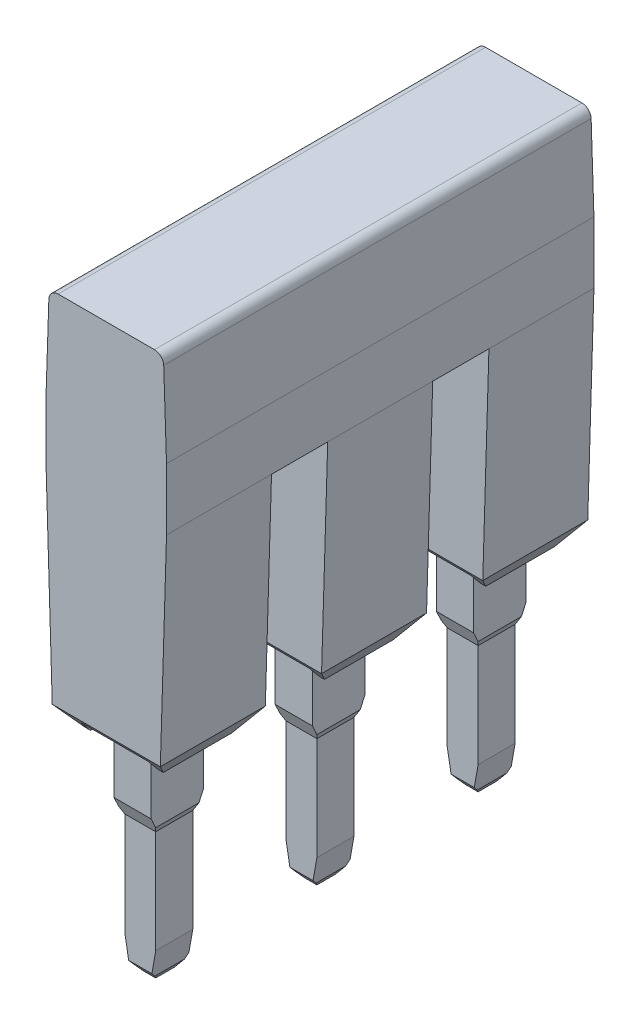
ISO-10303-21;
HEADER;
FILE_DESCRIPTION(('STEP AP214'),'2;1');
FILE_NAME('part.step','',(''),(''),'','','');
FILE_SCHEMA(('AUTOMOTIVE_DESIGN { 1 0 10303 214 1 1 1 1 }'));
ENDSEC;
DATA;
#1=APPLICATION_CONTEXT('core data for automotive mechanical design processes');
#2=APPLICATION_PROTOCOL_DEFINITION('international standard','automotive_design',2000,#1);
#3=PRODUCT_CONTEXT('',#1,'mechanical');
#4=PRODUCT('Part','Part','',(#3));
#5=PRODUCT_RELATED_PRODUCT_CATEGORY('part','',(#4));
#6=PRODUCT_DEFINITION_FORMATION('','',#4);
#7=PRODUCT_DEFINITION_CONTEXT('part definition',#1,'design');
#8=PRODUCT_DEFINITION('design','',#6,#7);
#9=PRODUCT_DEFINITION_SHAPE('','',#8);
#10=(LENGTH_UNIT() NAMED_UNIT(*) SI_UNIT(.MILLI.,.METRE.));
#11=(NAMED_UNIT(*) PLANE_ANGLE_UNIT() SI_UNIT($,.RADIAN.));
#12=(NAMED_UNIT(*) SI_UNIT($,.STERADIAN.) SOLID_ANGLE_UNIT());
#13=UNCERTAINTY_MEASURE_WITH_UNIT(LENGTH_MEASURE(1.E-05),#10,'distance_accuracy_value','');
#14=(GEOMETRIC_REPRESENTATION_CONTEXT(3) GLOBAL_UNCERTAINTY_ASSIGNED_CONTEXT((#13)) GLOBAL_UNIT_ASSIGNED_CONTEXT((#10,
#11,#12)) REPRESENTATION_CONTEXT('',''));
#15=CARTESIAN_POINT('',(0.,0.,0.));
#16=DIRECTION('',(0.,0.,1.));
#17=DIRECTION('',(1.,0.,0.));
#18=AXIS2_PLACEMENT_3D('',#15,#16,#17);
#19=CARTESIAN_POINT('',(0.6,0.,0.));
#20=DIRECTION('',(1.,0.,0.));
#21=DIRECTION('',(0.,0.,-1.));
#22=AXIS2_PLACEMENT_3D('',#19,#20,#21);
#23=PLANE('',#22);
#24=DIRECTION('',(0.,1.,0.));
#25=VECTOR('',#24,1.);
#26=CARTESIAN_POINT('',(0.6,4.9361267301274,0.85));
#27=LINE('',#26,#25);
#28=CARTESIAN_POINT('',(0.6,4.9361267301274,0.85));
#29=VERTEX_POINT('',#28);
#30=CARTESIAN_POINT('',(0.6,7.1,0.85));
#31=VERTEX_POINT('',#30);
#32=EDGE_CURVE('E9',#29,#31,#27,.T.);
#33=ORIENTED_EDGE('',*,*,#32,.T.);
#34=DIRECTION('',(0.,0.,-1.));
#35=VECTOR('',#34,1.);
#36=CARTESIAN_POINT('',(0.6,7.1,3.4));
#37=LINE('',#36,#35);
#38=CARTESIAN_POINT('',(0.6,7.1,2.55));
#39=VERTEX_POINT('',#38);
#40=EDGE_CURVE('E23',#39,#31,#37,.T.);
#41=ORIENTED_EDGE('',*,*,#40,.F.);
#42=DIRECTION('',(0.,-1.,0.));
#43=VECTOR('',#42,1.);
#44=CARTESIAN_POINT('',(0.6,10.,2.55));
#45=LINE('',#44,#43);
#46=CARTESIAN_POINT('',(0.6,4.9361267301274,2.55));
#47=VERTEX_POINT('',#46);
#48=EDGE_CURVE('E1784',#39,#47,#45,.T.);
#49=ORIENTED_EDGE('',*,*,#48,.T.);
#50=DIRECTION('',(0.,-0.906307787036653,-0.422618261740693));
#51=VECTOR('',#50,1.);
#52=CARTESIAN_POINT('',(0.6,4.9361267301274,2.55));
#53=LINE('',#52,#51);
#54=CARTESIAN_POINT('',(0.6,4.614450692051,2.4));
#55=VERTEX_POINT('',#54);
#56=EDGE_CURVE('E1780',#47,#55,#53,.T.);
#57=ORIENTED_EDGE('',*,*,#56,.T.);
#58=DIRECTION('',(0.,0.,-1.));
#59=VECTOR('',#58,1.);
#60=CARTESIAN_POINT('',(0.6,4.614450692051,13.84));
#61=LINE('',#60,#59);
#62=CARTESIAN_POINT('',(0.6,4.614450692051,0.999999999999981));
#63=VERTEX_POINT('',#62);
#64=EDGE_CURVE('E1776',#55,#63,#61,.T.);
#65=ORIENTED_EDGE('',*,*,#64,.T.);
#66=DIRECTION('',(0.,0.906307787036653,-0.422618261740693));
#67=VECTOR('',#66,1.);
#68=CARTESIAN_POINT('',(0.6,4.4,1.1));
#69=LINE('',#68,#67);
#70=EDGE_CURVE('E1772',#63,#29,#69,.T.);
#71=ORIENTED_EDGE('',*,*,#70,.T.);
#72=EDGE_LOOP('',(#33,#41,#49,#57,#65,#71));
#73=FACE_BOUND('',#72,.T.);
#74=ADVANCED_FACE('F15',(#73),#23,.T.);
#75=CARTESIAN_POINT('',(0.6,4.4,1.1));
#76=DIRECTION('',(0.,0.422618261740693,0.906307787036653));
#77=DIRECTION('',(0.,-0.906307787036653,0.422618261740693));
#78=AXIS2_PLACEMENT_3D('',#75,#76,#77);
#79=PLANE('',#78);
#80=DIRECTION('',(0.389281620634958,0.834817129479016,-0.389281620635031));
#81=VECTOR('',#80,1.);
#82=CARTESIAN_POINT('',(0.515154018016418,4.43249789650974,1.08484598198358));
#83=LINE('',#82,#81);
#84=CARTESIAN_POINT('',(0.5,4.4,1.1));
#85=VERTEX_POINT('',#84);
#86=EDGE_CURVE('E1767',#85,#63,#83,.T.);
#87=ORIENTED_EDGE('',*,*,#86,.F.);
#88=DIRECTION('',(-1.,0.,0.));
#89=VECTOR('',#88,1.);
#90=CARTESIAN_POINT('',(0.6,4.4,1.1));
#91=LINE('',#90,#89);
#92=CARTESIAN_POINT('',(-0.5,4.4,1.1));
#93=VERTEX_POINT('',#92);
#94=EDGE_CURVE('E1763',#85,#93,#91,.T.);
#95=ORIENTED_EDGE('',*,*,#94,.T.);
#96=DIRECTION('',(0.389281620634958,-0.834817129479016,0.389281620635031));
#97=VECTOR('',#96,1.);
#98=CARTESIAN_POINT('',(-0.333305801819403,4.04252313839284,1.26669419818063));
#99=LINE('',#98,#97);
#100=CARTESIAN_POINT('',(-0.6,4.614450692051,0.999999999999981));
#101=VERTEX_POINT('',#100);
#102=EDGE_CURVE('E1758',#101,#93,#99,.T.);
#103=ORIENTED_EDGE('',*,*,#102,.F.);
#104=DIRECTION('',(0.,0.906307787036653,-0.422618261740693));
#105=VECTOR('',#104,1.);
#106=CARTESIAN_POINT('',(-0.6,4.4,1.1));
#107=LINE('',#106,#105);
#108=CARTESIAN_POINT('',(-0.6,4.9361267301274,0.85));
#109=VERTEX_POINT('',#108);
#110=EDGE_CURVE('E1754',#101,#109,#107,.T.);
#111=ORIENTED_EDGE('',*,*,#110,.T.);
#112=DIRECTION('',(-1.,0.,0.));
#113=VECTOR('',#112,1.);
#114=CARTESIAN_POINT('',(0.6,4.9361267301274,0.85));
#115=LINE('',#114,#113);
#116=EDGE_CURVE('E1749',#29,#109,#115,.T.);
#117=ORIENTED_EDGE('',*,*,#116,.F.);
#118=ORIENTED_EDGE('',*,*,#70,.F.);
#119=EDGE_LOOP('',(#87,#95,#103,#111,#117,#118));
#120=FACE_BOUND('',#119,.T.);
#121=ADVANCED_FACE('F1813',(#120),#79,.F.);
#122=CARTESIAN_POINT('',(0.6,4.9361267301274,0.85));
#123=DIRECTION('',(0.,0.,1.));
#124=DIRECTION('',(1.,0.,0.));
#125=AXIS2_PLACEMENT_3D('',#122,#123,#124);
#126=PLANE('',#125);
#127=DIRECTION('',(0.,1.,0.));
#128=VECTOR('',#127,1.);
#129=CARTESIAN_POINT('',(-0.6,4.9361267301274,0.85));
#130=LINE('',#129,#128);
#131=CARTESIAN_POINT('',(-0.6,7.1,0.85));
#132=VERTEX_POINT('',#131);
#133=EDGE_CURVE('E1745',#109,#132,#130,.T.);
#134=ORIENTED_EDGE('',*,*,#133,.T.);
#135=DIRECTION('',(1.,0.,0.));
#136=VECTOR('',#135,1.);
#137=CARTESIAN_POINT('',(-1.1,7.1,0.85));
#138=LINE('',#137,#136);
#139=EDGE_CURVE('E1741',#132,#31,#138,.T.);
#140=ORIENTED_EDGE('',*,*,#139,.T.);
#141=ORIENTED_EDGE('',*,*,#32,.F.);
#142=ORIENTED_EDGE('',*,*,#116,.T.);
#143=EDGE_LOOP('',(#134,#140,#141,#142));
#144=FACE_BOUND('',#143,.T.);
#145=ADVANCED_FACE('F1817',(#144),#126,.F.);
#146=CARTESIAN_POINT('',(-1.1,7.1,3.4));
#147=DIRECTION('',(0.,1.,0.));
#148=DIRECTION('',(0.,0.,1.));
#149=AXIS2_PLACEMENT_3D('',#146,#147,#148);
#150=PLANE('',#149);
#151=DIRECTION('',(-1.,0.,0.));
#152=VECTOR('',#151,1.);
#153=CARTESIAN_POINT('',(-1.1,7.1,2.55));
#154=LINE('',#153,#152);
#155=CARTESIAN_POINT('',(-0.6,7.1,2.55));
#156=VERTEX_POINT('',#155);
#157=EDGE_CURVE('E1736',#39,#156,#154,.T.);
#158=ORIENTED_EDGE('',*,*,#157,.F.);
#159=ORIENTED_EDGE('',*,*,#40,.T.);
#160=ORIENTED_EDGE('',*,*,#139,.F.);
#161=DIRECTION('',(0.,0.,-1.));
#162=VECTOR('',#161,1.);
#163=CARTESIAN_POINT('',(-0.6,7.1,3.4));
#164=LINE('',#163,#162);
#165=EDGE_CURVE('E1731',#156,#132,#164,.T.);
#166=ORIENTED_EDGE('',*,*,#165,.F.);
#167=EDGE_LOOP('',(#158,#159,#160,#166));
#168=FACE_BOUND('',#167,.T.);
#169=DIRECTION('',(-1.,0.,0.));
#170=VECTOR('',#169,1.);
#171=CARTESIAN_POINT('',(-1.1,7.1,0.251729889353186));
#172=LINE('',#171,#170);
#173=CARTESIAN_POINT('',(1.1,7.1,0.251729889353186));
#174=VERTEX_POINT('',#173);
#175=CARTESIAN_POINT('',(-1.1,7.1,0.251729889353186));
#176=VERTEX_POINT('',#175);
#177=EDGE_CURVE('E1726',#174,#176,#172,.T.);
#178=ORIENTED_EDGE('',*,*,#177,.F.);
#179=DIRECTION('',(0.,0.,-1.));
#180=VECTOR('',#179,1.);
#181=CARTESIAN_POINT('',(1.1,7.1,3.4));
#182=LINE('',#181,#180);
#183=CARTESIAN_POINT('',(1.1,7.1,3.14827011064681));
#184=VERTEX_POINT('',#183);
#185=EDGE_CURVE('E1721',#184,#174,#182,.T.);
#186=ORIENTED_EDGE('',*,*,#185,.F.);
#187=DIRECTION('',(1.,0.,0.));
#188=VECTOR('',#187,1.);
#189=CARTESIAN_POINT('',(-1.1,7.1,3.14827011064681));
#190=LINE('',#189,#188);
#191=CARTESIAN_POINT('',(-1.1,7.1,3.14827011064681));
#192=VERTEX_POINT('',#191);
#193=EDGE_CURVE('E1716',#192,#184,#190,.T.);
#194=ORIENTED_EDGE('',*,*,#193,.F.);
#195=DIRECTION('',(0.,0.,-1.));
#196=VECTOR('',#195,1.);
#197=CARTESIAN_POINT('',(-1.1,7.1,3.4));
#198=LINE('',#197,#196);
#199=EDGE_CURVE('E1712',#192,#176,#198,.T.);
#200=ORIENTED_EDGE('',*,*,#199,.T.);
#201=EDGE_LOOP('',(#178,#186,#194,#200));
#202=FACE_BOUND('',#201,.T.);
#203=ADVANCED_FACE('F1794',(#168,#202),#150,.F.);
#204=CARTESIAN_POINT('',(-1.1,6.7,3.4));
#205=DIRECTION('',(-1.,0.,0.));
#206=DIRECTION('',(0.,0.,1.));
#207=AXIS2_PLACEMENT_3D('',#204,#205,#206);
#208=PLANE('',#207);
#209=DIRECTION('',(0.,-0.766044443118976,0.642787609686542));
#210=VECTOR('',#209,1.);
#211=CARTESIAN_POINT('',(-1.1,5.31504995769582,1.7494808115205));
#212=LINE('',#211,#210);
#213=CARTESIAN_POINT('',(-1.1,6.7,0.5873697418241));
#214=VERTEX_POINT('',#213);
#215=EDGE_CURVE('E1707',#176,#214,#212,.T.);
#216=ORIENTED_EDGE('',*,*,#215,.F.);
#217=ORIENTED_EDGE('',*,*,#199,.F.);
#218=DIRECTION('',(0.,0.766044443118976,0.642787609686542));
#219=VECTOR('',#218,1.);
#220=CARTESIAN_POINT('',(-1.1,6.98922313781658,3.05531728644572));
#221=LINE('',#220,#219);
#222=CARTESIAN_POINT('',(-1.1,6.7,2.8126302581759));
#223=VERTEX_POINT('',#222);
#224=EDGE_CURVE('E1702',#223,#192,#221,.T.);
#225=ORIENTED_EDGE('',*,*,#224,.F.);
#226=DIRECTION('',(0.,0.,-1.));
#227=VECTOR('',#226,1.);
#228=CARTESIAN_POINT('',(-1.1,6.7,3.4));
#229=LINE('',#228,#227);
#230=EDGE_CURVE('E1698',#223,#214,#229,.T.);
#231=ORIENTED_EDGE('',*,*,#230,.T.);
#232=EDGE_LOOP('',(#216,#217,#225,#231));
#233=FACE_BOUND('',#232,.T.);
#234=ADVANCED_FACE('F1870',(#233),#208,.F.);
#235=CARTESIAN_POINT('',(-1.2598547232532,6.7,3.4));
#236=DIRECTION('',(0.,1.,0.));
#237=DIRECTION('',(0.,0.,1.));
#238=AXIS2_PLACEMENT_3D('',#235,#236,#237);
#239=PLANE('',#238);
#240=DIRECTION('',(-1.,0.,0.));
#241=VECTOR('',#240,1.);
#242=CARTESIAN_POINT('',(2.,6.7,0.5873697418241));
#243=LINE('',#242,#241);
#244=CARTESIAN_POINT('',(-1.2598547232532,6.7,0.5873697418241));
#245=VERTEX_POINT('',#244);
#246=EDGE_CURVE('E1693',#214,#245,#243,.T.);
#247=ORIENTED_EDGE('',*,*,#246,.F.);
#248=ORIENTED_EDGE('',*,*,#230,.F.);
#249=DIRECTION('',(-1.,0.,0.));
#250=VECTOR('',#249,1.);
#251=CARTESIAN_POINT('',(2.,6.7,2.8126302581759));
#252=LINE('',#251,#250);
#253=CARTESIAN_POINT('',(-1.2598547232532,6.7,2.8126302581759));
#254=VERTEX_POINT('',#253);
#255=EDGE_CURVE('E1689',#223,#254,#252,.T.);
#256=ORIENTED_EDGE('',*,*,#255,.T.);
#257=DIRECTION('',(0.,0.,-1.));
#258=VECTOR('',#257,1.);
#259=CARTESIAN_POINT('',(-1.2598547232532,6.7,3.4));
#260=LINE('',#259,#258);
#261=EDGE_CURVE('E1685',#254,#245,#260,.T.);
#262=ORIENTED_EDGE('',*,*,#261,.T.);
#263=EDGE_LOOP('',(#247,#248,#256,#262));
#264=FACE_BOUND('',#263,.T.);
#265=ADVANCED_FACE('F1873',(#264),#239,.F.);
#266=CARTESIAN_POINT('',(-1.75,7.4,3.4));
#267=DIRECTION('',(0.81915204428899,0.573576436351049,0.));
#268=DIRECTION('',(-0.573576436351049,0.81915204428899,0.));
#269=AXIS2_PLACEMENT_3D('',#266,#267,#268);
#270=PLANE('',#269);
#271=DIRECTION('',(-0.472684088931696,0.67506283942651,-0.566444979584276));
#272=VECTOR('',#271,1.);
#273=CARTESIAN_POINT('',(-0.83965160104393,6.09988774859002,1.09092371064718));
#274=LINE('',#273,#272);
#275=CARTESIAN_POINT('',(-1.75,7.4,0.));
#276=VERTEX_POINT('',#275);
#277=EDGE_CURVE('E1680',#245,#276,#274,.T.);
#278=ORIENTED_EDGE('',*,*,#277,.F.);
#279=ORIENTED_EDGE('',*,*,#261,.F.);
#280=DIRECTION('',(0.472684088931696,-0.67506283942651,-0.566444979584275));
#281=VECTOR('',#280,1.);
#282=CARTESIAN_POINT('',(-1.75,7.4,3.4));
#283=LINE('',#282,#281);
#284=CARTESIAN_POINT('',(-1.75,7.4,3.4));
#285=VERTEX_POINT('',#284);
#286=EDGE_CURVE('E1675',#285,#254,#283,.T.);
#287=ORIENTED_EDGE('',*,*,#286,.F.);
#288=DIRECTION('',(0.,0.,-1.));
#289=VECTOR('',#288,1.);
#290=CARTESIAN_POINT('',(-1.75,7.4,3.4));
#291=LINE('',#290,#289);
#292=EDGE_CURVE('E1671',#285,#276,#291,.T.);
#293=ORIENTED_EDGE('',*,*,#292,.T.);
#294=EDGE_LOOP('',(#278,#279,#287,#293));
#295=FACE_BOUND('',#294,.T.);
#296=ADVANCED_FACE('F1877',(#295),#270,.F.);
#297=CARTESIAN_POINT('',(-1.95,14.,3.4));
#298=DIRECTION('',(0.999541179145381,0.0302891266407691,0.));
#299=DIRECTION('',(-0.0302891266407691,0.999541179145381,0.));
#300=AXIS2_PLACEMENT_3D('',#297,#298,#299);
#301=PLANE('',#300);
#302=DIRECTION('',(0.0302891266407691,-0.999541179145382,0.));
#303=VECTOR('',#302,1.);
#304=CARTESIAN_POINT('',(-1.95,14.,0.));
#305=LINE('',#304,#303);
#306=CARTESIAN_POINT('',(-1.95,14.,0.));
#307=VERTEX_POINT('',#306);
#308=EDGE_CURVE('E1666',#307,#276,#305,.T.);
#309=ORIENTED_EDGE('',*,*,#308,.T.);
#310=ORIENTED_EDGE('',*,*,#292,.F.);
#311=DIRECTION('',(0.0302891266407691,-0.999541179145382,0.));
#312=VECTOR('',#311,1.);
#313=CARTESIAN_POINT('',(-1.95,14.,3.4));
#314=LINE('',#313,#312);
#315=CARTESIAN_POINT('',(-1.95,14.,3.4));
#316=VERTEX_POINT('',#315);
#317=EDGE_CURVE('E1661',#316,#285,#314,.T.);
#318=ORIENTED_EDGE('',*,*,#317,.F.);
#319=DIRECTION('',(0.,0.,-1.));
#320=VECTOR('',#319,1.);
#321=CARTESIAN_POINT('',(-1.95,14.,3.4));
#322=LINE('',#321,#320);
#323=EDGE_CURVE('E1657',#316,#307,#322,.T.);
#324=ORIENTED_EDGE('',*,*,#323,.T.);
#325=EDGE_LOOP('',(#309,#310,#318,#324));
#326=FACE_BOUND('',#325,.T.);
#327=ADVANCED_FACE('F1881',(#326),#301,.F.);
#328=CARTESIAN_POINT('',(-1.95,16.,13.84));
#329=DIRECTION('',(1.,0.,0.));
#330=DIRECTION('',(0.,0.,-1.));
#331=AXIS2_PLACEMENT_3D('',#328,#329,#330);
#332=PLANE('',#331);
#333=DIRECTION('',(0.,-1.,0.));
#334=VECTOR('',#333,1.);
#335=CARTESIAN_POINT('',(-1.95,16.,0.));
#336=LINE('',#335,#334);
#337=CARTESIAN_POINT('',(-1.95,16.,0.));
#338=VERTEX_POINT('',#337);
#339=EDGE_CURVE('E1652',#338,#307,#336,.T.);
#340=ORIENTED_EDGE('',*,*,#339,.T.);
#341=ORIENTED_EDGE('',*,*,#323,.F.);
#342=DIRECTION('',(0.,0.,-1.));
#343=VECTOR('',#342,1.);
#344=CARTESIAN_POINT('',(-1.95,14.,13.84));
#345=LINE('',#344,#343);
#346=CARTESIAN_POINT('',(-1.95,14.,5.22));
#347=VERTEX_POINT('',#346);
#348=EDGE_CURVE('E1647',#347,#316,#345,.T.);
#349=ORIENTED_EDGE('',*,*,#348,.F.);
#350=DIRECTION('',(0.,0.,-1.));
#351=VECTOR('',#350,1.);
#352=CARTESIAN_POINT('',(-1.95,14.,8.62));
#353=LINE('',#352,#351);
#354=CARTESIAN_POINT('',(-1.95,14.,8.62));
#355=VERTEX_POINT('',#354);
#356=EDGE_CURVE('E1642',#355,#347,#353,.T.);
#357=ORIENTED_EDGE('',*,*,#356,.F.);
#358=DIRECTION('',(0.,0.,-1.));
#359=VECTOR('',#358,1.);
#360=CARTESIAN_POINT('',(-1.95,14.,13.84));
#361=LINE('',#360,#359);
#362=CARTESIAN_POINT('',(-1.95,14.,10.44));
#363=VERTEX_POINT('',#362);
#364=EDGE_CURVE('E1637',#363,#355,#361,.T.);
#365=ORIENTED_EDGE('',*,*,#364,.F.);
#366=DIRECTION('',(0.,0.,-1.));
#367=VECTOR('',#366,1.);
#368=CARTESIAN_POINT('',(-1.95,14.,13.84));
#369=LINE('',#368,#367);
#370=CARTESIAN_POINT('',(-1.95,14.,13.84));
#371=VERTEX_POINT('',#370);
#372=EDGE_CURVE('E1632',#371,#363,#369,.T.);
#373=ORIENTED_EDGE('',*,*,#372,.F.);
#374=DIRECTION('',(0.,-1.,0.));
#375=VECTOR('',#374,1.);
#376=CARTESIAN_POINT('',(-1.95,16.,13.84));
#377=LINE('',#376,#375);
#378=CARTESIAN_POINT('',(-1.95,16.,13.84));
#379=VERTEX_POINT('',#378);
#380=EDGE_CURVE('E1627',#379,#371,#377,.T.);
#381=ORIENTED_EDGE('',*,*,#380,.F.);
#382=DIRECTION('',(0.,0.,-1.));
#383=VECTOR('',#382,1.);
#384=CARTESIAN_POINT('',(-1.95,16.,13.84));
#385=LINE('',#384,#383);
#386=EDGE_CURVE('E1623',#379,#338,#385,.T.);
#387=ORIENTED_EDGE('',*,*,#386,.T.);
#388=EDGE_LOOP('',(#340,#341,#349,#357,#365,#373,#381,#387));
#389=FACE_BOUND('',#388,.T.);
#390=ADVANCED_FACE('F1885',(#389),#332,.F.);
#391=CARTESIAN_POINT('',(-1.8596668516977,18.70999444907,13.84));
#392=DIRECTION('',(0.999444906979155,-0.0333148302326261,0.));
#393=DIRECTION('',(0.0333148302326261,0.999444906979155,0.));
#394=AXIS2_PLACEMENT_3D('',#391,#392,#393);
#395=PLANE('',#394);
#396=DIRECTION('',(-0.0333148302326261,-0.999444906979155,0.));
#397=VECTOR('',#396,1.);
#398=CARTESIAN_POINT('',(-1.8596668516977,18.70999444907,0.));
#399=LINE('',#398,#397);
#400=CARTESIAN_POINT('',(-1.8596668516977,18.70999444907,0.));
#401=VERTEX_POINT('',#400);
#402=EDGE_CURVE('E1618',#401,#338,#399,.T.);
#403=ORIENTED_EDGE('',*,*,#402,.T.);
#404=ORIENTED_EDGE('',*,*,#386,.F.);
#405=DIRECTION('',(-0.0333148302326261,-0.999444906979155,0.));
#406=VECTOR('',#405,1.);
#407=CARTESIAN_POINT('',(-1.8596668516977,18.70999444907,13.84));
#408=LINE('',#407,#406);
#409=CARTESIAN_POINT('',(-1.8596668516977,18.70999444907,13.84));
#410=VERTEX_POINT('',#409);
#411=EDGE_CURVE('E1613',#410,#379,#408,.T.);
#412=ORIENTED_EDGE('',*,*,#411,.F.);
#413=DIRECTION('',(0.,0.,-1.));
#414=VECTOR('',#413,1.);
#415=CARTESIAN_POINT('',(-1.8596668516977,18.70999444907,13.84));
#416=LINE('',#415,#414);
#417=EDGE_CURVE('E1609',#410,#401,#416,.T.);
#418=ORIENTED_EDGE('',*,*,#417,.T.);
#419=EDGE_LOOP('',(#403,#404,#412,#418));
#420=FACE_BOUND('',#419,.T.);
#421=ADVANCED_FACE('F1889',(#420),#395,.F.);
#422=CARTESIAN_POINT('',(-1.55983337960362,18.6999999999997,13.84));
#423=DIRECTION('',(0.,0.,-1.));
#424=DIRECTION('',(0.695228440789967,-0.718788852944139,0.));
#425=AXIS2_PLACEMENT_3D('',#422,#423,#424);
#426=CYLINDRICAL_SURFACE('',#425,0.300000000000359);
#427=CARTESIAN_POINT('',(-1.55983337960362,18.6999999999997,0.));
#428=DIRECTION('',(0.,0.,1.));
#429=DIRECTION('',(1.,0.,0.));
#430=AXIS2_PLACEMENT_3D('',#427,#428,#429);
#431=CIRCLE('',#430,0.300000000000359);
#432=CARTESIAN_POINT('',(-1.5598333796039,19.,0.));
#433=VERTEX_POINT('',#432);
#434=EDGE_CURVE('E1604',#433,#401,#431,.T.);
#435=ORIENTED_EDGE('',*,*,#434,.T.);
#436=ORIENTED_EDGE('',*,*,#417,.F.);
#437=CARTESIAN_POINT('',(-1.55983337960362,18.6999999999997,13.84));
#438=DIRECTION('',(0.,0.,1.));
#439=DIRECTION('',(1.,0.,0.));
#440=AXIS2_PLACEMENT_3D('',#437,#438,#439);
#441=CIRCLE('',#440,0.300000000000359);
#442=CARTESIAN_POINT('',(-1.5598333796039,19.,13.84));
#443=VERTEX_POINT('',#442);
#444=EDGE_CURVE('E1599',#443,#410,#441,.T.);
#445=ORIENTED_EDGE('',*,*,#444,.F.);
#446=DIRECTION('',(0.,0.,-1.));
#447=VECTOR('',#446,1.);
#448=CARTESIAN_POINT('',(-1.5598333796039,19.,13.84));
#449=LINE('',#448,#447);
#450=EDGE_CURVE('E1595',#443,#433,#449,.T.);
#451=ORIENTED_EDGE('',*,*,#450,.T.);
#452=EDGE_LOOP('',(#435,#436,#445,#451));
#453=FACE_BOUND('',#452,.T.);
#454=ADVANCED_FACE('F1893',(#453),#426,.T.);
#455=CARTESIAN_POINT('',(1.5598333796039,19.,13.84));
#456=DIRECTION('',(0.,-1.,0.));
#457=DIRECTION('',(0.,0.,-1.));
#458=AXIS2_PLACEMENT_3D('',#455,#456,#457);
#459=PLANE('',#458);
#460=DIRECTION('',(-1.,0.,0.));
#461=VECTOR('',#460,1.);
#462=CARTESIAN_POINT('',(1.5598333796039,19.,0.));
#463=LINE('',#462,#461);
#464=CARTESIAN_POINT('',(1.5598333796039,19.,0.));
#465=VERTEX_POINT('',#464);
#466=EDGE_CURVE('E1590',#465,#433,#463,.T.);
#467=ORIENTED_EDGE('',*,*,#466,.T.);
#468=ORIENTED_EDGE('',*,*,#450,.F.);
#469=DIRECTION('',(-1.,0.,0.));
#470=VECTOR('',#469,1.);
#471=CARTESIAN_POINT('',(1.5598333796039,19.,13.84));
#472=LINE('',#471,#470);
#473=CARTESIAN_POINT('',(1.5598333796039,19.,13.84));
#474=VERTEX_POINT('',#473);
#475=EDGE_CURVE('E1585',#474,#443,#472,.T.);
#476=ORIENTED_EDGE('',*,*,#475,.F.);
#477=DIRECTION('',(0.,0.,-1.));
#478=VECTOR('',#477,1.);
#479=CARTESIAN_POINT('',(1.5598333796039,19.,13.84));
#480=LINE('',#479,#478);
#481=EDGE_CURVE('E1581',#474,#465,#480,.T.);
#482=ORIENTED_EDGE('',*,*,#481,.T.);
#483=EDGE_LOOP('',(#467,#468,#476,#482));
#484=FACE_BOUND('',#483,.T.);
#485=ADVANCED_FACE('F1897',(#484),#459,.F.);
#486=CARTESIAN_POINT('',(1.55983337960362,18.6999999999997,13.84));
#487=DIRECTION('',(0.,0.,-1.));
#488=DIRECTION('',(-0.695228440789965,-0.718788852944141,0.));
#489=AXIS2_PLACEMENT_3D('',#486,#487,#488);
#490=CYLINDRICAL_SURFACE('',#489,0.300000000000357);
#491=CARTESIAN_POINT('',(1.55983337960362,18.6999999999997,0.));
#492=DIRECTION('',(0.,0.,1.));
#493=DIRECTION('',(1.,0.,0.));
#494=AXIS2_PLACEMENT_3D('',#491,#492,#493);
#495=CIRCLE('',#494,0.300000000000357);
#496=CARTESIAN_POINT('',(1.8596668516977,18.70999444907,0.));
#497=VERTEX_POINT('',#496);
#498=EDGE_CURVE('E1576',#497,#465,#495,.T.);
#499=ORIENTED_EDGE('',*,*,#498,.T.);
#500=ORIENTED_EDGE('',*,*,#481,.F.);
#501=CARTESIAN_POINT('',(1.55983337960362,18.6999999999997,13.84));
#502=DIRECTION('',(0.,0.,1.));
#503=DIRECTION('',(1.,0.,0.));
#504=AXIS2_PLACEMENT_3D('',#501,#502,#503);
#505=CIRCLE('',#504,0.300000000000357);
#506=CARTESIAN_POINT('',(1.8596668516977,18.70999444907,13.84));
#507=VERTEX_POINT('',#506);
#508=EDGE_CURVE('E1571',#507,#474,#505,.T.);
#509=ORIENTED_EDGE('',*,*,#508,.F.);
#510=DIRECTION('',(0.,0.,-1.));
#511=VECTOR('',#510,1.);
#512=CARTESIAN_POINT('',(1.8596668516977,18.70999444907,13.84));
#513=LINE('',#512,#511);
#514=EDGE_CURVE('E1567',#507,#497,#513,.T.);
#515=ORIENTED_EDGE('',*,*,#514,.T.);
#516=EDGE_LOOP('',(#499,#500,#509,#515));
#517=FACE_BOUND('',#516,.T.);
#518=ADVANCED_FACE('F1901',(#517),#490,.T.);
#519=CARTESIAN_POINT('',(1.95,16.,13.84));
#520=DIRECTION('',(-0.999444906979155,-0.0333148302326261,0.));
#521=DIRECTION('',(0.0333148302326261,-0.999444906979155,0.));
#522=AXIS2_PLACEMENT_3D('',#519,#520,#521);
#523=PLANE('',#522);
#524=DIRECTION('',(-0.0333148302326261,0.999444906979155,0.));
#525=VECTOR('',#524,1.);
#526=CARTESIAN_POINT('',(1.95,16.,0.));
#527=LINE('',#526,#525);
#528=CARTESIAN_POINT('',(1.95,16.,0.));
#529=VERTEX_POINT('',#528);
#530=EDGE_CURVE('E1562',#529,#497,#527,.T.);
#531=ORIENTED_EDGE('',*,*,#530,.T.);
#532=ORIENTED_EDGE('',*,*,#514,.F.);
#533=DIRECTION('',(-0.0333148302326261,0.999444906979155,0.));
#534=VECTOR('',#533,1.);
#535=CARTESIAN_POINT('',(1.95,16.,13.84));
#536=LINE('',#535,#534);
#537=CARTESIAN_POINT('',(1.95,16.,13.84));
#538=VERTEX_POINT('',#537);
#539=EDGE_CURVE('E1557',#538,#507,#536,.T.);
#540=ORIENTED_EDGE('',*,*,#539,.F.);
#541=DIRECTION('',(0.,0.,-1.));
#542=VECTOR('',#541,1.);
#543=CARTESIAN_POINT('',(1.95,16.,13.84));
#544=LINE('',#543,#542);
#545=EDGE_CURVE('E1553',#538,#529,#544,.T.);
#546=ORIENTED_EDGE('',*,*,#545,.T.);
#547=EDGE_LOOP('',(#531,#532,#540,#546));
#548=FACE_BOUND('',#547,.T.);
#549=ADVANCED_FACE('F1905',(#548),#523,.F.);
#550=CARTESIAN_POINT('',(1.95,14.,13.84));
#551=DIRECTION('',(-1.,0.,0.));
#552=DIRECTION('',(0.,0.,1.));
#553=AXIS2_PLACEMENT_3D('',#550,#551,#552);
#554=PLANE('',#553);
#555=DIRECTION('',(0.,1.,0.));
#556=VECTOR('',#555,1.);
#557=CARTESIAN_POINT('',(1.95,14.,0.));
#558=LINE('',#557,#556);
#559=CARTESIAN_POINT('',(1.95,14.,0.));
#560=VERTEX_POINT('',#559);
#561=EDGE_CURVE('E1548',#560,#529,#558,.T.);
#562=ORIENTED_EDGE('',*,*,#561,.T.);
#563=ORIENTED_EDGE('',*,*,#545,.F.);
#564=DIRECTION('',(0.,1.,0.));
#565=VECTOR('',#564,1.);
#566=CARTESIAN_POINT('',(1.95,14.,13.84));
#567=LINE('',#566,#565);
#568=CARTESIAN_POINT('',(1.95,14.,13.84));
#569=VERTEX_POINT('',#568);
#570=EDGE_CURVE('E1543',#569,#538,#567,.T.);
#571=ORIENTED_EDGE('',*,*,#570,.F.);
#572=DIRECTION('',(0.,0.,-1.));
#573=VECTOR('',#572,1.);
#574=CARTESIAN_POINT('',(1.95,14.,13.84));
#575=LINE('',#574,#573);
#576=CARTESIAN_POINT('',(1.95,14.,10.44));
#577=VERTEX_POINT('',#576);
#578=EDGE_CURVE('E1539',#569,#577,#575,.T.);
#579=ORIENTED_EDGE('',*,*,#578,.T.);
#580=DIRECTION('',(0.,0.,-1.));
#581=VECTOR('',#580,1.);
#582=CARTESIAN_POINT('',(1.95,14.,13.84));
#583=LINE('',#582,#581);
#584=CARTESIAN_POINT('',(1.95,14.,8.62));
#585=VERTEX_POINT('',#584);
#586=EDGE_CURVE('E1535',#577,#585,#583,.T.);
#587=ORIENTED_EDGE('',*,*,#586,.T.);
#588=DIRECTION('',(0.,0.,-1.));
#589=VECTOR('',#588,1.);
#590=CARTESIAN_POINT('',(1.95,14.,8.62));
#591=LINE('',#590,#589);
#592=CARTESIAN_POINT('',(1.95,14.,5.22));
#593=VERTEX_POINT('',#592);
#594=EDGE_CURVE('E1531',#585,#593,#591,.T.);
#595=ORIENTED_EDGE('',*,*,#594,.T.);
#596=DIRECTION('',(0.,0.,-1.));
#597=VECTOR('',#596,1.);
#598=CARTESIAN_POINT('',(1.95,14.,13.84));
#599=LINE('',#598,#597);
#600=CARTESIAN_POINT('',(1.95,14.,3.4));
#601=VERTEX_POINT('',#600);
#602=EDGE_CURVE('E1527',#593,#601,#599,.T.);
#603=ORIENTED_EDGE('',*,*,#602,.T.);
#604=DIRECTION('',(0.,0.,-1.));
#605=VECTOR('',#604,1.);
#606=CARTESIAN_POINT('',(1.95,14.,3.4));
#607=LINE('',#606,#605);
#608=EDGE_CURVE('E1523',#601,#560,#607,.T.);
#609=ORIENTED_EDGE('',*,*,#608,.T.);
#610=EDGE_LOOP('',(#562,#563,#571,#579,#587,#595,#603,#609));
#611=FACE_BOUND('',#610,.T.);
#612=ADVANCED_FACE('F1909',(#611),#554,.F.);
#613=CARTESIAN_POINT('',(1.75,7.4,3.4));
#614=DIRECTION('',(-0.999541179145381,0.0302891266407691,0.));
#615=DIRECTION('',(-0.0302891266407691,-0.999541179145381,0.));
#616=AXIS2_PLACEMENT_3D('',#613,#614,#615);
#617=PLANE('',#616);
#618=DIRECTION('',(0.0302891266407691,0.999541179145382,0.));
#619=VECTOR('',#618,1.);
#620=CARTESIAN_POINT('',(1.75,7.4,0.));
#621=LINE('',#620,#619);
#622=CARTESIAN_POINT('',(1.75,7.4,0.));
#623=VERTEX_POINT('',#622);
#624=EDGE_CURVE('E1518',#623,#560,#621,.T.);
#625=ORIENTED_EDGE('',*,*,#624,.T.);
#626=ORIENTED_EDGE('',*,*,#608,.F.);
#627=DIRECTION('',(0.0302891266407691,0.999541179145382,0.));
#628=VECTOR('',#627,1.);
#629=CARTESIAN_POINT('',(1.75,7.4,3.4));
#630=LINE('',#629,#628);
#631=CARTESIAN_POINT('',(1.75,7.4,3.4));
#632=VERTEX_POINT('',#631);
#633=EDGE_CURVE('E1513',#632,#601,#630,.T.);
#634=ORIENTED_EDGE('',*,*,#633,.F.);
#635=DIRECTION('',(0.,0.,-1.));
#636=VECTOR('',#635,1.);
#637=CARTESIAN_POINT('',(1.75,7.4,3.4));
#638=LINE('',#637,#636);
#639=EDGE_CURVE('E1509',#632,#623,#638,.T.);
#640=ORIENTED_EDGE('',*,*,#639,.T.);
#641=EDGE_LOOP('',(#625,#626,#634,#640));
#642=FACE_BOUND('',#641,.T.);
#643=ADVANCED_FACE('F1913',(#642),#617,.F.);
#644=CARTESIAN_POINT('',(1.2598547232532,6.7,3.4));
#645=DIRECTION('',(-0.81915204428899,0.573576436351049,0.));
#646=DIRECTION('',(-0.573576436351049,-0.81915204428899,0.));
#647=AXIS2_PLACEMENT_3D('',#644,#645,#646);
#648=PLANE('',#647);
#649=DIRECTION('',(-0.472684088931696,-0.67506283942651,0.566444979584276));
#650=VECTOR('',#649,1.);
#651=CARTESIAN_POINT('',(0.506774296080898,5.62448968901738,1.48983004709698));
#652=LINE('',#651,#650);
#653=CARTESIAN_POINT('',(1.2598547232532,6.7,0.5873697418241));
#654=VERTEX_POINT('',#653);
#655=EDGE_CURVE('E1504',#623,#654,#652,.T.);
#656=ORIENTED_EDGE('',*,*,#655,.F.);
#657=ORIENTED_EDGE('',*,*,#639,.F.);
#658=DIRECTION('',(0.472684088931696,0.67506283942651,0.566444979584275));
#659=VECTOR('',#658,1.);
#660=CARTESIAN_POINT('',(1.41712269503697,6.92460194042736,3.0010936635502));
#661=LINE('',#660,#659);
#662=CARTESIAN_POINT('',(1.2598547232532,6.7,2.8126302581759));
#663=VERTEX_POINT('',#662);
#664=EDGE_CURVE('E1499',#663,#632,#661,.T.);
#665=ORIENTED_EDGE('',*,*,#664,.F.);
#666=DIRECTION('',(0.,0.,-1.));
#667=VECTOR('',#666,1.);
#668=CARTESIAN_POINT('',(1.2598547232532,6.7,3.4));
#669=LINE('',#668,#667);
#670=EDGE_CURVE('E1495',#663,#654,#669,.T.);
#671=ORIENTED_EDGE('',*,*,#670,.T.);
#672=EDGE_LOOP('',(#656,#657,#665,#671));
#673=FACE_BOUND('',#672,.T.);
#674=ADVANCED_FACE('F1917',(#673),#648,.F.);
#675=CARTESIAN_POINT('',(1.1,6.7,3.4));
#676=DIRECTION('',(0.,1.,0.));
#677=DIRECTION('',(0.,0.,1.));
#678=AXIS2_PLACEMENT_3D('',#675,#676,#677);
#679=PLANE('',#678);
#680=DIRECTION('',(-1.,0.,0.));
#681=VECTOR('',#680,1.);
#682=CARTESIAN_POINT('',(2.,6.7,0.5873697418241));
#683=LINE('',#682,#681);
#684=CARTESIAN_POINT('',(1.1,6.7,0.5873697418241));
#685=VERTEX_POINT('',#684);
#686=EDGE_CURVE('E1490',#654,#685,#683,.T.);
#687=ORIENTED_EDGE('',*,*,#686,.F.);
#688=ORIENTED_EDGE('',*,*,#670,.F.);
#689=DIRECTION('',(-1.,0.,0.));
#690=VECTOR('',#689,1.);
#691=CARTESIAN_POINT('',(2.,6.7,2.8126302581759));
#692=LINE('',#691,#690);
#693=CARTESIAN_POINT('',(1.1,6.7,2.8126302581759));
#694=VERTEX_POINT('',#693);
#695=EDGE_CURVE('E1486',#663,#694,#692,.T.);
#696=ORIENTED_EDGE('',*,*,#695,.T.);
#697=DIRECTION('',(0.,0.,-1.));
#698=VECTOR('',#697,1.);
#699=CARTESIAN_POINT('',(1.1,6.7,3.4));
#700=LINE('',#699,#698);
#701=EDGE_CURVE('E1482',#694,#685,#700,.T.);
#702=ORIENTED_EDGE('',*,*,#701,.T.);
#703=EDGE_LOOP('',(#687,#688,#696,#702));
#704=FACE_BOUND('',#703,.T.);
#705=ADVANCED_FACE('F1921',(#704),#679,.F.);
#706=CARTESIAN_POINT('',(1.1,7.1,3.4));
#707=DIRECTION('',(1.,0.,0.));
#708=DIRECTION('',(0.,0.,-1.));
#709=AXIS2_PLACEMENT_3D('',#706,#707,#708);
#710=PLANE('',#709);
#711=DIRECTION('',(0.,0.766044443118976,-0.642787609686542));
#712=VECTOR('',#711,1.);
#713=CARTESIAN_POINT('',(1.1,5.54977959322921,1.55251926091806));
#714=LINE('',#713,#712);
#715=EDGE_CURVE('E1477',#685,#174,#714,.T.);
#716=ORIENTED_EDGE('',*,*,#715,.F.);
#717=ORIENTED_EDGE('',*,*,#701,.F.);
#718=DIRECTION('',(0.,-0.766044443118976,-0.642787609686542));
#719=VECTOR('',#718,1.);
#720=CARTESIAN_POINT('',(1.1,7.22395277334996,3.25227883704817));
#721=LINE('',#720,#719);
#722=EDGE_CURVE('E1472',#184,#694,#721,.T.);
#723=ORIENTED_EDGE('',*,*,#722,.F.);
#724=ORIENTED_EDGE('',*,*,#185,.T.);
#725=EDGE_LOOP('',(#716,#717,#723,#724));
#726=FACE_BOUND('',#725,.T.);
#727=ADVANCED_FACE('F1925',(#726),#710,.F.);
#728=CARTESIAN_POINT('',(2.,6.7,2.8126302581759));
#729=DIRECTION('',(0.,-0.642787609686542,0.766044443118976));
#730=DIRECTION('',(0.,-0.766044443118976,-0.642787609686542));
#731=AXIS2_PLACEMENT_3D('',#728,#729,#730);
#732=PLANE('',#731);
#733=ORIENTED_EDGE('',*,*,#286,.T.);
#734=ORIENTED_EDGE('',*,*,#255,.F.);
#735=ORIENTED_EDGE('',*,*,#224,.T.);
#736=ORIENTED_EDGE('',*,*,#193,.T.);
#737=ORIENTED_EDGE('',*,*,#722,.T.);
#738=ORIENTED_EDGE('',*,*,#695,.F.);
#739=ORIENTED_EDGE('',*,*,#664,.T.);
#740=DIRECTION('',(-1.,0.,0.));
#741=VECTOR('',#740,1.);
#742=CARTESIAN_POINT('',(0.,7.4,3.4));
#743=LINE('',#742,#741);
#744=EDGE_CURVE('E1467',#632,#285,#743,.T.);
#745=ORIENTED_EDGE('',*,*,#744,.T.);
#746=EDGE_LOOP('',(#733,#734,#735,#736,#737,#738,#739,#745));
#747=FACE_BOUND('',#746,.T.);
#748=ADVANCED_FACE('F1929',(#747),#732,.T.);
#749=CARTESIAN_POINT('',(0.,0.,3.4));
#750=DIRECTION('',(0.,0.,-1.));
#751=DIRECTION('',(-1.,0.,0.));
#752=AXIS2_PLACEMENT_3D('',#749,#750,#751);
#753=PLANE('',#752);
#754=ORIENTED_EDGE('',*,*,#744,.F.);
#755=ORIENTED_EDGE('',*,*,#633,.T.);
#756=DIRECTION('',(-1.,0.,0.));
#757=VECTOR('',#756,1.);
#758=CARTESIAN_POINT('',(1.95,14.,3.4));
#759=LINE('',#758,#757);
#760=EDGE_CURVE('E1462',#601,#316,#759,.T.);
#761=ORIENTED_EDGE('',*,*,#760,.T.);
#762=ORIENTED_EDGE('',*,*,#317,.T.);
#763=EDGE_LOOP('',(#754,#755,#761,#762));
#764=FACE_BOUND('',#763,.T.);
#765=ADVANCED_FACE('F1933',(#764),#753,.F.);
#766=CARTESIAN_POINT('',(-1.95,14.,13.84));
#767=DIRECTION('',(0.,1.,0.));
#768=DIRECTION('',(0.,0.,1.));
#769=AXIS2_PLACEMENT_3D('',#766,#767,#768);
#770=PLANE('',#769);
#771=ORIENTED_EDGE('',*,*,#602,.F.);
#772=DIRECTION('',(-1.,0.,0.));
#773=VECTOR('',#772,1.);
#774=CARTESIAN_POINT('',(1.95,14.,5.22));
#775=LINE('',#774,#773);
#776=EDGE_CURVE('E1457',#593,#347,#775,.T.);
#777=ORIENTED_EDGE('',*,*,#776,.T.);
#778=ORIENTED_EDGE('',*,*,#348,.T.);
#779=ORIENTED_EDGE('',*,*,#760,.F.);
#780=EDGE_LOOP('',(#771,#777,#778,#779));
#781=FACE_BOUND('',#780,.T.);
#782=ADVANCED_FACE('F1937',(#781),#770,.F.);
#783=CARTESIAN_POINT('',(0.,0.,5.22));
#784=DIRECTION('',(0.,0.,-1.));
#785=DIRECTION('',(-1.,0.,0.));
#786=AXIS2_PLACEMENT_3D('',#783,#784,#785);
#787=PLANE('',#786);
#788=DIRECTION('',(0.0302891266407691,0.999541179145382,0.));
#789=VECTOR('',#788,1.);
#790=CARTESIAN_POINT('',(1.75,7.4,5.22));
#791=LINE('',#790,#789);
#792=CARTESIAN_POINT('',(1.75,7.4,5.22));
#793=VERTEX_POINT('',#792);
#794=EDGE_CURVE('E1452',#793,#593,#791,.T.);
#795=ORIENTED_EDGE('',*,*,#794,.F.);
#796=DIRECTION('',(-1.,0.,0.));
#797=VECTOR('',#796,1.);
#798=CARTESIAN_POINT('',(0.,7.4,5.22));
#799=LINE('',#798,#797);
#800=CARTESIAN_POINT('',(-1.75,7.4,5.22));
#801=VERTEX_POINT('',#800);
#802=EDGE_CURVE('E1448',#793,#801,#799,.T.);
#803=ORIENTED_EDGE('',*,*,#802,.T.);
#804=DIRECTION('',(0.0302891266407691,-0.999541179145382,0.));
#805=VECTOR('',#804,1.);
#806=CARTESIAN_POINT('',(-1.95,14.,5.22));
#807=LINE('',#806,#805);
#808=EDGE_CURVE('E1443',#347,#801,#807,.T.);
#809=ORIENTED_EDGE('',*,*,#808,.F.);
#810=ORIENTED_EDGE('',*,*,#776,.F.);
#811=EDGE_LOOP('',(#795,#803,#809,#810));
#812=FACE_BOUND('',#811,.T.);
#813=ADVANCED_FACE('F1941',(#812),#787,.T.);
#814=CARTESIAN_POINT('',(-1.95,14.,8.62));
#815=DIRECTION('',(0.999541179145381,0.0302891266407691,0.));
#816=DIRECTION('',(-0.0302891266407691,0.999541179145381,0.));
#817=AXIS2_PLACEMENT_3D('',#814,#815,#816);
#818=PLANE('',#817);
#819=ORIENTED_EDGE('',*,*,#808,.T.);
#820=DIRECTION('',(0.,0.,-1.));
#821=VECTOR('',#820,1.);
#822=CARTESIAN_POINT('',(-1.75,7.4,8.62));
#823=LINE('',#822,#821);
#824=CARTESIAN_POINT('',(-1.75,7.4,8.62));
#825=VERTEX_POINT('',#824);
#826=EDGE_CURVE('E1438',#825,#801,#823,.T.);
#827=ORIENTED_EDGE('',*,*,#826,.F.);
#828=DIRECTION('',(0.0302891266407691,-0.999541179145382,0.));
#829=VECTOR('',#828,1.);
#830=CARTESIAN_POINT('',(-1.95,14.,8.62));
#831=LINE('',#830,#829);
#832=EDGE_CURVE('E1433',#355,#825,#831,.T.);
#833=ORIENTED_EDGE('',*,*,#832,.F.);
#834=ORIENTED_EDGE('',*,*,#356,.T.);
#835=EDGE_LOOP('',(#819,#827,#833,#834));
#836=FACE_BOUND('',#835,.T.);
#837=ADVANCED_FACE('F1945',(#836),#818,.F.);
#838=CARTESIAN_POINT('',(0.,0.,8.62));
#839=DIRECTION('',(0.,0.,-1.));
#840=DIRECTION('',(-1.,0.,0.));
#841=AXIS2_PLACEMENT_3D('',#838,#839,#840);
#842=PLANE('',#841);
#843=DIRECTION('',(-1.,0.,0.));
#844=VECTOR('',#843,1.);
#845=CARTESIAN_POINT('',(0.,7.4,8.62));
#846=LINE('',#845,#844);
#847=CARTESIAN_POINT('',(1.75,7.4,8.62));
#848=VERTEX_POINT('',#847);
#849=EDGE_CURVE('E1428',#848,#825,#846,.T.);
#850=ORIENTED_EDGE('',*,*,#849,.F.);
#851=DIRECTION('',(0.0302891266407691,0.999541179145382,0.));
#852=VECTOR('',#851,1.);
#853=CARTESIAN_POINT('',(1.75,7.4,8.62));
#854=LINE('',#853,#852);
#855=EDGE_CURVE('E1423',#848,#585,#854,.T.);
#856=ORIENTED_EDGE('',*,*,#855,.T.);
#857=DIRECTION('',(-1.,0.,0.));
#858=VECTOR('',#857,1.);
#859=CARTESIAN_POINT('',(1.95,14.,8.62));
#860=LINE('',#859,#858);
#861=EDGE_CURVE('E1418',#585,#355,#860,.T.);
#862=ORIENTED_EDGE('',*,*,#861,.T.);
#863=ORIENTED_EDGE('',*,*,#832,.T.);
#864=EDGE_LOOP('',(#850,#856,#862,#863));
#865=FACE_BOUND('',#864,.T.);
#866=ADVANCED_FACE('F1949',(#865),#842,.F.);
#867=CARTESIAN_POINT('',(-1.95,14.,13.84));
#868=DIRECTION('',(0.,1.,0.));
#869=DIRECTION('',(0.,0.,1.));
#870=AXIS2_PLACEMENT_3D('',#867,#868,#869);
#871=PLANE('',#870);
#872=ORIENTED_EDGE('',*,*,#586,.F.);
#873=DIRECTION('',(-1.,0.,0.));
#874=VECTOR('',#873,1.);
#875=CARTESIAN_POINT('',(1.95,14.,10.44));
#876=LINE('',#875,#874);
#877=EDGE_CURVE('E1413',#577,#363,#876,.T.);
#878=ORIENTED_EDGE('',*,*,#877,.T.);
#879=ORIENTED_EDGE('',*,*,#364,.T.);
#880=ORIENTED_EDGE('',*,*,#861,.F.);
#881=EDGE_LOOP('',(#872,#878,#879,#880));
#882=FACE_BOUND('',#881,.T.);
#883=ADVANCED_FACE('F1953',(#882),#871,.F.);
#884=CARTESIAN_POINT('',(0.,0.,10.44));
#885=DIRECTION('',(0.,0.,-1.));
#886=DIRECTION('',(-1.,0.,0.));
#887=AXIS2_PLACEMENT_3D('',#884,#885,#886);
#888=PLANE('',#887);
#889=DIRECTION('',(0.0302891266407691,0.999541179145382,0.));
#890=VECTOR('',#889,1.);
#891=CARTESIAN_POINT('',(1.75,7.4,10.44));
#892=LINE('',#891,#890);
#893=CARTESIAN_POINT('',(1.75,7.4,10.44));
#894=VERTEX_POINT('',#893);
#895=EDGE_CURVE('E1408',#894,#577,#892,.T.);
#896=ORIENTED_EDGE('',*,*,#895,.F.);
#897=DIRECTION('',(-1.,0.,0.));
#898=VECTOR('',#897,1.);
#899=CARTESIAN_POINT('',(0.,7.4,10.44));
#900=LINE('',#899,#898);
#901=CARTESIAN_POINT('',(-1.75,7.4,10.44));
#902=VERTEX_POINT('',#901);
#903=EDGE_CURVE('E1404',#894,#902,#900,.T.);
#904=ORIENTED_EDGE('',*,*,#903,.T.);
#905=DIRECTION('',(0.0302891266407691,-0.999541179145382,0.));
#906=VECTOR('',#905,1.);
#907=CARTESIAN_POINT('',(-1.95,14.,10.44));
#908=LINE('',#907,#906);
#909=EDGE_CURVE('E1399',#363,#902,#908,.T.);
#910=ORIENTED_EDGE('',*,*,#909,.F.);
#911=ORIENTED_EDGE('',*,*,#877,.F.);
#912=EDGE_LOOP('',(#896,#904,#910,#911));
#913=FACE_BOUND('',#912,.T.);
#914=ADVANCED_FACE('F1957',(#913),#888,.T.);
#915=CARTESIAN_POINT('',(-1.95,14.,13.84));
#916=DIRECTION('',(0.999541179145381,0.0302891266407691,0.));
#917=DIRECTION('',(-0.0302891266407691,0.999541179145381,0.));
#918=AXIS2_PLACEMENT_3D('',#915,#916,#917);
#919=PLANE('',#918);
#920=ORIENTED_EDGE('',*,*,#909,.T.);
#921=DIRECTION('',(0.,0.,-1.));
#922=VECTOR('',#921,1.);
#923=CARTESIAN_POINT('',(-1.75,7.4,13.84));
#924=LINE('',#923,#922);
#925=CARTESIAN_POINT('',(-1.75,7.4,13.84));
#926=VERTEX_POINT('',#925);
#927=EDGE_CURVE('E1394',#926,#902,#924,.T.);
#928=ORIENTED_EDGE('',*,*,#927,.F.);
#929=DIRECTION('',(0.0302891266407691,-0.999541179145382,0.));
#930=VECTOR('',#929,1.);
#931=CARTESIAN_POINT('',(-1.95,14.,13.84));
#932=LINE('',#931,#930);
#933=EDGE_CURVE('E1389',#371,#926,#932,.T.);
#934=ORIENTED_EDGE('',*,*,#933,.F.);
#935=ORIENTED_EDGE('',*,*,#372,.T.);
#936=EDGE_LOOP('',(#920,#928,#934,#935));
#937=FACE_BOUND('',#936,.T.);
#938=ADVANCED_FACE('F1961',(#937),#919,.F.);
#939=CARTESIAN_POINT('',(1.55983337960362,18.6999999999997,13.84));
#940=DIRECTION('',(0.,0.,1.));
#941=DIRECTION('',(1.,0.,0.));
#942=AXIS2_PLACEMENT_3D('',#939,#940,#941);
#943=PLANE('',#942);
#944=ORIENTED_EDGE('',*,*,#933,.T.);
#945=DIRECTION('',(-1.,0.,0.));
#946=VECTOR('',#945,1.);
#947=CARTESIAN_POINT('',(2.,7.4,13.84));
#948=LINE('',#947,#946);
#949=CARTESIAN_POINT('',(1.75,7.4,13.84));
#950=VERTEX_POINT('',#949);
#951=EDGE_CURVE('E1384',#950,#926,#948,.T.);
#952=ORIENTED_EDGE('',*,*,#951,.F.);
#953=DIRECTION('',(0.0302891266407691,0.999541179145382,0.));
#954=VECTOR('',#953,1.);
#955=CARTESIAN_POINT('',(1.75,7.4,13.84));
#956=LINE('',#955,#954);
#957=EDGE_CURVE('E1379',#950,#569,#956,.T.);
#958=ORIENTED_EDGE('',*,*,#957,.T.);
#959=ORIENTED_EDGE('',*,*,#570,.T.);
#960=ORIENTED_EDGE('',*,*,#539,.T.);
#961=ORIENTED_EDGE('',*,*,#508,.T.);
#962=ORIENTED_EDGE('',*,*,#475,.T.);
#963=ORIENTED_EDGE('',*,*,#444,.T.);
#964=ORIENTED_EDGE('',*,*,#411,.T.);
#965=ORIENTED_EDGE('',*,*,#380,.T.);
#966=EDGE_LOOP('',(#944,#952,#958,#959,#960,#961,#962,#963,#964,#965));
#967=FACE_BOUND('',#966,.T.);
#968=ADVANCED_FACE('F1965',(#967),#943,.T.);
#969=CARTESIAN_POINT('',(1.75,7.4,13.84));
#970=DIRECTION('',(-0.999541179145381,0.0302891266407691,0.));
#971=DIRECTION('',(-0.0302891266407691,-0.999541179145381,0.));
#972=AXIS2_PLACEMENT_3D('',#969,#970,#971);
#973=PLANE('',#972);
#974=ORIENTED_EDGE('',*,*,#895,.T.);
#975=ORIENTED_EDGE('',*,*,#578,.F.);
#976=ORIENTED_EDGE('',*,*,#957,.F.);
#977=DIRECTION('',(0.,0.,-1.));
#978=VECTOR('',#977,1.);
#979=CARTESIAN_POINT('',(1.75,7.4,13.84));
#980=LINE('',#979,#978);
#981=EDGE_CURVE('E1374',#950,#894,#980,.T.);
#982=ORIENTED_EDGE('',*,*,#981,.T.);
#983=EDGE_LOOP('',(#974,#975,#976,#982));
#984=FACE_BOUND('',#983,.T.);
#985=ADVANCED_FACE('F1969',(#984),#973,.F.);
#986=CARTESIAN_POINT('',(1.2598547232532,6.7,13.84));
#987=DIRECTION('',(-0.81915204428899,0.573576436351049,0.));
#988=DIRECTION('',(-0.573576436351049,-0.81915204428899,0.));
#989=AXIS2_PLACEMENT_3D('',#986,#987,#988);
#990=PLANE('',#989);
#991=DIRECTION('',(-0.472684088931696,-0.67506283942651,0.566444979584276));
#992=VECTOR('',#991,1.);
#993=CARTESIAN_POINT('',(0.506774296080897,5.62448968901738,11.929830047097));
#994=LINE('',#993,#992);
#995=CARTESIAN_POINT('',(1.2598547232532,6.7,11.0273697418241));
#996=VERTEX_POINT('',#995);
#997=EDGE_CURVE('E1369',#894,#996,#994,.T.);
#998=ORIENTED_EDGE('',*,*,#997,.F.);
#999=ORIENTED_EDGE('',*,*,#981,.F.);
#1000=DIRECTION('',(0.472684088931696,0.67506283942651,0.566444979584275));
#1001=VECTOR('',#1000,1.);
#1002=CARTESIAN_POINT('',(1.41712269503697,6.92460194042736,13.4410936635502));
#1003=LINE('',#1002,#1001);
#1004=CARTESIAN_POINT('',(1.2598547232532,6.7,13.2526302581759));
#1005=VERTEX_POINT('',#1004);
#1006=EDGE_CURVE('E1364',#1005,#950,#1003,.T.);
#1007=ORIENTED_EDGE('',*,*,#1006,.F.);
#1008=DIRECTION('',(0.,0.,-1.));
#1009=VECTOR('',#1008,1.);
#1010=CARTESIAN_POINT('',(1.2598547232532,6.7,13.84));
#1011=LINE('',#1010,#1009);
#1012=EDGE_CURVE('E1360',#1005,#996,#1011,.T.);
#1013=ORIENTED_EDGE('',*,*,#1012,.T.);
#1014=EDGE_LOOP('',(#998,#999,#1007,#1013));
#1015=FACE_BOUND('',#1014,.T.);
#1016=ADVANCED_FACE('F1973',(#1015),#990,.F.);
#1017=CARTESIAN_POINT('',(1.1,6.7,13.84));
#1018=DIRECTION('',(0.,1.,0.));
#1019=DIRECTION('',(0.,0.,1.));
#1020=AXIS2_PLACEMENT_3D('',#1017,#1018,#1019);
#1021=PLANE('',#1020);
#1022=DIRECTION('',(-1.,0.,0.));
#1023=VECTOR('',#1022,1.);
#1024=CARTESIAN_POINT('',(2.,6.7,11.0273697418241));
#1025=LINE('',#1024,#1023);
#1026=CARTESIAN_POINT('',(1.1,6.7,11.0273697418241));
#1027=VERTEX_POINT('',#1026);
#1028=EDGE_CURVE('E1355',#996,#1027,#1025,.T.);
#1029=ORIENTED_EDGE('',*,*,#1028,.F.);
#1030=ORIENTED_EDGE('',*,*,#1012,.F.);
#1031=DIRECTION('',(-1.,0.,0.));
#1032=VECTOR('',#1031,1.);
#1033=CARTESIAN_POINT('',(2.,6.7,13.2526302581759));
#1034=LINE('',#1033,#1032);
#1035=CARTESIAN_POINT('',(1.1,6.7,13.2526302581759));
#1036=VERTEX_POINT('',#1035);
#1037=EDGE_CURVE('E1351',#1005,#1036,#1034,.T.);
#1038=ORIENTED_EDGE('',*,*,#1037,.T.);
#1039=DIRECTION('',(0.,0.,-1.));
#1040=VECTOR('',#1039,1.);
#1041=CARTESIAN_POINT('',(1.1,6.7,13.84));
#1042=LINE('',#1041,#1040);
#1043=EDGE_CURVE('E1347',#1036,#1027,#1042,.T.);
#1044=ORIENTED_EDGE('',*,*,#1043,.T.);
#1045=EDGE_LOOP('',(#1029,#1030,#1038,#1044));
#1046=FACE_BOUND('',#1045,.T.);
#1047=ADVANCED_FACE('F1977',(#1046),#1021,.F.);
#1048=CARTESIAN_POINT('',(1.1,7.1,13.84));
#1049=DIRECTION('',(1.,0.,0.));
#1050=DIRECTION('',(0.,0.,-1.));
#1051=AXIS2_PLACEMENT_3D('',#1048,#1049,#1050);
#1052=PLANE('',#1051);
#1053=DIRECTION('',(0.,0.766044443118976,-0.642787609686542));
#1054=VECTOR('',#1053,1.);
#1055=CARTESIAN_POINT('',(1.1,5.54977959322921,11.9925192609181));
#1056=LINE('',#1055,#1054);
#1057=CARTESIAN_POINT('',(1.1,7.1,10.6917298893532));
#1058=VERTEX_POINT('',#1057);
#1059=EDGE_CURVE('E1342',#1027,#1058,#1056,.T.);
#1060=ORIENTED_EDGE('',*,*,#1059,.F.);
#1061=ORIENTED_EDGE('',*,*,#1043,.F.);
#1062=DIRECTION('',(0.,-0.766044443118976,-0.642787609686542));
#1063=VECTOR('',#1062,1.);
#1064=CARTESIAN_POINT('',(1.1,7.22395277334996,13.6922788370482));
#1065=LINE('',#1064,#1063);
#1066=CARTESIAN_POINT('',(1.1,7.1,13.5882701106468));
#1067=VERTEX_POINT('',#1066);
#1068=EDGE_CURVE('E1337',#1067,#1036,#1065,.T.);
#1069=ORIENTED_EDGE('',*,*,#1068,.F.);
#1070=DIRECTION('',(0.,0.,-1.));
#1071=VECTOR('',#1070,1.);
#1072=CARTESIAN_POINT('',(1.1,7.1,13.84));
#1073=LINE('',#1072,#1071);
#1074=EDGE_CURVE('E1333',#1067,#1058,#1073,.T.);
#1075=ORIENTED_EDGE('',*,*,#1074,.T.);
#1076=EDGE_LOOP('',(#1060,#1061,#1069,#1075));
#1077=FACE_BOUND('',#1076,.T.);
#1078=ADVANCED_FACE('F1981',(#1077),#1052,.F.);
#1079=CARTESIAN_POINT('',(-1.1,7.1,13.84));
#1080=DIRECTION('',(0.,1.,0.));
#1081=DIRECTION('',(0.,0.,1.));
#1082=AXIS2_PLACEMENT_3D('',#1079,#1080,#1081);
#1083=PLANE('',#1082);
#1084=DIRECTION('',(-1.,0.,0.));
#1085=VECTOR('',#1084,1.);
#1086=CARTESIAN_POINT('',(-1.1,7.1,12.99));
#1087=LINE('',#1086,#1085);
#1088=CARTESIAN_POINT('',(0.6,7.1,12.99));
#1089=VERTEX_POINT('',#1088);
#1090=CARTESIAN_POINT('',(-0.6,7.1,12.99));
#1091=VERTEX_POINT('',#1090);
#1092=EDGE_CURVE('E1328',#1089,#1091,#1087,.T.);
#1093=ORIENTED_EDGE('',*,*,#1092,.F.);
#1094=DIRECTION('',(0.,0.,-1.));
#1095=VECTOR('',#1094,1.);
#1096=CARTESIAN_POINT('',(0.6,7.1,13.84));
#1097=LINE('',#1096,#1095);
#1098=CARTESIAN_POINT('',(0.6,7.1,11.29));
#1099=VERTEX_POINT('',#1098);
#1100=EDGE_CURVE('E1324',#1089,#1099,#1097,.T.);
#1101=ORIENTED_EDGE('',*,*,#1100,.T.);
#1102=DIRECTION('',(1.,0.,0.));
#1103=VECTOR('',#1102,1.);
#1104=CARTESIAN_POINT('',(-1.1,7.1,11.29));
#1105=LINE('',#1104,#1103);
#1106=CARTESIAN_POINT('',(-0.6,7.1,11.29));
#1107=VERTEX_POINT('',#1106);
#1108=EDGE_CURVE('E1319',#1107,#1099,#1105,.T.);
#1109=ORIENTED_EDGE('',*,*,#1108,.F.);
#1110=DIRECTION('',(0.,0.,-1.));
#1111=VECTOR('',#1110,1.);
#1112=CARTESIAN_POINT('',(-0.6,7.1,13.84));
#1113=LINE('',#1112,#1111);
#1114=EDGE_CURVE('E1314',#1091,#1107,#1113,.T.);
#1115=ORIENTED_EDGE('',*,*,#1114,.F.);
#1116=EDGE_LOOP('',(#1093,#1101,#1109,#1115));
#1117=FACE_BOUND('',#1116,.T.);
#1118=DIRECTION('',(-1.,0.,0.));
#1119=VECTOR('',#1118,1.);
#1120=CARTESIAN_POINT('',(-1.1,7.1,10.6917298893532));
#1121=LINE('',#1120,#1119);
#1122=CARTESIAN_POINT('',(-1.1,7.1,10.6917298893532));
#1123=VERTEX_POINT('',#1122);
#1124=EDGE_CURVE('E1309',#1058,#1123,#1121,.T.);
#1125=ORIENTED_EDGE('',*,*,#1124,.F.);
#1126=ORIENTED_EDGE('',*,*,#1074,.F.);
#1127=DIRECTION('',(1.,0.,0.));
#1128=VECTOR('',#1127,1.);
#1129=CARTESIAN_POINT('',(-1.1,7.1,13.5882701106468));
#1130=LINE('',#1129,#1128);
#1131=CARTESIAN_POINT('',(-1.1,7.1,13.5882701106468));
#1132=VERTEX_POINT('',#1131);
#1133=EDGE_CURVE('E1304',#1132,#1067,#1130,.T.);
#1134=ORIENTED_EDGE('',*,*,#1133,.F.);
#1135=DIRECTION('',(0.,0.,-1.));
#1136=VECTOR('',#1135,1.);
#1137=CARTESIAN_POINT('',(-1.1,7.1,13.84));
#1138=LINE('',#1137,#1136);
#1139=EDGE_CURVE('E1300',#1132,#1123,#1138,.T.);
#1140=ORIENTED_EDGE('',*,*,#1139,.T.);
#1141=EDGE_LOOP('',(#1125,#1126,#1134,#1140));
#1142=FACE_BOUND('',#1141,.T.);
#1143=ADVANCED_FACE('F1985',(#1117,#1142),#1083,.F.);
#1144=CARTESIAN_POINT('',(-1.1,6.7,13.84));
#1145=DIRECTION('',(-1.,0.,0.));
#1146=DIRECTION('',(0.,0.,1.));
#1147=AXIS2_PLACEMENT_3D('',#1144,#1145,#1146);
#1148=PLANE('',#1147);
#1149=DIRECTION('',(0.,-0.766044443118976,0.642787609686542));
#1150=VECTOR('',#1149,1.);
#1151=CARTESIAN_POINT('',(-1.1,5.31504995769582,12.1894808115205));
#1152=LINE('',#1151,#1150);
#1153=CARTESIAN_POINT('',(-1.1,6.7,11.0273697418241));
#1154=VERTEX_POINT('',#1153);
#1155=EDGE_CURVE('E1295',#1123,#1154,#1152,.T.);
#1156=ORIENTED_EDGE('',*,*,#1155,.F.);
#1157=ORIENTED_EDGE('',*,*,#1139,.F.);
#1158=DIRECTION('',(0.,0.766044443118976,0.642787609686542));
#1159=VECTOR('',#1158,1.);
#1160=CARTESIAN_POINT('',(-1.1,6.98922313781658,13.4953172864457));
#1161=LINE('',#1160,#1159);
#1162=CARTESIAN_POINT('',(-1.1,6.7,13.2526302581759));
#1163=VERTEX_POINT('',#1162);
#1164=EDGE_CURVE('E1290',#1163,#1132,#1161,.T.);
#1165=ORIENTED_EDGE('',*,*,#1164,.F.);
#1166=DIRECTION('',(0.,0.,-1.));
#1167=VECTOR('',#1166,1.);
#1168=CARTESIAN_POINT('',(-1.1,6.7,13.84));
#1169=LINE('',#1168,#1167);
#1170=EDGE_CURVE('E1286',#1163,#1154,#1169,.T.);
#1171=ORIENTED_EDGE('',*,*,#1170,.T.);
#1172=EDGE_LOOP('',(#1156,#1157,#1165,#1171));
#1173=FACE_BOUND('',#1172,.T.);
#1174=ADVANCED_FACE('F1989',(#1173),#1148,.F.);
#1175=CARTESIAN_POINT('',(-1.2598547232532,6.7,13.84));
#1176=DIRECTION('',(0.,1.,0.));
#1177=DIRECTION('',(0.,0.,1.));
#1178=AXIS2_PLACEMENT_3D('',#1175,#1176,#1177);
#1179=PLANE('',#1178);
#1180=DIRECTION('',(-1.,0.,0.));
#1181=VECTOR('',#1180,1.);
#1182=CARTESIAN_POINT('',(2.,6.7,11.0273697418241));
#1183=LINE('',#1182,#1181);
#1184=CARTESIAN_POINT('',(-1.2598547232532,6.7,11.0273697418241));
#1185=VERTEX_POINT('',#1184);
#1186=EDGE_CURVE('E1281',#1154,#1185,#1183,.T.);
#1187=ORIENTED_EDGE('',*,*,#1186,.F.);
#1188=ORIENTED_EDGE('',*,*,#1170,.F.);
#1189=DIRECTION('',(-1.,0.,0.));
#1190=VECTOR('',#1189,1.);
#1191=CARTESIAN_POINT('',(2.,6.7,13.2526302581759));
#1192=LINE('',#1191,#1190);
#1193=CARTESIAN_POINT('',(-1.2598547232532,6.7,13.2526302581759));
#1194=VERTEX_POINT('',#1193);
#1195=EDGE_CURVE('E1277',#1163,#1194,#1192,.T.);
#1196=ORIENTED_EDGE('',*,*,#1195,.T.);
#1197=DIRECTION('',(0.,0.,-1.));
#1198=VECTOR('',#1197,1.);
#1199=CARTESIAN_POINT('',(-1.2598547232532,6.7,13.84));
#1200=LINE('',#1199,#1198);
#1201=EDGE_CURVE('E1273',#1194,#1185,#1200,.T.);
#1202=ORIENTED_EDGE('',*,*,#1201,.T.);
#1203=EDGE_LOOP('',(#1187,#1188,#1196,#1202));
#1204=FACE_BOUND('',#1203,.T.);
#1205=ADVANCED_FACE('F1993',(#1204),#1179,.F.);
#1206=CARTESIAN_POINT('',(-1.75,7.4,13.84));
#1207=DIRECTION('',(0.81915204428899,0.573576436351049,0.));
#1208=DIRECTION('',(-0.573576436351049,0.81915204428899,0.));
#1209=AXIS2_PLACEMENT_3D('',#1206,#1207,#1208);
#1210=PLANE('',#1209);
#1211=DIRECTION('',(-0.472684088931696,0.67506283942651,-0.566444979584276));
#1212=VECTOR('',#1211,1.);
#1213=CARTESIAN_POINT('',(-0.83965160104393,6.09988774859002,11.5309237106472));
#1214=LINE('',#1213,#1212);
#1215=EDGE_CURVE('E1268',#1185,#902,#1214,.T.);
#1216=ORIENTED_EDGE('',*,*,#1215,.F.);
#1217=ORIENTED_EDGE('',*,*,#1201,.F.);
#1218=DIRECTION('',(0.472684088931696,-0.67506283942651,-0.566444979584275));
#1219=VECTOR('',#1218,1.);
#1220=CARTESIAN_POINT('',(-1.75,7.4,13.84));
#1221=LINE('',#1220,#1219);
#1222=EDGE_CURVE('E1263',#926,#1194,#1221,.T.);
#1223=ORIENTED_EDGE('',*,*,#1222,.F.);
#1224=ORIENTED_EDGE('',*,*,#927,.T.);
#1225=EDGE_LOOP('',(#1216,#1217,#1223,#1224));
#1226=FACE_BOUND('',#1225,.T.);
#1227=ADVANCED_FACE('F1997',(#1226),#1210,.F.);
#1228=CARTESIAN_POINT('',(2.,6.7,13.2526302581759));
#1229=DIRECTION('',(0.,-0.642787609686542,0.766044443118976));
#1230=DIRECTION('',(0.,-0.766044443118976,-0.642787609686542));
#1231=AXIS2_PLACEMENT_3D('',#1228,#1229,#1230);
#1232=PLANE('',#1231);
#1233=ORIENTED_EDGE('',*,*,#1222,.T.);
#1234=ORIENTED_EDGE('',*,*,#1195,.F.);
#1235=ORIENTED_EDGE('',*,*,#1164,.T.);
#1236=ORIENTED_EDGE('',*,*,#1133,.T.);
#1237=ORIENTED_EDGE('',*,*,#1068,.T.);
#1238=ORIENTED_EDGE('',*,*,#1037,.F.);
#1239=ORIENTED_EDGE('',*,*,#1006,.T.);
#1240=ORIENTED_EDGE('',*,*,#951,.T.);
#1241=EDGE_LOOP('',(#1233,#1234,#1235,#1236,#1237,#1238,#1239,#1240));
#1242=FACE_BOUND('',#1241,.T.);
#1243=ADVANCED_FACE('F2001',(#1242),#1232,.T.);
#1244=CARTESIAN_POINT('',(2.,7.4,10.44));
#1245=DIRECTION('',(0.,-0.642787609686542,-0.766044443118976));
#1246=DIRECTION('',(0.,0.766044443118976,-0.642787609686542));
#1247=AXIS2_PLACEMENT_3D('',#1244,#1245,#1246);
#1248=PLANE('',#1247);
#1249=ORIENTED_EDGE('',*,*,#1215,.T.);
#1250=ORIENTED_EDGE('',*,*,#903,.F.);
#1251=ORIENTED_EDGE('',*,*,#997,.T.);
#1252=ORIENTED_EDGE('',*,*,#1028,.T.);
#1253=ORIENTED_EDGE('',*,*,#1059,.T.);
#1254=ORIENTED_EDGE('',*,*,#1124,.T.);
#1255=ORIENTED_EDGE('',*,*,#1155,.T.);
#1256=ORIENTED_EDGE('',*,*,#1186,.T.);
#1257=EDGE_LOOP('',(#1249,#1250,#1251,#1252,#1253,#1254,#1255,#1256));
#1258=FACE_BOUND('',#1257,.T.);
#1259=ADVANCED_FACE('F2005',(#1258),#1248,.T.);
#1260=CARTESIAN_POINT('',(-0.6,0.,10.44));
#1261=DIRECTION('',(1.,0.,0.));
#1262=DIRECTION('',(0.,0.,-1.));
#1263=AXIS2_PLACEMENT_3D('',#1260,#1261,#1262);
#1264=PLANE('',#1263);
#1265=ORIENTED_EDGE('',*,*,#1114,.T.);
#1266=DIRECTION('',(0.,1.,0.));
#1267=VECTOR('',#1266,1.);
#1268=CARTESIAN_POINT('',(-0.6,4.9361267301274,11.29));
#1269=LINE('',#1268,#1267);
#1270=CARTESIAN_POINT('',(-0.6,4.9361267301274,11.29));
#1271=VERTEX_POINT('',#1270);
#1272=EDGE_CURVE('E1258',#1271,#1107,#1269,.T.);
#1273=ORIENTED_EDGE('',*,*,#1272,.F.);
#1274=DIRECTION('',(0.,0.906307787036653,-0.422618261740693));
#1275=VECTOR('',#1274,1.);
#1276=CARTESIAN_POINT('',(-0.6,4.4,11.54));
#1277=LINE('',#1276,#1275);
#1278=CARTESIAN_POINT('',(-0.6,4.614450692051,11.44));
#1279=VERTEX_POINT('',#1278);
#1280=EDGE_CURVE('E1253',#1279,#1271,#1277,.T.);
#1281=ORIENTED_EDGE('',*,*,#1280,.F.);
#1282=DIRECTION('',(0.,0.,-1.));
#1283=VECTOR('',#1282,1.);
#1284=CARTESIAN_POINT('',(-0.6,4.614450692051,13.84));
#1285=LINE('',#1284,#1283);
#1286=CARTESIAN_POINT('',(-0.6,4.614450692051,12.84));
#1287=VERTEX_POINT('',#1286);
#1288=EDGE_CURVE('E1248',#1287,#1279,#1285,.T.);
#1289=ORIENTED_EDGE('',*,*,#1288,.F.);
#1290=DIRECTION('',(0.,-0.906307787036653,-0.422618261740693));
#1291=VECTOR('',#1290,1.);
#1292=CARTESIAN_POINT('',(-0.6,4.9361267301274,12.99));
#1293=LINE('',#1292,#1291);
#1294=CARTESIAN_POINT('',(-0.6,4.9361267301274,12.99));
#1295=VERTEX_POINT('',#1294);
#1296=EDGE_CURVE('E1243',#1295,#1287,#1293,.T.);
#1297=ORIENTED_EDGE('',*,*,#1296,.F.);
#1298=DIRECTION('',(0.,-1.,0.));
#1299=VECTOR('',#1298,1.);
#1300=CARTESIAN_POINT('',(-0.6,10.,12.99));
#1301=LINE('',#1300,#1299);
#1302=EDGE_CURVE('E1238',#1091,#1295,#1301,.T.);
#1303=ORIENTED_EDGE('',*,*,#1302,.F.);
#1304=EDGE_LOOP('',(#1265,#1273,#1281,#1289,#1297,#1303));
#1305=FACE_BOUND('',#1304,.T.);
#1306=ADVANCED_FACE('F2009',(#1305),#1264,.F.);
#1307=CARTESIAN_POINT('',(0.6,10.,12.99));
#1308=DIRECTION('',(0.,0.,-1.));
#1309=DIRECTION('',(-1.,0.,0.));
#1310=AXIS2_PLACEMENT_3D('',#1307,#1308,#1309);
#1311=PLANE('',#1310);
#1312=DIRECTION('',(0.,-1.,0.));
#1313=VECTOR('',#1312,1.);
#1314=CARTESIAN_POINT('',(0.6,10.,12.99));
#1315=LINE('',#1314,#1313);
#1316=CARTESIAN_POINT('',(0.6,4.9361267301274,12.99));
#1317=VERTEX_POINT('',#1316);
#1318=EDGE_CURVE('E1233',#1089,#1317,#1315,.T.);
#1319=ORIENTED_EDGE('',*,*,#1318,.F.);
#1320=ORIENTED_EDGE('',*,*,#1092,.T.);
#1321=ORIENTED_EDGE('',*,*,#1302,.T.);
#1322=DIRECTION('',(-1.,0.,0.));
#1323=VECTOR('',#1322,1.);
#1324=CARTESIAN_POINT('',(0.6,4.9361267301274,12.99));
#1325=LINE('',#1324,#1323);
#1326=EDGE_CURVE('E1228',#1317,#1295,#1325,.T.);
#1327=ORIENTED_EDGE('',*,*,#1326,.F.);
#1328=EDGE_LOOP('',(#1319,#1320,#1321,#1327));
#1329=FACE_BOUND('',#1328,.T.);
#1330=ADVANCED_FACE('F2013',(#1329),#1311,.F.);
#1331=CARTESIAN_POINT('',(0.6,4.9361267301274,12.99));
#1332=DIRECTION('',(0.,0.422618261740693,-0.906307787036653));
#1333=DIRECTION('',(0.,0.906307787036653,0.422618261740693));
#1334=AXIS2_PLACEMENT_3D('',#1331,#1332,#1333);
#1335=PLANE('',#1334);
#1336=DIRECTION('',(-0.389281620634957,-0.834817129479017,-0.38928162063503));
#1337=VECTOR('',#1336,1.);
#1338=CARTESIAN_POINT('',(0.727268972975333,4.8873798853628,12.9672689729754));
#1339=LINE('',#1338,#1337);
#1340=CARTESIAN_POINT('',(0.6,4.614450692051,12.84));
#1341=VERTEX_POINT('',#1340);
#1342=CARTESIAN_POINT('',(0.5,4.4,12.74));
#1343=VERTEX_POINT('',#1342);
#1344=EDGE_CURVE('E1223',#1341,#1343,#1339,.T.);
#1345=ORIENTED_EDGE('',*,*,#1344,.F.);
#1346=DIRECTION('',(0.,-0.906307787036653,-0.422618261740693));
#1347=VECTOR('',#1346,1.);
#1348=CARTESIAN_POINT('',(0.6,4.9361267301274,12.99));
#1349=LINE('',#1348,#1347);
#1350=EDGE_CURVE('E1218',#1317,#1341,#1349,.T.);
#1351=ORIENTED_EDGE('',*,*,#1350,.F.);
#1352=ORIENTED_EDGE('',*,*,#1326,.T.);
#1353=ORIENTED_EDGE('',*,*,#1296,.T.);
#1354=DIRECTION('',(-0.389281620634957,0.834817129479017,0.38928162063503));
#1355=VECTOR('',#1354,1.);
#1356=CARTESIAN_POINT('',(-0.545420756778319,4.49740512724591,12.7854207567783));
#1357=LINE('',#1356,#1355);
#1358=CARTESIAN_POINT('',(-0.5,4.4,12.74));
#1359=VERTEX_POINT('',#1358);
#1360=EDGE_CURVE('E1213',#1359,#1287,#1357,.T.);
#1361=ORIENTED_EDGE('',*,*,#1360,.F.);
#1362=DIRECTION('',(-1.,0.,0.));
#1363=VECTOR('',#1362,1.);
#1364=CARTESIAN_POINT('',(0.6,4.4,12.74));
#1365=LINE('',#1364,#1363);
#1366=EDGE_CURVE('E1208',#1343,#1359,#1365,.T.);
#1367=ORIENTED_EDGE('',*,*,#1366,.F.);
#1368=EDGE_LOOP('',(#1345,#1351,#1352,#1353,#1361,#1367));
#1369=FACE_BOUND('',#1368,.T.);
#1370=ADVANCED_FACE('F2017',(#1369),#1335,.F.);
#1371=CARTESIAN_POINT('',(0.6,4.4,12.74));
#1372=DIRECTION('',(0.,0.,-1.));
#1373=DIRECTION('',(-1.,0.,0.));
#1374=AXIS2_PLACEMENT_3D('',#1371,#1372,#1373);
#1375=PLANE('',#1374);
#1376=DIRECTION('',(0.,-1.,0.));
#1377=VECTOR('',#1376,1.);
#1378=CARTESIAN_POINT('',(0.5,4.4,12.74));
#1379=LINE('',#1378,#1377);
#1380=CARTESIAN_POINT('',(0.5,1.064914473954,12.74));
#1381=VERTEX_POINT('',#1380);
#1382=EDGE_CURVE('E1203',#1343,#1381,#1379,.T.);
#1383=ORIENTED_EDGE('',*,*,#1382,.F.);
#1384=ORIENTED_EDGE('',*,*,#1366,.T.);
#1385=DIRECTION('',(0.,1.,0.));
#1386=VECTOR('',#1385,1.);
#1387=CARTESIAN_POINT('',(-0.5,4.4,12.74));
#1388=LINE('',#1387,#1386);
#1389=CARTESIAN_POINT('',(-0.5,1.064914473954,12.74));
#1390=VERTEX_POINT('',#1389);
#1391=EDGE_CURVE('E1198',#1390,#1359,#1388,.T.);
#1392=ORIENTED_EDGE('',*,*,#1391,.F.);
#1393=DIRECTION('',(-0.173648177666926,0.984807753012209,0.));
#1394=VECTOR('',#1393,1.);
#1395=CARTESIAN_POINT('',(-1.03716415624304,4.11132378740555,12.74));
#1396=LINE('',#1395,#1394);
#1397=CARTESIAN_POINT('',(-0.375268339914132,0.35752607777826,12.74));
#1398=VERTEX_POINT('',#1397);
#1399=EDGE_CURVE('E1193',#1398,#1390,#1396,.T.);
#1400=ORIENTED_EDGE('',*,*,#1399,.F.);
#1401=DIRECTION('',(-1.,0.,0.));
#1402=VECTOR('',#1401,1.);
#1403=CARTESIAN_POINT('',(0.6,0.35752607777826,12.74));
#1404=LINE('',#1403,#1402);
#1405=CARTESIAN_POINT('',(0.375268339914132,0.35752607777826,12.74));
#1406=VERTEX_POINT('',#1405);
#1407=EDGE_CURVE('E1188',#1406,#1398,#1404,.T.);
#1408=ORIENTED_EDGE('',*,*,#1407,.F.);
#1409=DIRECTION('',(-0.173648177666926,-0.984807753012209,0.));
#1410=VECTOR('',#1409,1.);
#1411=CARTESIAN_POINT('',(1.0733485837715,4.31653587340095,12.74));
#1412=LINE('',#1411,#1410);
#1413=EDGE_CURVE('E1183',#1381,#1406,#1412,.T.);
#1414=ORIENTED_EDGE('',*,*,#1413,.F.);
#1415=EDGE_LOOP('',(#1383,#1384,#1392,#1400,#1408,#1414));
#1416=FACE_BOUND('',#1415,.T.);
#1417=ADVANCED_FACE('F2021',(#1416),#1375,.F.);
#1418=CARTESIAN_POINT('',(0.5,1.064914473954,13.84));
#1419=DIRECTION('',(0.984807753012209,-0.173648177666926,0.));
#1420=DIRECTION('',(0.173648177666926,0.984807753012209,0.));
#1421=AXIS2_PLACEMENT_3D('',#1418,#1419,#1420);
#1422=PLANE('',#1421);
#1423=ORIENTED_EDGE('',*,*,#1413,.T.);
#1424=DIRECTION('',(-0.133858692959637,-0.759150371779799,-0.63700279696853));
#1425=VECTOR('',#1424,1.);
#1426=CARTESIAN_POINT('',(0.379295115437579,0.380363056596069,12.7591625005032));
#1427=LINE('',#1426,#1425);
#1428=CARTESIAN_POINT('',(0.35,0.21422220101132,12.6197537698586));
#1429=VERTEX_POINT('',#1428);
#1430=EDGE_CURVE('E1179',#1406,#1429,#1427,.T.);
#1431=ORIENTED_EDGE('',*,*,#1430,.T.);
#1432=DIRECTION('',(0.,0.,-1.));
#1433=VECTOR('',#1432,1.);
#1434=CARTESIAN_POINT('',(0.35,0.21422220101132,13.84));
#1435=LINE('',#1434,#1433);
#1436=CARTESIAN_POINT('',(0.35,0.21422220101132,11.6602462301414));
#1437=VERTEX_POINT('',#1436);
#1438=EDGE_CURVE('E1175',#1429,#1437,#1435,.T.);
#1439=ORIENTED_EDGE('',*,*,#1438,.T.);
#1440=DIRECTION('',(0.133858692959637,0.759150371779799,-0.63700279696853));
#1441=VECTOR('',#1440,1.);
#1442=CARTESIAN_POINT('',(0.317383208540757,0.0292431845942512,11.8154620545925));
#1443=LINE('',#1442,#1441);
#1444=CARTESIAN_POINT('',(0.375268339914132,0.35752607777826,11.54));
#1445=VERTEX_POINT('',#1444);
#1446=EDGE_CURVE('E1171',#1437,#1445,#1443,.T.);
#1447=ORIENTED_EDGE('',*,*,#1446,.T.);
#1448=DIRECTION('',(0.173648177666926,0.984807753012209,0.));
#1449=VECTOR('',#1448,1.);
#1450=CARTESIAN_POINT('',(0.382044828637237,0.395957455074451,11.54));
#1451=LINE('',#1450,#1449);
#1452=CARTESIAN_POINT('',(0.5,1.064914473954,11.54));
#1453=VERTEX_POINT('',#1452);
#1454=EDGE_CURVE('E1167',#1445,#1453,#1451,.T.);
#1455=ORIENTED_EDGE('',*,*,#1454,.T.);
#1456=DIRECTION('',(0.,0.,-1.));
#1457=VECTOR('',#1456,1.);
#1458=CARTESIAN_POINT('',(0.5,1.064914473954,13.84));
#1459=LINE('',#1458,#1457);
#1460=EDGE_CURVE('E1162',#1381,#1453,#1459,.T.);
#1461=ORIENTED_EDGE('',*,*,#1460,.F.);
#1462=EDGE_LOOP('',(#1423,#1431,#1439,#1447,#1455,#1461));
#1463=FACE_BOUND('',#1462,.T.);
#1464=ADVANCED_FACE('F2025',(#1463),#1422,.T.);
#1465=CARTESIAN_POINT('',(0.5,4.4,13.84));
#1466=DIRECTION('',(1.,0.,0.));
#1467=DIRECTION('',(0.,0.,-1.));
#1468=AXIS2_PLACEMENT_3D('',#1465,#1466,#1467);
#1469=PLANE('',#1468);
#1470=ORIENTED_EDGE('',*,*,#1382,.T.);
#1471=ORIENTED_EDGE('',*,*,#1460,.T.);
#1472=DIRECTION('',(0.,1.,0.));
#1473=VECTOR('',#1472,1.);
#1474=CARTESIAN_POINT('',(0.5,0.35752607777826,11.54));
#1475=LINE('',#1474,#1473);
#1476=CARTESIAN_POINT('',(0.5,4.4,11.54));
#1477=VERTEX_POINT('',#1476);
#1478=EDGE_CURVE('E1158',#1453,#1477,#1475,.T.);
#1479=ORIENTED_EDGE('',*,*,#1478,.T.);
#1480=DIRECTION('',(0.,0.,-1.));
#1481=VECTOR('',#1480,1.);
#1482=CARTESIAN_POINT('',(0.5,4.4,13.84));
#1483=LINE('',#1482,#1481);
#1484=EDGE_CURVE('E1153',#1343,#1477,#1483,.T.);
#1485=ORIENTED_EDGE('',*,*,#1484,.F.);
#1486=EDGE_LOOP('',(#1470,#1471,#1479,#1485));
#1487=FACE_BOUND('',#1486,.T.);
#1488=ADVANCED_FACE('F2029',(#1487),#1469,.T.);
#1489=CARTESIAN_POINT('',(0.6,4.614450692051,13.84));
#1490=DIRECTION('',(0.906307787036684,-0.422618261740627,0.));
#1491=DIRECTION('',(0.422618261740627,0.906307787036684,0.));
#1492=AXIS2_PLACEMENT_3D('',#1489,#1490,#1491);
#1493=PLANE('',#1492);
#1494=ORIENTED_EDGE('',*,*,#1344,.T.);
#1495=ORIENTED_EDGE('',*,*,#1484,.T.);
#1496=DIRECTION('',(0.389281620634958,0.834817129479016,-0.389281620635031));
#1497=VECTOR('',#1496,1.);
#1498=CARTESIAN_POINT('',(0.515154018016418,4.43249789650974,11.5248459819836));
#1499=LINE('',#1498,#1497);
#1500=CARTESIAN_POINT('',(0.6,4.614450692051,11.44));
#1501=VERTEX_POINT('',#1500);
#1502=EDGE_CURVE('E1149',#1477,#1501,#1499,.T.);
#1503=ORIENTED_EDGE('',*,*,#1502,.T.);
#1504=DIRECTION('',(0.,0.,-1.));
#1505=VECTOR('',#1504,1.);
#1506=CARTESIAN_POINT('',(0.6,4.614450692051,13.84));
#1507=LINE('',#1506,#1505);
#1508=EDGE_CURVE('E1144',#1341,#1501,#1507,.T.);
#1509=ORIENTED_EDGE('',*,*,#1508,.F.);
#1510=EDGE_LOOP('',(#1494,#1495,#1503,#1509));
#1511=FACE_BOUND('',#1510,.T.);
#1512=ADVANCED_FACE('F2033',(#1511),#1493,.T.);
#1513=CARTESIAN_POINT('',(0.6,0.,10.44));
#1514=DIRECTION('',(1.,0.,0.));
#1515=DIRECTION('',(0.,0.,-1.));
#1516=AXIS2_PLACEMENT_3D('',#1513,#1514,#1515);
#1517=PLANE('',#1516);
#1518=DIRECTION('',(0.,1.,0.));
#1519=VECTOR('',#1518,1.);
#1520=CARTESIAN_POINT('',(0.6,4.9361267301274,11.29));
#1521=LINE('',#1520,#1519);
#1522=CARTESIAN_POINT('',(0.6,4.9361267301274,11.29));
#1523=VERTEX_POINT('',#1522);
#1524=EDGE_CURVE('E1139',#1523,#1099,#1521,.T.);
#1525=ORIENTED_EDGE('',*,*,#1524,.T.);
#1526=ORIENTED_EDGE('',*,*,#1100,.F.);
#1527=ORIENTED_EDGE('',*,*,#1318,.T.);
#1528=ORIENTED_EDGE('',*,*,#1350,.T.);
#1529=ORIENTED_EDGE('',*,*,#1508,.T.);
#1530=DIRECTION('',(0.,0.906307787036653,-0.422618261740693));
#1531=VECTOR('',#1530,1.);
#1532=CARTESIAN_POINT('',(0.6,4.4,11.54));
#1533=LINE('',#1532,#1531);
#1534=EDGE_CURVE('E1135',#1501,#1523,#1533,.T.);
#1535=ORIENTED_EDGE('',*,*,#1534,.T.);
#1536=EDGE_LOOP('',(#1525,#1526,#1527,#1528,#1529,#1535));
#1537=FACE_BOUND('',#1536,.T.);
#1538=ADVANCED_FACE('F2037',(#1537),#1517,.T.);
#1539=CARTESIAN_POINT('',(0.6,4.4,11.54));
#1540=DIRECTION('',(0.,0.422618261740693,0.906307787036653));
#1541=DIRECTION('',(0.,-0.906307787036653,0.422618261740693));
#1542=AXIS2_PLACEMENT_3D('',#1539,#1540,#1541);
#1543=PLANE('',#1542);
#1544=ORIENTED_EDGE('',*,*,#1502,.F.);
#1545=DIRECTION('',(-1.,0.,0.));
#1546=VECTOR('',#1545,1.);
#1547=CARTESIAN_POINT('',(0.6,4.4,11.54));
#1548=LINE('',#1547,#1546);
#1549=CARTESIAN_POINT('',(-0.5,4.4,11.54));
#1550=VERTEX_POINT('',#1549);
#1551=EDGE_CURVE('E1131',#1477,#1550,#1548,.T.);
#1552=ORIENTED_EDGE('',*,*,#1551,.T.);
#1553=DIRECTION('',(0.389281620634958,-0.834817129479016,0.389281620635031));
#1554=VECTOR('',#1553,1.);
#1555=CARTESIAN_POINT('',(-0.333305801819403,4.04252313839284,11.7066941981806));
#1556=LINE('',#1555,#1554);
#1557=EDGE_CURVE('E1126',#1279,#1550,#1556,.T.);
#1558=ORIENTED_EDGE('',*,*,#1557,.F.);
#1559=ORIENTED_EDGE('',*,*,#1280,.T.);
#1560=DIRECTION('',(-1.,0.,0.));
#1561=VECTOR('',#1560,1.);
#1562=CARTESIAN_POINT('',(0.6,4.9361267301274,11.29));
#1563=LINE('',#1562,#1561);
#1564=EDGE_CURVE('E1121',#1523,#1271,#1563,.T.);
#1565=ORIENTED_EDGE('',*,*,#1564,.F.);
#1566=ORIENTED_EDGE('',*,*,#1534,.F.);
#1567=EDGE_LOOP('',(#1544,#1552,#1558,#1559,#1565,#1566));
#1568=FACE_BOUND('',#1567,.T.);
#1569=ADVANCED_FACE('F2041',(#1568),#1543,.F.);
#1570=CARTESIAN_POINT('',(0.6,4.9361267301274,11.29));
#1571=DIRECTION('',(0.,0.,1.));
#1572=DIRECTION('',(1.,0.,0.));
#1573=AXIS2_PLACEMENT_3D('',#1570,#1571,#1572);
#1574=PLANE('',#1573);
#1575=ORIENTED_EDGE('',*,*,#1272,.T.);
#1576=ORIENTED_EDGE('',*,*,#1108,.T.);
#1577=ORIENTED_EDGE('',*,*,#1524,.F.);
#1578=ORIENTED_EDGE('',*,*,#1564,.T.);
#1579=EDGE_LOOP('',(#1575,#1576,#1577,#1578));
#1580=FACE_BOUND('',#1579,.T.);
#1581=ADVANCED_FACE('F2045',(#1580),#1574,.F.);
#1582=CARTESIAN_POINT('',(-0.5,4.4,13.84));
#1583=DIRECTION('',(-0.906307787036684,-0.422618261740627,0.));
#1584=DIRECTION('',(0.422618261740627,-0.906307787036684,0.));
#1585=AXIS2_PLACEMENT_3D('',#1582,#1583,#1584);
#1586=PLANE('',#1585);
#1587=ORIENTED_EDGE('',*,*,#1360,.T.);
#1588=ORIENTED_EDGE('',*,*,#1288,.T.);
#1589=ORIENTED_EDGE('',*,*,#1557,.T.);
#1590=DIRECTION('',(0.,0.,-1.));
#1591=VECTOR('',#1590,1.);
#1592=CARTESIAN_POINT('',(-0.5,4.4,13.84));
#1593=LINE('',#1592,#1591);
#1594=EDGE_CURVE('E1116',#1359,#1550,#1593,.T.);
#1595=ORIENTED_EDGE('',*,*,#1594,.F.);
#1596=EDGE_LOOP('',(#1587,#1588,#1589,#1595));
#1597=FACE_BOUND('',#1596,.T.);
#1598=ADVANCED_FACE('F2049',(#1597),#1586,.T.);
#1599=CARTESIAN_POINT('',(-0.5,1.064914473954,13.84));
#1600=DIRECTION('',(-1.,0.,0.));
#1601=DIRECTION('',(0.,0.,1.));
#1602=AXIS2_PLACEMENT_3D('',#1599,#1600,#1601);
#1603=PLANE('',#1602);
#1604=ORIENTED_EDGE('',*,*,#1391,.T.);
#1605=ORIENTED_EDGE('',*,*,#1594,.T.);
#1606=DIRECTION('',(0.,-1.,0.));
#1607=VECTOR('',#1606,1.);
#1608=CARTESIAN_POINT('',(-0.5,0.35752607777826,11.54));
#1609=LINE('',#1608,#1607);
#1610=CARTESIAN_POINT('',(-0.5,1.064914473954,11.54));
#1611=VERTEX_POINT('',#1610);
#1612=EDGE_CURVE('E1112',#1550,#1611,#1609,.T.);
#1613=ORIENTED_EDGE('',*,*,#1612,.T.);
#1614=DIRECTION('',(0.,0.,-1.));
#1615=VECTOR('',#1614,1.);
#1616=CARTESIAN_POINT('',(-0.5,1.064914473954,13.84));
#1617=LINE('',#1616,#1615);
#1618=EDGE_CURVE('E1107',#1390,#1611,#1617,.T.);
#1619=ORIENTED_EDGE('',*,*,#1618,.F.);
#1620=EDGE_LOOP('',(#1604,#1605,#1613,#1619));
#1621=FACE_BOUND('',#1620,.T.);
#1622=ADVANCED_FACE('F2053',(#1621),#1603,.T.);
#1623=CARTESIAN_POINT('',(-0.35,0.21422220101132,13.84));
#1624=DIRECTION('',(-0.984807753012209,-0.173648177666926,0.));
#1625=DIRECTION('',(0.173648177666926,-0.984807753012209,0.));
#1626=AXIS2_PLACEMENT_3D('',#1623,#1624,#1625);
#1627=PLANE('',#1626);
#1628=ORIENTED_EDGE('',*,*,#1399,.T.);
#1629=ORIENTED_EDGE('',*,*,#1618,.T.);
#1630=DIRECTION('',(0.173648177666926,-0.984807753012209,0.));
#1631=VECTOR('',#1630,1.);
#1632=CARTESIAN_POINT('',(-0.345860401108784,0.190745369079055,11.54));
#1633=LINE('',#1632,#1631);
#1634=CARTESIAN_POINT('',(-0.375268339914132,0.35752607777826,11.54));
#1635=VERTEX_POINT('',#1634);
#1636=EDGE_CURVE('E1103',#1611,#1635,#1633,.T.);
#1637=ORIENTED_EDGE('',*,*,#1636,.T.);
#1638=DIRECTION('',(0.133858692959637,-0.759150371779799,0.63700279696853));
#1639=VECTOR('',#1638,1.);
#1640=CARTESIAN_POINT('',(-0.295881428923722,-0.0926994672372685,11.9177840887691));
#1641=LINE('',#1640,#1639);
#1642=CARTESIAN_POINT('',(-0.35,0.21422220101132,11.6602462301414));
#1643=VERTEX_POINT('',#1642);
#1644=EDGE_CURVE('E1099',#1635,#1643,#1641,.T.);
#1645=ORIENTED_EDGE('',*,*,#1644,.T.);
#1646=DIRECTION('',(0.,0.,-1.));
#1647=VECTOR('',#1646,1.);
#1648=CARTESIAN_POINT('',(-0.35,0.21422220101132,13.84));
#1649=LINE('',#1648,#1647);
#1650=CARTESIAN_POINT('',(-0.35,0.21422220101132,12.6197537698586));
#1651=VERTEX_POINT('',#1650);
#1652=EDGE_CURVE('E1094',#1651,#1643,#1649,.T.);
#1653=ORIENTED_EDGE('',*,*,#1652,.F.);
#1654=DIRECTION('',(-0.133858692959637,0.759150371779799,0.63700279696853));
#1655=VECTOR('',#1654,1.);
#1656=CARTESIAN_POINT('',(-0.357793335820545,0.258420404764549,12.6568404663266));
#1657=LINE('',#1656,#1655);
#1658=EDGE_CURVE('E1089',#1651,#1398,#1657,.T.);
#1659=ORIENTED_EDGE('',*,*,#1658,.T.);
#1660=EDGE_LOOP('',(#1628,#1629,#1637,#1645,#1653,#1659));
#1661=FACE_BOUND('',#1660,.T.);
#1662=ADVANCED_FACE('F2057',(#1661),#1627,.T.);
#1663=CARTESIAN_POINT('',(0.6,0.35752607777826,12.74));
#1664=DIRECTION('',(0.,0.642787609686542,-0.766044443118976));
#1665=DIRECTION('',(0.,0.766044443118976,0.642787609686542));
#1666=AXIS2_PLACEMENT_3D('',#1663,#1664,#1665);
#1667=PLANE('',#1666);
#1668=ORIENTED_EDGE('',*,*,#1430,.F.);
#1669=ORIENTED_EDGE('',*,*,#1407,.T.);
#1670=ORIENTED_EDGE('',*,*,#1658,.F.);
#1671=DIRECTION('',(-0.472684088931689,0.675062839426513,0.566444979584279));
#1672=VECTOR('',#1671,1.);
#1673=CARTESIAN_POINT('',(-0.215664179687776,0.0223707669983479,12.4587713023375));
#1674=LINE('',#1673,#1672);
#1675=CARTESIAN_POINT('',(-0.2,0.,12.44));
#1676=VERTEX_POINT('',#1675);
#1677=EDGE_CURVE('E1084',#1676,#1651,#1674,.T.);
#1678=ORIENTED_EDGE('',*,*,#1677,.F.);
#1679=DIRECTION('',(-1.,0.,0.));
#1680=VECTOR('',#1679,1.);
#1681=CARTESIAN_POINT('',(0.6,0.,12.44));
#1682=LINE('',#1681,#1680);
#1683=CARTESIAN_POINT('',(0.2,0.,12.44));
#1684=VERTEX_POINT('',#1683);
#1685=EDGE_CURVE('E1079',#1684,#1676,#1682,.T.);
#1686=ORIENTED_EDGE('',*,*,#1685,.F.);
#1687=DIRECTION('',(-0.472684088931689,-0.675062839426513,-0.566444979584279));
#1688=VECTOR('',#1687,1.);
#1689=CARTESIAN_POINT('',(0.483780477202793,0.4052805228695,12.7800707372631));
#1690=LINE('',#1689,#1688);
#1691=EDGE_CURVE('E1074',#1429,#1684,#1690,.T.);
#1692=ORIENTED_EDGE('',*,*,#1691,.F.);
#1693=EDGE_LOOP('',(#1668,#1669,#1670,#1678,#1686,#1692));
#1694=FACE_BOUND('',#1693,.T.);
#1695=ADVANCED_FACE('F2061',(#1694),#1667,.F.);
#1696=CARTESIAN_POINT('',(0.35,0.21422220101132,13.84));
#1697=DIRECTION('',(0.819152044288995,-0.573576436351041,0.));
#1698=DIRECTION('',(0.573576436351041,0.819152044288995,0.));
#1699=AXIS2_PLACEMENT_3D('',#1696,#1697,#1698);
#1700=PLANE('',#1699);
#1701=ORIENTED_EDGE('',*,*,#1691,.T.);
#1702=DIRECTION('',(0.,0.,-1.));
#1703=VECTOR('',#1702,1.);
#1704=CARTESIAN_POINT('',(0.2,0.,13.84));
#1705=LINE('',#1704,#1703);
#1706=CARTESIAN_POINT('',(0.2,0.,11.84));
#1707=VERTEX_POINT('',#1706);
#1708=EDGE_CURVE('E1070',#1684,#1707,#1705,.T.);
#1709=ORIENTED_EDGE('',*,*,#1708,.T.);
#1710=DIRECTION('',(0.472684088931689,0.675062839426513,-0.566444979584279));
#1711=VECTOR('',#1710,1.);
#1712=CARTESIAN_POINT('',(0.289372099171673,0.127636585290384,11.7329001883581));
#1713=LINE('',#1712,#1711);
#1714=EDGE_CURVE('E1065',#1707,#1437,#1713,.T.);
#1715=ORIENTED_EDGE('',*,*,#1714,.T.);
#1716=ORIENTED_EDGE('',*,*,#1438,.F.);
#1717=EDGE_LOOP('',(#1701,#1709,#1715,#1716));
#1718=FACE_BOUND('',#1717,.T.);
#1719=ADVANCED_FACE('F2065',(#1718),#1700,.T.);
#1720=CARTESIAN_POINT('',(0.6,0.,11.84));
#1721=DIRECTION('',(0.,0.642787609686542,0.766044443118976));
#1722=DIRECTION('',(0.,-0.766044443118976,0.642787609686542));
#1723=AXIS2_PLACEMENT_3D('',#1720,#1721,#1722);
#1724=PLANE('',#1723);
#1725=ORIENTED_EDGE('',*,*,#1446,.F.);
#1726=ORIENTED_EDGE('',*,*,#1714,.F.);
#1727=DIRECTION('',(-1.,0.,0.));
#1728=VECTOR('',#1727,1.);
#1729=CARTESIAN_POINT('',(0.6,0.,11.84));
#1730=LINE('',#1729,#1728);
#1731=CARTESIAN_POINT('',(-0.2,0.,11.84));
#1732=VERTEX_POINT('',#1731);
#1733=EDGE_CURVE('E1061',#1707,#1732,#1730,.T.);
#1734=ORIENTED_EDGE('',*,*,#1733,.T.);
#1735=DIRECTION('',(0.472684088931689,-0.675062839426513,0.566444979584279));
#1736=VECTOR('',#1735,1.);
#1737=CARTESIAN_POINT('',(-0.0212558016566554,-0.255273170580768,12.0541996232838));
#1738=LINE('',#1737,#1736);
#1739=EDGE_CURVE('E1056',#1643,#1732,#1738,.T.);
#1740=ORIENTED_EDGE('',*,*,#1739,.F.);
#1741=ORIENTED_EDGE('',*,*,#1644,.F.);
#1742=DIRECTION('',(-1.,0.,0.));
#1743=VECTOR('',#1742,1.);
#1744=CARTESIAN_POINT('',(0.6,0.35752607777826,11.54));
#1745=LINE('',#1744,#1743);
#1746=EDGE_CURVE('E1051',#1445,#1635,#1745,.T.);
#1747=ORIENTED_EDGE('',*,*,#1746,.F.);
#1748=EDGE_LOOP('',(#1725,#1726,#1734,#1740,#1741,#1747));
#1749=FACE_BOUND('',#1748,.T.);
#1750=ADVANCED_FACE('F2069',(#1749),#1724,.F.);
#1751=CARTESIAN_POINT('',(0.6,0.35752607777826,11.54));
#1752=DIRECTION('',(0.,0.,1.));
#1753=DIRECTION('',(1.,0.,0.));
#1754=AXIS2_PLACEMENT_3D('',#1751,#1752,#1753);
#1755=PLANE('',#1754);
#1756=ORIENTED_EDGE('',*,*,#1478,.F.);
#1757=ORIENTED_EDGE('',*,*,#1454,.F.);
#1758=ORIENTED_EDGE('',*,*,#1746,.T.);
#1759=ORIENTED_EDGE('',*,*,#1636,.F.);
#1760=ORIENTED_EDGE('',*,*,#1612,.F.);
#1761=ORIENTED_EDGE('',*,*,#1551,.F.);
#1762=EDGE_LOOP('',(#1756,#1757,#1758,#1759,#1760,#1761));
#1763=FACE_BOUND('',#1762,.T.);
#1764=ADVANCED_FACE('F2073',(#1763),#1755,.F.);
#1765=CARTESIAN_POINT('',(-0.2,0.,13.84));
#1766=DIRECTION('',(-0.819152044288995,-0.573576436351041,0.));
#1767=DIRECTION('',(0.573576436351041,-0.819152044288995,0.));
#1768=AXIS2_PLACEMENT_3D('',#1765,#1766,#1767);
#1769=PLANE('',#1768);
#1770=ORIENTED_EDGE('',*,*,#1677,.T.);
#1771=ORIENTED_EDGE('',*,*,#1652,.T.);
#1772=ORIENTED_EDGE('',*,*,#1739,.T.);
#1773=DIRECTION('',(0.,0.,-1.));
#1774=VECTOR('',#1773,1.);
#1775=CARTESIAN_POINT('',(-0.2,0.,13.84));
#1776=LINE('',#1775,#1774);
#1777=EDGE_CURVE('E1046',#1676,#1732,#1776,.T.);
#1778=ORIENTED_EDGE('',*,*,#1777,.F.);
#1779=EDGE_LOOP('',(#1770,#1771,#1772,#1778));
#1780=FACE_BOUND('',#1779,.T.);
#1781=ADVANCED_FACE('F2077',(#1780),#1769,.T.);
#1782=CARTESIAN_POINT('',(0.6,0.,12.44));
#1783=DIRECTION('',(0.,1.,0.));
#1784=DIRECTION('',(0.,0.,1.));
#1785=AXIS2_PLACEMENT_3D('',#1782,#1783,#1784);
#1786=PLANE('',#1785);
#1787=ORIENTED_EDGE('',*,*,#1708,.F.);
#1788=ORIENTED_EDGE('',*,*,#1685,.T.);
#1789=ORIENTED_EDGE('',*,*,#1777,.T.);
#1790=ORIENTED_EDGE('',*,*,#1733,.F.);
#1791=EDGE_LOOP('',(#1787,#1788,#1789,#1790));
#1792=FACE_BOUND('',#1791,.T.);
#1793=ADVANCED_FACE('F2081',(#1792),#1786,.F.);
#1794=CARTESIAN_POINT('',(1.75,7.4,8.62));
#1795=DIRECTION('',(-0.999541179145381,0.0302891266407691,0.));
#1796=DIRECTION('',(-0.0302891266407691,-0.999541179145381,0.));
#1797=AXIS2_PLACEMENT_3D('',#1794,#1795,#1796);
#1798=PLANE('',#1797);
#1799=ORIENTED_EDGE('',*,*,#794,.T.);
#1800=ORIENTED_EDGE('',*,*,#594,.F.);
#1801=ORIENTED_EDGE('',*,*,#855,.F.);
#1802=DIRECTION('',(0.,0.,-1.));
#1803=VECTOR('',#1802,1.);
#1804=CARTESIAN_POINT('',(1.75,7.4,8.62));
#1805=LINE('',#1804,#1803);
#1806=EDGE_CURVE('E1041',#848,#793,#1805,.T.);
#1807=ORIENTED_EDGE('',*,*,#1806,.T.);
#1808=EDGE_LOOP('',(#1799,#1800,#1801,#1807));
#1809=FACE_BOUND('',#1808,.T.);
#1810=ADVANCED_FACE('F2085',(#1809),#1798,.F.);
#1811=CARTESIAN_POINT('',(1.2598547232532,6.7,8.62));
#1812=DIRECTION('',(-0.81915204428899,0.573576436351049,0.));
#1813=DIRECTION('',(-0.573576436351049,-0.81915204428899,0.));
#1814=AXIS2_PLACEMENT_3D('',#1811,#1812,#1813);
#1815=PLANE('',#1814);
#1816=DIRECTION('',(-0.472684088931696,-0.67506283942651,0.566444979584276));
#1817=VECTOR('',#1816,1.);
#1818=CARTESIAN_POINT('',(0.506774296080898,5.62448968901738,6.70983004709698));
#1819=LINE('',#1818,#1817);
#1820=CARTESIAN_POINT('',(1.2598547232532,6.7,5.8073697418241));
#1821=VERTEX_POINT('',#1820);
#1822=EDGE_CURVE('E1036',#793,#1821,#1819,.T.);
#1823=ORIENTED_EDGE('',*,*,#1822,.F.);
#1824=ORIENTED_EDGE('',*,*,#1806,.F.);
#1825=DIRECTION('',(0.472684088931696,0.67506283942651,0.566444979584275));
#1826=VECTOR('',#1825,1.);
#1827=CARTESIAN_POINT('',(1.41712269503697,6.92460194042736,8.2210936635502));
#1828=LINE('',#1827,#1826);
#1829=CARTESIAN_POINT('',(1.2598547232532,6.7,8.0326302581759));
#1830=VERTEX_POINT('',#1829);
#1831=EDGE_CURVE('E1031',#1830,#848,#1828,.T.);
#1832=ORIENTED_EDGE('',*,*,#1831,.F.);
#1833=DIRECTION('',(0.,0.,-1.));
#1834=VECTOR('',#1833,1.);
#1835=CARTESIAN_POINT('',(1.2598547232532,6.7,8.62));
#1836=LINE('',#1835,#1834);
#1837=EDGE_CURVE('E1027',#1830,#1821,#1836,.T.);
#1838=ORIENTED_EDGE('',*,*,#1837,.T.);
#1839=EDGE_LOOP('',(#1823,#1824,#1832,#1838));
#1840=FACE_BOUND('',#1839,.T.);
#1841=ADVANCED_FACE('F2089',(#1840),#1815,.F.);
#1842=CARTESIAN_POINT('',(1.1,6.7,8.62));
#1843=DIRECTION('',(0.,1.,0.));
#1844=DIRECTION('',(0.,0.,1.));
#1845=AXIS2_PLACEMENT_3D('',#1842,#1843,#1844);
#1846=PLANE('',#1845);
#1847=DIRECTION('',(-1.,0.,0.));
#1848=VECTOR('',#1847,1.);
#1849=CARTESIAN_POINT('',(2.,6.7,5.8073697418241));
#1850=LINE('',#1849,#1848);
#1851=CARTESIAN_POINT('',(1.1,6.7,5.8073697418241));
#1852=VERTEX_POINT('',#1851);
#1853=EDGE_CURVE('E1022',#1821,#1852,#1850,.T.);
#1854=ORIENTED_EDGE('',*,*,#1853,.F.);
#1855=ORIENTED_EDGE('',*,*,#1837,.F.);
#1856=DIRECTION('',(-1.,0.,0.));
#1857=VECTOR('',#1856,1.);
#1858=CARTESIAN_POINT('',(2.,6.7,8.0326302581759));
#1859=LINE('',#1858,#1857);
#1860=CARTESIAN_POINT('',(1.1,6.7,8.0326302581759));
#1861=VERTEX_POINT('',#1860);
#1862=EDGE_CURVE('E1018',#1830,#1861,#1859,.T.);
#1863=ORIENTED_EDGE('',*,*,#1862,.T.);
#1864=DIRECTION('',(0.,0.,-1.));
#1865=VECTOR('',#1864,1.);
#1866=CARTESIAN_POINT('',(1.1,6.7,8.62));
#1867=LINE('',#1866,#1865);
#1868=EDGE_CURVE('E1014',#1861,#1852,#1867,.T.);
#1869=ORIENTED_EDGE('',*,*,#1868,.T.);
#1870=EDGE_LOOP('',(#1854,#1855,#1863,#1869));
#1871=FACE_BOUND('',#1870,.T.);
#1872=ADVANCED_FACE('F2093',(#1871),#1846,.F.);
#1873=CARTESIAN_POINT('',(1.1,7.1,8.62));
#1874=DIRECTION('',(1.,0.,0.));
#1875=DIRECTION('',(0.,0.,-1.));
#1876=AXIS2_PLACEMENT_3D('',#1873,#1874,#1875);
#1877=PLANE('',#1876);
#1878=DIRECTION('',(0.,0.766044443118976,-0.642787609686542));
#1879=VECTOR('',#1878,1.);
#1880=CARTESIAN_POINT('',(1.1,5.54977959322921,6.77251926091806));
#1881=LINE('',#1880,#1879);
#1882=CARTESIAN_POINT('',(1.1,7.1,5.47172988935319));
#1883=VERTEX_POINT('',#1882);
#1884=EDGE_CURVE('E1009',#1852,#1883,#1881,.T.);
#1885=ORIENTED_EDGE('',*,*,#1884,.F.);
#1886=ORIENTED_EDGE('',*,*,#1868,.F.);
#1887=DIRECTION('',(0.,-0.766044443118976,-0.642787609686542));
#1888=VECTOR('',#1887,1.);
#1889=CARTESIAN_POINT('',(1.1,7.22395277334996,8.47227883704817));
#1890=LINE('',#1889,#1888);
#1891=CARTESIAN_POINT('',(1.1,7.1,8.36827011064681));
#1892=VERTEX_POINT('',#1891);
#1893=EDGE_CURVE('E1004',#1892,#1861,#1890,.T.);
#1894=ORIENTED_EDGE('',*,*,#1893,.F.);
#1895=DIRECTION('',(0.,0.,-1.));
#1896=VECTOR('',#1895,1.);
#1897=CARTESIAN_POINT('',(1.1,7.1,8.62));
#1898=LINE('',#1897,#1896);
#1899=EDGE_CURVE('E1000',#1892,#1883,#1898,.T.);
#1900=ORIENTED_EDGE('',*,*,#1899,.T.);
#1901=EDGE_LOOP('',(#1885,#1886,#1894,#1900));
#1902=FACE_BOUND('',#1901,.T.);
#1903=ADVANCED_FACE('F2097',(#1902),#1877,.F.);
#1904=CARTESIAN_POINT('',(-1.1,7.1,8.62));
#1905=DIRECTION('',(0.,1.,0.));
#1906=DIRECTION('',(0.,0.,1.));
#1907=AXIS2_PLACEMENT_3D('',#1904,#1905,#1906);
#1908=PLANE('',#1907);
#1909=DIRECTION('',(-1.,0.,0.));
#1910=VECTOR('',#1909,1.);
#1911=CARTESIAN_POINT('',(-1.1,7.1,7.77));
#1912=LINE('',#1911,#1910);
#1913=CARTESIAN_POINT('',(0.6,7.1,7.77));
#1914=VERTEX_POINT('',#1913);
#1915=CARTESIAN_POINT('',(-0.6,7.1,7.77));
#1916=VERTEX_POINT('',#1915);
#1917=EDGE_CURVE('E995',#1914,#1916,#1912,.T.);
#1918=ORIENTED_EDGE('',*,*,#1917,.F.);
#1919=DIRECTION('',(0.,0.,-1.));
#1920=VECTOR('',#1919,1.);
#1921=CARTESIAN_POINT('',(0.6,7.1,8.62));
#1922=LINE('',#1921,#1920);
#1923=CARTESIAN_POINT('',(0.6,7.1,6.07));
#1924=VERTEX_POINT('',#1923);
#1925=EDGE_CURVE('E991',#1914,#1924,#1922,.T.);
#1926=ORIENTED_EDGE('',*,*,#1925,.T.);
#1927=DIRECTION('',(1.,0.,0.));
#1928=VECTOR('',#1927,1.);
#1929=CARTESIAN_POINT('',(-1.1,7.1,6.07));
#1930=LINE('',#1929,#1928);
#1931=CARTESIAN_POINT('',(-0.6,7.1,6.07));
#1932=VERTEX_POINT('',#1931);
#1933=EDGE_CURVE('E986',#1932,#1924,#1930,.T.);
#1934=ORIENTED_EDGE('',*,*,#1933,.F.);
#1935=DIRECTION('',(0.,0.,-1.));
#1936=VECTOR('',#1935,1.);
#1937=CARTESIAN_POINT('',(-0.6,7.1,8.62));
#1938=LINE('',#1937,#1936);
#1939=EDGE_CURVE('E981',#1916,#1932,#1938,.T.);
#1940=ORIENTED_EDGE('',*,*,#1939,.F.);
#1941=EDGE_LOOP('',(#1918,#1926,#1934,#1940));
#1942=FACE_BOUND('',#1941,.T.);
#1943=DIRECTION('',(-1.,0.,0.));
#1944=VECTOR('',#1943,1.);
#1945=CARTESIAN_POINT('',(-1.1,7.1,5.47172988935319));
#1946=LINE('',#1945,#1944);
#1947=CARTESIAN_POINT('',(-1.1,7.1,5.47172988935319));
#1948=VERTEX_POINT('',#1947);
#1949=EDGE_CURVE('E976',#1883,#1948,#1946,.T.);
#1950=ORIENTED_EDGE('',*,*,#1949,.F.);
#1951=ORIENTED_EDGE('',*,*,#1899,.F.);
#1952=DIRECTION('',(1.,0.,0.));
#1953=VECTOR('',#1952,1.);
#1954=CARTESIAN_POINT('',(-1.1,7.1,8.36827011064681));
#1955=LINE('',#1954,#1953);
#1956=CARTESIAN_POINT('',(-1.1,7.1,8.36827011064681));
#1957=VERTEX_POINT('',#1956);
#1958=EDGE_CURVE('E971',#1957,#1892,#1955,.T.);
#1959=ORIENTED_EDGE('',*,*,#1958,.F.);
#1960=DIRECTION('',(0.,0.,-1.));
#1961=VECTOR('',#1960,1.);
#1962=CARTESIAN_POINT('',(-1.1,7.1,8.62));
#1963=LINE('',#1962,#1961);
#1964=EDGE_CURVE('E967',#1957,#1948,#1963,.T.);
#1965=ORIENTED_EDGE('',*,*,#1964,.T.);
#1966=EDGE_LOOP('',(#1950,#1951,#1959,#1965));
#1967=FACE_BOUND('',#1966,.T.);
#1968=ADVANCED_FACE('F2101',(#1942,#1967),#1908,.F.);
#1969=CARTESIAN_POINT('',(-1.1,6.7,8.62));
#1970=DIRECTION('',(-1.,0.,0.));
#1971=DIRECTION('',(0.,0.,1.));
#1972=AXIS2_PLACEMENT_3D('',#1969,#1970,#1971);
#1973=PLANE('',#1972);
#1974=DIRECTION('',(0.,-0.766044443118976,0.642787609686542));
#1975=VECTOR('',#1974,1.);
#1976=CARTESIAN_POINT('',(-1.1,5.31504995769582,6.9694808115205));
#1977=LINE('',#1976,#1975);
#1978=CARTESIAN_POINT('',(-1.1,6.7,5.8073697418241));
#1979=VERTEX_POINT('',#1978);
#1980=EDGE_CURVE('E962',#1948,#1979,#1977,.T.);
#1981=ORIENTED_EDGE('',*,*,#1980,.F.);
#1982=ORIENTED_EDGE('',*,*,#1964,.F.);
#1983=DIRECTION('',(0.,0.766044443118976,0.642787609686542));
#1984=VECTOR('',#1983,1.);
#1985=CARTESIAN_POINT('',(-1.1,6.98922313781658,8.27531728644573));
#1986=LINE('',#1985,#1984);
#1987=CARTESIAN_POINT('',(-1.1,6.7,8.0326302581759));
#1988=VERTEX_POINT('',#1987);
#1989=EDGE_CURVE('E957',#1988,#1957,#1986,.T.);
#1990=ORIENTED_EDGE('',*,*,#1989,.F.);
#1991=DIRECTION('',(0.,0.,-1.));
#1992=VECTOR('',#1991,1.);
#1993=CARTESIAN_POINT('',(-1.1,6.7,8.62));
#1994=LINE('',#1993,#1992);
#1995=EDGE_CURVE('E953',#1988,#1979,#1994,.T.);
#1996=ORIENTED_EDGE('',*,*,#1995,.T.);
#1997=EDGE_LOOP('',(#1981,#1982,#1990,#1996));
#1998=FACE_BOUND('',#1997,.T.);
#1999=ADVANCED_FACE('F2105',(#1998),#1973,.F.);
#2000=CARTESIAN_POINT('',(-1.2598547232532,6.7,8.62));
#2001=DIRECTION('',(0.,1.,0.));
#2002=DIRECTION('',(0.,0.,1.));
#2003=AXIS2_PLACEMENT_3D('',#2000,#2001,#2002);
#2004=PLANE('',#2003);
#2005=DIRECTION('',(-1.,0.,0.));
#2006=VECTOR('',#2005,1.);
#2007=CARTESIAN_POINT('',(2.,6.7,5.8073697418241));
#2008=LINE('',#2007,#2006);
#2009=CARTESIAN_POINT('',(-1.2598547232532,6.7,5.8073697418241));
#2010=VERTEX_POINT('',#2009);
#2011=EDGE_CURVE('E948',#1979,#2010,#2008,.T.);
#2012=ORIENTED_EDGE('',*,*,#2011,.F.);
#2013=ORIENTED_EDGE('',*,*,#1995,.F.);
#2014=DIRECTION('',(-1.,0.,0.));
#2015=VECTOR('',#2014,1.);
#2016=CARTESIAN_POINT('',(2.,6.7,8.0326302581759));
#2017=LINE('',#2016,#2015);
#2018=CARTESIAN_POINT('',(-1.2598547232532,6.7,8.0326302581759));
#2019=VERTEX_POINT('',#2018);
#2020=EDGE_CURVE('E944',#1988,#2019,#2017,.T.);
#2021=ORIENTED_EDGE('',*,*,#2020,.T.);
#2022=DIRECTION('',(0.,0.,-1.));
#2023=VECTOR('',#2022,1.);
#2024=CARTESIAN_POINT('',(-1.2598547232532,6.7,8.62));
#2025=LINE('',#2024,#2023);
#2026=EDGE_CURVE('E940',#2019,#2010,#2025,.T.);
#2027=ORIENTED_EDGE('',*,*,#2026,.T.);
#2028=EDGE_LOOP('',(#2012,#2013,#2021,#2027));
#2029=FACE_BOUND('',#2028,.T.);
#2030=ADVANCED_FACE('F2109',(#2029),#2004,.F.);
#2031=CARTESIAN_POINT('',(-1.75,7.4,8.62));
#2032=DIRECTION('',(0.81915204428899,0.573576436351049,0.));
#2033=DIRECTION('',(-0.573576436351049,0.81915204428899,0.));
#2034=AXIS2_PLACEMENT_3D('',#2031,#2032,#2033);
#2035=PLANE('',#2034);
#2036=DIRECTION('',(-0.472684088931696,0.67506283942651,-0.566444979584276));
#2037=VECTOR('',#2036,1.);
#2038=CARTESIAN_POINT('',(-0.83965160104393,6.09988774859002,6.31092371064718));
#2039=LINE('',#2038,#2037);
#2040=EDGE_CURVE('E935',#2010,#801,#2039,.T.);
#2041=ORIENTED_EDGE('',*,*,#2040,.F.);
#2042=ORIENTED_EDGE('',*,*,#2026,.F.);
#2043=DIRECTION('',(0.472684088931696,-0.67506283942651,-0.566444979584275));
#2044=VECTOR('',#2043,1.);
#2045=CARTESIAN_POINT('',(-1.75,7.4,8.62));
#2046=LINE('',#2045,#2044);
#2047=EDGE_CURVE('E930',#825,#2019,#2046,.T.);
#2048=ORIENTED_EDGE('',*,*,#2047,.F.);
#2049=ORIENTED_EDGE('',*,*,#826,.T.);
#2050=EDGE_LOOP('',(#2041,#2042,#2048,#2049));
#2051=FACE_BOUND('',#2050,.T.);
#2052=ADVANCED_FACE('F2113',(#2051),#2035,.F.);
#2053=CARTESIAN_POINT('',(2.,6.7,8.0326302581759));
#2054=DIRECTION('',(0.,-0.642787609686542,0.766044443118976));
#2055=DIRECTION('',(0.,-0.766044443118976,-0.642787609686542));
#2056=AXIS2_PLACEMENT_3D('',#2053,#2054,#2055);
#2057=PLANE('',#2056);
#2058=ORIENTED_EDGE('',*,*,#2047,.T.);
#2059=ORIENTED_EDGE('',*,*,#2020,.F.);
#2060=ORIENTED_EDGE('',*,*,#1989,.T.);
#2061=ORIENTED_EDGE('',*,*,#1958,.T.);
#2062=ORIENTED_EDGE('',*,*,#1893,.T.);
#2063=ORIENTED_EDGE('',*,*,#1862,.F.);
#2064=ORIENTED_EDGE('',*,*,#1831,.T.);
#2065=ORIENTED_EDGE('',*,*,#849,.T.);
#2066=EDGE_LOOP('',(#2058,#2059,#2060,#2061,#2062,#2063,#2064,#2065));
#2067=FACE_BOUND('',#2066,.T.);
#2068=ADVANCED_FACE('F2117',(#2067),#2057,.T.);
#2069=CARTESIAN_POINT('',(2.,7.4,5.22));
#2070=DIRECTION('',(0.,-0.642787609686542,-0.766044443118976));
#2071=DIRECTION('',(0.,0.766044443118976,-0.642787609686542));
#2072=AXIS2_PLACEMENT_3D('',#2069,#2070,#2071);
#2073=PLANE('',#2072);
#2074=ORIENTED_EDGE('',*,*,#2040,.T.);
#2075=ORIENTED_EDGE('',*,*,#802,.F.);
#2076=ORIENTED_EDGE('',*,*,#1822,.T.);
#2077=ORIENTED_EDGE('',*,*,#1853,.T.);
#2078=ORIENTED_EDGE('',*,*,#1884,.T.);
#2079=ORIENTED_EDGE('',*,*,#1949,.T.);
#2080=ORIENTED_EDGE('',*,*,#1980,.T.);
#2081=ORIENTED_EDGE('',*,*,#2011,.T.);
#2082=EDGE_LOOP('',(#2074,#2075,#2076,#2077,#2078,#2079,#2080,#2081));
#2083=FACE_BOUND('',#2082,.T.);
#2084=ADVANCED_FACE('F2121',(#2083),#2073,.T.);
#2085=CARTESIAN_POINT('',(-0.6,0.,5.22));
#2086=DIRECTION('',(1.,0.,0.));
#2087=DIRECTION('',(0.,0.,-1.));
#2088=AXIS2_PLACEMENT_3D('',#2085,#2086,#2087);
#2089=PLANE('',#2088);
#2090=ORIENTED_EDGE('',*,*,#1939,.T.);
#2091=DIRECTION('',(0.,1.,0.));
#2092=VECTOR('',#2091,1.);
#2093=CARTESIAN_POINT('',(-0.6,4.9361267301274,6.07));
#2094=LINE('',#2093,#2092);
#2095=CARTESIAN_POINT('',(-0.6,4.9361267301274,6.07));
#2096=VERTEX_POINT('',#2095);
#2097=EDGE_CURVE('E925',#2096,#1932,#2094,.T.);
#2098=ORIENTED_EDGE('',*,*,#2097,.F.);
#2099=DIRECTION('',(0.,0.906307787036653,-0.422618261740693));
#2100=VECTOR('',#2099,1.);
#2101=CARTESIAN_POINT('',(-0.6,4.4,6.32));
#2102=LINE('',#2101,#2100);
#2103=CARTESIAN_POINT('',(-0.6,4.614450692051,6.22));
#2104=VERTEX_POINT('',#2103);
#2105=EDGE_CURVE('E920',#2104,#2096,#2102,.T.);
#2106=ORIENTED_EDGE('',*,*,#2105,.F.);
#2107=DIRECTION('',(0.,0.,-1.));
#2108=VECTOR('',#2107,1.);
#2109=CARTESIAN_POINT('',(-0.6,4.614450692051,13.84));
#2110=LINE('',#2109,#2108);
#2111=CARTESIAN_POINT('',(-0.6,4.614450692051,7.62));
#2112=VERTEX_POINT('',#2111);
#2113=EDGE_CURVE('E915',#2112,#2104,#2110,.T.);
#2114=ORIENTED_EDGE('',*,*,#2113,.F.);
#2115=DIRECTION('',(0.,-0.906307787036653,-0.422618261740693));
#2116=VECTOR('',#2115,1.);
#2117=CARTESIAN_POINT('',(-0.6,4.9361267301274,7.77));
#2118=LINE('',#2117,#2116);
#2119=CARTESIAN_POINT('',(-0.6,4.9361267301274,7.77));
#2120=VERTEX_POINT('',#2119);
#2121=EDGE_CURVE('E910',#2120,#2112,#2118,.T.);
#2122=ORIENTED_EDGE('',*,*,#2121,.F.);
#2123=DIRECTION('',(0.,-1.,0.));
#2124=VECTOR('',#2123,1.);
#2125=CARTESIAN_POINT('',(-0.6,10.,7.77));
#2126=LINE('',#2125,#2124);
#2127=EDGE_CURVE('E905',#1916,#2120,#2126,.T.);
#2128=ORIENTED_EDGE('',*,*,#2127,.F.);
#2129=EDGE_LOOP('',(#2090,#2098,#2106,#2114,#2122,#2128));
#2130=FACE_BOUND('',#2129,.T.);
#2131=ADVANCED_FACE('F2125',(#2130),#2089,.F.);
#2132=CARTESIAN_POINT('',(0.6,10.,7.77));
#2133=DIRECTION('',(0.,0.,-1.));
#2134=DIRECTION('',(-1.,0.,0.));
#2135=AXIS2_PLACEMENT_3D('',#2132,#2133,#2134);
#2136=PLANE('',#2135);
#2137=DIRECTION('',(0.,-1.,0.));
#2138=VECTOR('',#2137,1.);
#2139=CARTESIAN_POINT('',(0.6,10.,7.77));
#2140=LINE('',#2139,#2138);
#2141=CARTESIAN_POINT('',(0.6,4.9361267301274,7.77));
#2142=VERTEX_POINT('',#2141);
#2143=EDGE_CURVE('E900',#1914,#2142,#2140,.T.);
#2144=ORIENTED_EDGE('',*,*,#2143,.F.);
#2145=ORIENTED_EDGE('',*,*,#1917,.T.);
#2146=ORIENTED_EDGE('',*,*,#2127,.T.);
#2147=DIRECTION('',(-1.,0.,0.));
#2148=VECTOR('',#2147,1.);
#2149=CARTESIAN_POINT('',(0.6,4.9361267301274,7.77));
#2150=LINE('',#2149,#2148);
#2151=EDGE_CURVE('E895',#2142,#2120,#2150,.T.);
#2152=ORIENTED_EDGE('',*,*,#2151,.F.);
#2153=EDGE_LOOP('',(#2144,#2145,#2146,#2152));
#2154=FACE_BOUND('',#2153,.T.);
#2155=ADVANCED_FACE('F2129',(#2154),#2136,.F.);
#2156=CARTESIAN_POINT('',(0.6,4.9361267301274,7.77));
#2157=DIRECTION('',(0.,0.422618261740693,-0.906307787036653));
#2158=DIRECTION('',(0.,0.906307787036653,0.422618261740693));
#2159=AXIS2_PLACEMENT_3D('',#2156,#2157,#2158);
#2160=PLANE('',#2159);
#2161=DIRECTION('',(-0.389281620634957,-0.834817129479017,-0.38928162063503));
#2162=VECTOR('',#2161,1.);
#2163=CARTESIAN_POINT('',(0.727268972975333,4.8873798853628,7.74726897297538));
#2164=LINE('',#2163,#2162);
#2165=CARTESIAN_POINT('',(0.6,4.614450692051,7.62));
#2166=VERTEX_POINT('',#2165);
#2167=CARTESIAN_POINT('',(0.5,4.4,7.52));
#2168=VERTEX_POINT('',#2167);
#2169=EDGE_CURVE('E890',#2166,#2168,#2164,.T.);
#2170=ORIENTED_EDGE('',*,*,#2169,.F.);
#2171=DIRECTION('',(0.,-0.906307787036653,-0.422618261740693));
#2172=VECTOR('',#2171,1.);
#2173=CARTESIAN_POINT('',(0.6,4.9361267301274,7.77));
#2174=LINE('',#2173,#2172);
#2175=EDGE_CURVE('E885',#2142,#2166,#2174,.T.);
#2176=ORIENTED_EDGE('',*,*,#2175,.F.);
#2177=ORIENTED_EDGE('',*,*,#2151,.T.);
#2178=ORIENTED_EDGE('',*,*,#2121,.T.);
#2179=DIRECTION('',(-0.389281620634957,0.834817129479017,0.38928162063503));
#2180=VECTOR('',#2179,1.);
#2181=CARTESIAN_POINT('',(-0.545420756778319,4.49740512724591,7.56542075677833));
#2182=LINE('',#2181,#2180);
#2183=CARTESIAN_POINT('',(-0.5,4.4,7.52));
#2184=VERTEX_POINT('',#2183);
#2185=EDGE_CURVE('E880',#2184,#2112,#2182,.T.);
#2186=ORIENTED_EDGE('',*,*,#2185,.F.);
#2187=DIRECTION('',(-1.,0.,0.));
#2188=VECTOR('',#2187,1.);
#2189=CARTESIAN_POINT('',(0.6,4.4,7.52));
#2190=LINE('',#2189,#2188);
#2191=EDGE_CURVE('E875',#2168,#2184,#2190,.T.);
#2192=ORIENTED_EDGE('',*,*,#2191,.F.);
#2193=EDGE_LOOP('',(#2170,#2176,#2177,#2178,#2186,#2192));
#2194=FACE_BOUND('',#2193,.T.);
#2195=ADVANCED_FACE('F2133',(#2194),#2160,.F.);
#2196=CARTESIAN_POINT('',(0.6,4.4,7.52));
#2197=DIRECTION('',(0.,0.,-1.));
#2198=DIRECTION('',(-1.,0.,0.));
#2199=AXIS2_PLACEMENT_3D('',#2196,#2197,#2198);
#2200=PLANE('',#2199);
#2201=DIRECTION('',(0.,-1.,0.));
#2202=VECTOR('',#2201,1.);
#2203=CARTESIAN_POINT('',(0.5,4.4,7.52));
#2204=LINE('',#2203,#2202);
#2205=CARTESIAN_POINT('',(0.5,1.064914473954,7.52));
#2206=VERTEX_POINT('',#2205);
#2207=EDGE_CURVE('E870',#2168,#2206,#2204,.T.);
#2208=ORIENTED_EDGE('',*,*,#2207,.F.);
#2209=ORIENTED_EDGE('',*,*,#2191,.T.);
#2210=DIRECTION('',(0.,1.,0.));
#2211=VECTOR('',#2210,1.);
#2212=CARTESIAN_POINT('',(-0.5,4.4,7.52));
#2213=LINE('',#2212,#2211);
#2214=CARTESIAN_POINT('',(-0.5,1.064914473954,7.52));
#2215=VERTEX_POINT('',#2214);
#2216=EDGE_CURVE('E865',#2215,#2184,#2213,.T.);
#2217=ORIENTED_EDGE('',*,*,#2216,.F.);
#2218=DIRECTION('',(-0.173648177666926,0.984807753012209,0.));
#2219=VECTOR('',#2218,1.);
#2220=CARTESIAN_POINT('',(-1.03716415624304,4.11132378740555,7.52));
#2221=LINE('',#2220,#2219);
#2222=CARTESIAN_POINT('',(-0.375268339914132,0.35752607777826,7.52));
#2223=VERTEX_POINT('',#2222);
#2224=EDGE_CURVE('E860',#2223,#2215,#2221,.T.);
#2225=ORIENTED_EDGE('',*,*,#2224,.F.);
#2226=DIRECTION('',(-1.,0.,0.));
#2227=VECTOR('',#2226,1.);
#2228=CARTESIAN_POINT('',(0.6,0.35752607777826,7.52));
#2229=LINE('',#2228,#2227);
#2230=CARTESIAN_POINT('',(0.375268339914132,0.35752607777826,7.52));
#2231=VERTEX_POINT('',#2230);
#2232=EDGE_CURVE('E855',#2231,#2223,#2229,.T.);
#2233=ORIENTED_EDGE('',*,*,#2232,.F.);
#2234=DIRECTION('',(-0.173648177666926,-0.984807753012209,0.));
#2235=VECTOR('',#2234,1.);
#2236=CARTESIAN_POINT('',(1.0733485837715,4.31653587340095,7.52));
#2237=LINE('',#2236,#2235);
#2238=EDGE_CURVE('E850',#2206,#2231,#2237,.T.);
#2239=ORIENTED_EDGE('',*,*,#2238,.F.);
#2240=EDGE_LOOP('',(#2208,#2209,#2217,#2225,#2233,#2239));
#2241=FACE_BOUND('',#2240,.T.);
#2242=ADVANCED_FACE('F2137',(#2241),#2200,.F.);
#2243=CARTESIAN_POINT('',(0.5,1.064914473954,13.84));
#2244=DIRECTION('',(0.984807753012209,-0.173648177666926,0.));
#2245=DIRECTION('',(0.173648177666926,0.984807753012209,0.));
#2246=AXIS2_PLACEMENT_3D('',#2243,#2244,#2245);
#2247=PLANE('',#2246);
#2248=ORIENTED_EDGE('',*,*,#2238,.T.);
#2249=DIRECTION('',(-0.133858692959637,-0.759150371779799,-0.63700279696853));
#2250=VECTOR('',#2249,1.);
#2251=CARTESIAN_POINT('',(0.379295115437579,0.380363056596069,7.53916250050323));
#2252=LINE('',#2251,#2250);
#2253=CARTESIAN_POINT('',(0.35,0.21422220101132,7.39975376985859));
#2254=VERTEX_POINT('',#2253);
#2255=EDGE_CURVE('E846',#2231,#2254,#2252,.T.);
#2256=ORIENTED_EDGE('',*,*,#2255,.T.);
#2257=DIRECTION('',(0.,0.,-1.));
#2258=VECTOR('',#2257,1.);
#2259=CARTESIAN_POINT('',(0.35,0.21422220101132,13.84));
#2260=LINE('',#2259,#2258);
#2261=CARTESIAN_POINT('',(0.35,0.21422220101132,6.44024623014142));
#2262=VERTEX_POINT('',#2261);
#2263=EDGE_CURVE('E842',#2254,#2262,#2260,.T.);
#2264=ORIENTED_EDGE('',*,*,#2263,.T.);
#2265=DIRECTION('',(0.133858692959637,0.759150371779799,-0.63700279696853));
#2266=VECTOR('',#2265,1.);
#2267=CARTESIAN_POINT('',(0.317383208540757,0.0292431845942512,6.59546205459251));
#2268=LINE('',#2267,#2266);
#2269=CARTESIAN_POINT('',(0.375268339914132,0.35752607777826,6.32));
#2270=VERTEX_POINT('',#2269);
#2271=EDGE_CURVE('E838',#2262,#2270,#2268,.T.);
#2272=ORIENTED_EDGE('',*,*,#2271,.T.);
#2273=DIRECTION('',(0.173648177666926,0.984807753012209,0.));
#2274=VECTOR('',#2273,1.);
#2275=CARTESIAN_POINT('',(0.382044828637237,0.395957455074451,6.32));
#2276=LINE('',#2275,#2274);
#2277=CARTESIAN_POINT('',(0.5,1.064914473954,6.32));
#2278=VERTEX_POINT('',#2277);
#2279=EDGE_CURVE('E834',#2270,#2278,#2276,.T.);
#2280=ORIENTED_EDGE('',*,*,#2279,.T.);
#2281=DIRECTION('',(0.,0.,-1.));
#2282=VECTOR('',#2281,1.);
#2283=CARTESIAN_POINT('',(0.5,1.064914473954,13.84));
#2284=LINE('',#2283,#2282);
#2285=EDGE_CURVE('E829',#2206,#2278,#2284,.T.);
#2286=ORIENTED_EDGE('',*,*,#2285,.F.);
#2287=EDGE_LOOP('',(#2248,#2256,#2264,#2272,#2280,#2286));
#2288=FACE_BOUND('',#2287,.T.);
#2289=ADVANCED_FACE('F2141',(#2288),#2247,.T.);
#2290=CARTESIAN_POINT('',(0.5,4.4,13.84));
#2291=DIRECTION('',(1.,0.,0.));
#2292=DIRECTION('',(0.,0.,-1.));
#2293=AXIS2_PLACEMENT_3D('',#2290,#2291,#2292);
#2294=PLANE('',#2293);
#2295=ORIENTED_EDGE('',*,*,#2207,.T.);
#2296=ORIENTED_EDGE('',*,*,#2285,.T.);
#2297=DIRECTION('',(0.,1.,0.));
#2298=VECTOR('',#2297,1.);
#2299=CARTESIAN_POINT('',(0.5,0.35752607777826,6.32));
#2300=LINE('',#2299,#2298);
#2301=CARTESIAN_POINT('',(0.5,4.4,6.32));
#2302=VERTEX_POINT('',#2301);
#2303=EDGE_CURVE('E825',#2278,#2302,#2300,.T.);
#2304=ORIENTED_EDGE('',*,*,#2303,.T.);
#2305=DIRECTION('',(0.,0.,-1.));
#2306=VECTOR('',#2305,1.);
#2307=CARTESIAN_POINT('',(0.5,4.4,13.84));
#2308=LINE('',#2307,#2306);
#2309=EDGE_CURVE('E820',#2168,#2302,#2308,.T.);
#2310=ORIENTED_EDGE('',*,*,#2309,.F.);
#2311=EDGE_LOOP('',(#2295,#2296,#2304,#2310));
#2312=FACE_BOUND('',#2311,.T.);
#2313=ADVANCED_FACE('F2145',(#2312),#2294,.T.);
#2314=CARTESIAN_POINT('',(0.6,4.614450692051,13.84));
#2315=DIRECTION('',(0.906307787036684,-0.422618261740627,0.));
#2316=DIRECTION('',(0.422618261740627,0.906307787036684,0.));
#2317=AXIS2_PLACEMENT_3D('',#2314,#2315,#2316);
#2318=PLANE('',#2317);
#2319=ORIENTED_EDGE('',*,*,#2169,.T.);
#2320=ORIENTED_EDGE('',*,*,#2309,.T.);
#2321=DIRECTION('',(0.389281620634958,0.834817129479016,-0.389281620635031));
#2322=VECTOR('',#2321,1.);
#2323=CARTESIAN_POINT('',(0.515154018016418,4.43249789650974,6.30484598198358));
#2324=LINE('',#2323,#2322);
#2325=CARTESIAN_POINT('',(0.6,4.614450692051,6.22));
#2326=VERTEX_POINT('',#2325);
#2327=EDGE_CURVE('E816',#2302,#2326,#2324,.T.);
#2328=ORIENTED_EDGE('',*,*,#2327,.T.);
#2329=DIRECTION('',(0.,0.,-1.));
#2330=VECTOR('',#2329,1.);
#2331=CARTESIAN_POINT('',(0.6,4.614450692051,13.84));
#2332=LINE('',#2331,#2330);
#2333=EDGE_CURVE('E811',#2166,#2326,#2332,.T.);
#2334=ORIENTED_EDGE('',*,*,#2333,.F.);
#2335=EDGE_LOOP('',(#2319,#2320,#2328,#2334));
#2336=FACE_BOUND('',#2335,.T.);
#2337=ADVANCED_FACE('F2149',(#2336),#2318,.T.);
#2338=CARTESIAN_POINT('',(0.6,0.,5.22));
#2339=DIRECTION('',(1.,0.,0.));
#2340=DIRECTION('',(0.,0.,-1.));
#2341=AXIS2_PLACEMENT_3D('',#2338,#2339,#2340);
#2342=PLANE('',#2341);
#2343=DIRECTION('',(0.,1.,0.));
#2344=VECTOR('',#2343,1.);
#2345=CARTESIAN_POINT('',(0.6,4.9361267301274,6.07));
#2346=LINE('',#2345,#2344);
#2347=CARTESIAN_POINT('',(0.6,4.9361267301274,6.07));
#2348=VERTEX_POINT('',#2347);
#2349=EDGE_CURVE('E806',#2348,#1924,#2346,.T.);
#2350=ORIENTED_EDGE('',*,*,#2349,.T.);
#2351=ORIENTED_EDGE('',*,*,#1925,.F.);
#2352=ORIENTED_EDGE('',*,*,#2143,.T.);
#2353=ORIENTED_EDGE('',*,*,#2175,.T.);
#2354=ORIENTED_EDGE('',*,*,#2333,.T.);
#2355=DIRECTION('',(0.,0.906307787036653,-0.422618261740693));
#2356=VECTOR('',#2355,1.);
#2357=CARTESIAN_POINT('',(0.6,4.4,6.32));
#2358=LINE('',#2357,#2356);
#2359=EDGE_CURVE('E802',#2326,#2348,#2358,.T.);
#2360=ORIENTED_EDGE('',*,*,#2359,.T.);
#2361=EDGE_LOOP('',(#2350,#2351,#2352,#2353,#2354,#2360));
#2362=FACE_BOUND('',#2361,.T.);
#2363=ADVANCED_FACE('F2153',(#2362),#2342,.T.);
#2364=CARTESIAN_POINT('',(0.6,4.4,6.32));
#2365=DIRECTION('',(0.,0.422618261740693,0.906307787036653));
#2366=DIRECTION('',(0.,-0.906307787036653,0.422618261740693));
#2367=AXIS2_PLACEMENT_3D('',#2364,#2365,#2366);
#2368=PLANE('',#2367);
#2369=ORIENTED_EDGE('',*,*,#2327,.F.);
#2370=DIRECTION('',(-1.,0.,0.));
#2371=VECTOR('',#2370,1.);
#2372=CARTESIAN_POINT('',(0.6,4.4,6.32));
#2373=LINE('',#2372,#2371);
#2374=CARTESIAN_POINT('',(-0.5,4.4,6.32));
#2375=VERTEX_POINT('',#2374);
#2376=EDGE_CURVE('E798',#2302,#2375,#2373,.T.);
#2377=ORIENTED_EDGE('',*,*,#2376,.T.);
#2378=DIRECTION('',(0.389281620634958,-0.834817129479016,0.389281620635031));
#2379=VECTOR('',#2378,1.);
#2380=CARTESIAN_POINT('',(-0.333305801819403,4.04252313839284,6.48669419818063));
#2381=LINE('',#2380,#2379);
#2382=EDGE_CURVE('E793',#2104,#2375,#2381,.T.);
#2383=ORIENTED_EDGE('',*,*,#2382,.F.);
#2384=ORIENTED_EDGE('',*,*,#2105,.T.);
#2385=DIRECTION('',(-1.,0.,0.));
#2386=VECTOR('',#2385,1.);
#2387=CARTESIAN_POINT('',(0.6,4.9361267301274,6.07));
#2388=LINE('',#2387,#2386);
#2389=EDGE_CURVE('E788',#2348,#2096,#2388,.T.);
#2390=ORIENTED_EDGE('',*,*,#2389,.F.);
#2391=ORIENTED_EDGE('',*,*,#2359,.F.);
#2392=EDGE_LOOP('',(#2369,#2377,#2383,#2384,#2390,#2391));
#2393=FACE_BOUND('',#2392,.T.);
#2394=ADVANCED_FACE('F2157',(#2393),#2368,.F.);
#2395=CARTESIAN_POINT('',(0.6,4.9361267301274,6.07));
#2396=DIRECTION('',(0.,0.,1.));
#2397=DIRECTION('',(1.,0.,0.));
#2398=AXIS2_PLACEMENT_3D('',#2395,#2396,#2397);
#2399=PLANE('',#2398);
#2400=ORIENTED_EDGE('',*,*,#2097,.T.);
#2401=ORIENTED_EDGE('',*,*,#1933,.T.);
#2402=ORIENTED_EDGE('',*,*,#2349,.F.);
#2403=ORIENTED_EDGE('',*,*,#2389,.T.);
#2404=EDGE_LOOP('',(#2400,#2401,#2402,#2403));
#2405=FACE_BOUND('',#2404,.T.);
#2406=ADVANCED_FACE('F2161',(#2405),#2399,.F.);
#2407=CARTESIAN_POINT('',(-0.5,4.4,13.84));
#2408=DIRECTION('',(-0.906307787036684,-0.422618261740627,0.));
#2409=DIRECTION('',(0.422618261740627,-0.906307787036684,0.));
#2410=AXIS2_PLACEMENT_3D('',#2407,#2408,#2409);
#2411=PLANE('',#2410);
#2412=ORIENTED_EDGE('',*,*,#2185,.T.);
#2413=ORIENTED_EDGE('',*,*,#2113,.T.);
#2414=ORIENTED_EDGE('',*,*,#2382,.T.);
#2415=DIRECTION('',(0.,0.,-1.));
#2416=VECTOR('',#2415,1.);
#2417=CARTESIAN_POINT('',(-0.5,4.4,13.84));
#2418=LINE('',#2417,#2416);
#2419=EDGE_CURVE('E783',#2184,#2375,#2418,.T.);
#2420=ORIENTED_EDGE('',*,*,#2419,.F.);
#2421=EDGE_LOOP('',(#2412,#2413,#2414,#2420));
#2422=FACE_BOUND('',#2421,.T.);
#2423=ADVANCED_FACE('F2165',(#2422),#2411,.T.);
#2424=CARTESIAN_POINT('',(-0.5,1.064914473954,13.84));
#2425=DIRECTION('',(-1.,0.,0.));
#2426=DIRECTION('',(0.,0.,1.));
#2427=AXIS2_PLACEMENT_3D('',#2424,#2425,#2426);
#2428=PLANE('',#2427);
#2429=ORIENTED_EDGE('',*,*,#2216,.T.);
#2430=ORIENTED_EDGE('',*,*,#2419,.T.);
#2431=DIRECTION('',(0.,-1.,0.));
#2432=VECTOR('',#2431,1.);
#2433=CARTESIAN_POINT('',(-0.5,0.35752607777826,6.32));
#2434=LINE('',#2433,#2432);
#2435=CARTESIAN_POINT('',(-0.5,1.064914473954,6.32));
#2436=VERTEX_POINT('',#2435);
#2437=EDGE_CURVE('E779',#2375,#2436,#2434,.T.);
#2438=ORIENTED_EDGE('',*,*,#2437,.T.);
#2439=DIRECTION('',(0.,0.,-1.));
#2440=VECTOR('',#2439,1.);
#2441=CARTESIAN_POINT('',(-0.5,1.064914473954,13.84));
#2442=LINE('',#2441,#2440);
#2443=EDGE_CURVE('E774',#2215,#2436,#2442,.T.);
#2444=ORIENTED_EDGE('',*,*,#2443,.F.);
#2445=EDGE_LOOP('',(#2429,#2430,#2438,#2444));
#2446=FACE_BOUND('',#2445,.T.);
#2447=ADVANCED_FACE('F2169',(#2446),#2428,.T.);
#2448=CARTESIAN_POINT('',(-0.35,0.21422220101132,13.84));
#2449=DIRECTION('',(-0.984807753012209,-0.173648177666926,0.));
#2450=DIRECTION('',(0.173648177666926,-0.984807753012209,0.));
#2451=AXIS2_PLACEMENT_3D('',#2448,#2449,#2450);
#2452=PLANE('',#2451);
#2453=ORIENTED_EDGE('',*,*,#2224,.T.);
#2454=ORIENTED_EDGE('',*,*,#2443,.T.);
#2455=DIRECTION('',(0.173648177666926,-0.984807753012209,0.));
#2456=VECTOR('',#2455,1.);
#2457=CARTESIAN_POINT('',(-0.345860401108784,0.190745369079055,6.32));
#2458=LINE('',#2457,#2456);
#2459=CARTESIAN_POINT('',(-0.375268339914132,0.35752607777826,6.32));
#2460=VERTEX_POINT('',#2459);
#2461=EDGE_CURVE('E770',#2436,#2460,#2458,.T.);
#2462=ORIENTED_EDGE('',*,*,#2461,.T.);
#2463=DIRECTION('',(0.133858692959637,-0.759150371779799,0.63700279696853));
#2464=VECTOR('',#2463,1.);
#2465=CARTESIAN_POINT('',(-0.295881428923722,-0.0926994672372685,6.69778408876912));
#2466=LINE('',#2465,#2464);
#2467=CARTESIAN_POINT('',(-0.35,0.21422220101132,6.44024623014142));
#2468=VERTEX_POINT('',#2467);
#2469=EDGE_CURVE('E766',#2460,#2468,#2466,.T.);
#2470=ORIENTED_EDGE('',*,*,#2469,.T.);
#2471=DIRECTION('',(0.,0.,-1.));
#2472=VECTOR('',#2471,1.);
#2473=CARTESIAN_POINT('',(-0.35,0.21422220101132,13.84));
#2474=LINE('',#2473,#2472);
#2475=CARTESIAN_POINT('',(-0.35,0.21422220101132,7.39975376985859));
#2476=VERTEX_POINT('',#2475);
#2477=EDGE_CURVE('E761',#2476,#2468,#2474,.T.);
#2478=ORIENTED_EDGE('',*,*,#2477,.F.);
#2479=DIRECTION('',(-0.133858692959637,0.759150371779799,0.63700279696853));
#2480=VECTOR('',#2479,1.);
#2481=CARTESIAN_POINT('',(-0.357793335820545,0.258420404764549,7.43684046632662));
#2482=LINE('',#2481,#2480);
#2483=EDGE_CURVE('E756',#2476,#2223,#2482,.T.);
#2484=ORIENTED_EDGE('',*,*,#2483,.T.);
#2485=EDGE_LOOP('',(#2453,#2454,#2462,#2470,#2478,#2484));
#2486=FACE_BOUND('',#2485,.T.);
#2487=ADVANCED_FACE('F2173',(#2486),#2452,.T.);
#2488=CARTESIAN_POINT('',(0.6,0.35752607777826,7.52));
#2489=DIRECTION('',(0.,0.642787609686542,-0.766044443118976));
#2490=DIRECTION('',(0.,0.766044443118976,0.642787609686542));
#2491=AXIS2_PLACEMENT_3D('',#2488,#2489,#2490);
#2492=PLANE('',#2491);
#2493=ORIENTED_EDGE('',*,*,#2255,.F.);
#2494=ORIENTED_EDGE('',*,*,#2232,.T.);
#2495=ORIENTED_EDGE('',*,*,#2483,.F.);
#2496=DIRECTION('',(-0.472684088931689,0.675062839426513,0.566444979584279));
#2497=VECTOR('',#2496,1.);
#2498=CARTESIAN_POINT('',(-0.215664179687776,0.0223707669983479,7.23877130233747));
#2499=LINE('',#2498,#2497);
#2500=CARTESIAN_POINT('',(-0.2,0.,7.22));
#2501=VERTEX_POINT('',#2500);
#2502=EDGE_CURVE('E751',#2501,#2476,#2499,.T.);
#2503=ORIENTED_EDGE('',*,*,#2502,.F.);
#2504=DIRECTION('',(-1.,0.,0.));
#2505=VECTOR('',#2504,1.);
#2506=CARTESIAN_POINT('',(0.6,0.,7.22));
#2507=LINE('',#2506,#2505);
#2508=CARTESIAN_POINT('',(0.2,0.,7.22));
#2509=VERTEX_POINT('',#2508);
#2510=EDGE_CURVE('E746',#2509,#2501,#2507,.T.);
#2511=ORIENTED_EDGE('',*,*,#2510,.F.);
#2512=DIRECTION('',(-0.472684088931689,-0.675062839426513,-0.566444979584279));
#2513=VECTOR('',#2512,1.);
#2514=CARTESIAN_POINT('',(0.483780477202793,0.4052805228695,7.56007073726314));
#2515=LINE('',#2514,#2513);
#2516=EDGE_CURVE('E741',#2254,#2509,#2515,.T.);
#2517=ORIENTED_EDGE('',*,*,#2516,.F.);
#2518=EDGE_LOOP('',(#2493,#2494,#2495,#2503,#2511,#2517));
#2519=FACE_BOUND('',#2518,.T.);
#2520=ADVANCED_FACE('F2177',(#2519),#2492,.F.);
#2521=CARTESIAN_POINT('',(0.35,0.21422220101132,13.84));
#2522=DIRECTION('',(0.819152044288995,-0.573576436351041,0.));
#2523=DIRECTION('',(0.573576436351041,0.819152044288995,0.));
#2524=AXIS2_PLACEMENT_3D('',#2521,#2522,#2523);
#2525=PLANE('',#2524);
#2526=ORIENTED_EDGE('',*,*,#2516,.T.);
#2527=DIRECTION('',(0.,0.,-1.));
#2528=VECTOR('',#2527,1.);
#2529=CARTESIAN_POINT('',(0.2,0.,13.84));
#2530=LINE('',#2529,#2528);
#2531=CARTESIAN_POINT('',(0.2,0.,6.62));
#2532=VERTEX_POINT('',#2531);
#2533=EDGE_CURVE('E737',#2509,#2532,#2530,.T.);
#2534=ORIENTED_EDGE('',*,*,#2533,.T.);
#2535=DIRECTION('',(0.472684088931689,0.675062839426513,-0.566444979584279));
#2536=VECTOR('',#2535,1.);
#2537=CARTESIAN_POINT('',(0.289372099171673,0.127636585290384,6.51290018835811));
#2538=LINE('',#2537,#2536);
#2539=EDGE_CURVE('E732',#2532,#2262,#2538,.T.);
#2540=ORIENTED_EDGE('',*,*,#2539,.T.);
#2541=ORIENTED_EDGE('',*,*,#2263,.F.);
#2542=EDGE_LOOP('',(#2526,#2534,#2540,#2541));
#2543=FACE_BOUND('',#2542,.T.);
#2544=ADVANCED_FACE('F2181',(#2543),#2525,.T.);
#2545=CARTESIAN_POINT('',(0.6,0.,6.62));
#2546=DIRECTION('',(0.,0.642787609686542,0.766044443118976));
#2547=DIRECTION('',(0.,-0.766044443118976,0.642787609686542));
#2548=AXIS2_PLACEMENT_3D('',#2545,#2546,#2547);
#2549=PLANE('',#2548);
#2550=ORIENTED_EDGE('',*,*,#2271,.F.);
#2551=ORIENTED_EDGE('',*,*,#2539,.F.);
#2552=DIRECTION('',(-1.,0.,0.));
#2553=VECTOR('',#2552,1.);
#2554=CARTESIAN_POINT('',(0.6,0.,6.62));
#2555=LINE('',#2554,#2553);
#2556=CARTESIAN_POINT('',(-0.2,0.,6.62));
#2557=VERTEX_POINT('',#2556);
#2558=EDGE_CURVE('E728',#2532,#2557,#2555,.T.);
#2559=ORIENTED_EDGE('',*,*,#2558,.T.);
#2560=DIRECTION('',(0.472684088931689,-0.675062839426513,0.566444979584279));
#2561=VECTOR('',#2560,1.);
#2562=CARTESIAN_POINT('',(-0.0212558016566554,-0.255273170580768,6.83419962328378));
#2563=LINE('',#2562,#2561);
#2564=EDGE_CURVE('E723',#2468,#2557,#2563,.T.);
#2565=ORIENTED_EDGE('',*,*,#2564,.F.);
#2566=ORIENTED_EDGE('',*,*,#2469,.F.);
#2567=DIRECTION('',(-1.,0.,0.));
#2568=VECTOR('',#2567,1.);
#2569=CARTESIAN_POINT('',(0.6,0.35752607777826,6.32));
#2570=LINE('',#2569,#2568);
#2571=EDGE_CURVE('E718',#2270,#2460,#2570,.T.);
#2572=ORIENTED_EDGE('',*,*,#2571,.F.);
#2573=EDGE_LOOP('',(#2550,#2551,#2559,#2565,#2566,#2572));
#2574=FACE_BOUND('',#2573,.T.);
#2575=ADVANCED_FACE('F2185',(#2574),#2549,.F.);
#2576=CARTESIAN_POINT('',(0.6,0.35752607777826,6.32));
#2577=DIRECTION('',(0.,0.,1.));
#2578=DIRECTION('',(1.,0.,0.));
#2579=AXIS2_PLACEMENT_3D('',#2576,#2577,#2578);
#2580=PLANE('',#2579);
#2581=ORIENTED_EDGE('',*,*,#2303,.F.);
#2582=ORIENTED_EDGE('',*,*,#2279,.F.);
#2583=ORIENTED_EDGE('',*,*,#2571,.T.);
#2584=ORIENTED_EDGE('',*,*,#2461,.F.);
#2585=ORIENTED_EDGE('',*,*,#2437,.F.);
#2586=ORIENTED_EDGE('',*,*,#2376,.F.);
#2587=EDGE_LOOP('',(#2581,#2582,#2583,#2584,#2585,#2586));
#2588=FACE_BOUND('',#2587,.T.);
#2589=ADVANCED_FACE('F2189',(#2588),#2580,.F.);
#2590=CARTESIAN_POINT('',(-0.2,0.,13.84));
#2591=DIRECTION('',(-0.819152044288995,-0.573576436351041,0.));
#2592=DIRECTION('',(0.573576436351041,-0.819152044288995,0.));
#2593=AXIS2_PLACEMENT_3D('',#2590,#2591,#2592);
#2594=PLANE('',#2593);
#2595=ORIENTED_EDGE('',*,*,#2502,.T.);
#2596=ORIENTED_EDGE('',*,*,#2477,.T.);
#2597=ORIENTED_EDGE('',*,*,#2564,.T.);
#2598=DIRECTION('',(0.,0.,-1.));
#2599=VECTOR('',#2598,1.);
#2600=CARTESIAN_POINT('',(-0.2,0.,13.84));
#2601=LINE('',#2600,#2599);
#2602=EDGE_CURVE('E713',#2501,#2557,#2601,.T.);
#2603=ORIENTED_EDGE('',*,*,#2602,.F.);
#2604=EDGE_LOOP('',(#2595,#2596,#2597,#2603));
#2605=FACE_BOUND('',#2604,.T.);
#2606=ADVANCED_FACE('F2193',(#2605),#2594,.T.);
#2607=CARTESIAN_POINT('',(0.6,0.,7.22));
#2608=DIRECTION('',(0.,1.,0.));
#2609=DIRECTION('',(0.,0.,1.));
#2610=AXIS2_PLACEMENT_3D('',#2607,#2608,#2609);
#2611=PLANE('',#2610);
#2612=ORIENTED_EDGE('',*,*,#2533,.F.);
#2613=ORIENTED_EDGE('',*,*,#2510,.T.);
#2614=ORIENTED_EDGE('',*,*,#2602,.T.);
#2615=ORIENTED_EDGE('',*,*,#2558,.F.);
#2616=EDGE_LOOP('',(#2612,#2613,#2614,#2615));
#2617=FACE_BOUND('',#2616,.T.);
#2618=ADVANCED_FACE('F2197',(#2617),#2611,.F.);
#2619=CARTESIAN_POINT('',(2.,7.4,0.));
#2620=DIRECTION('',(0.,-0.642787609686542,-0.766044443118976));
#2621=DIRECTION('',(0.,0.766044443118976,-0.642787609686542));
#2622=AXIS2_PLACEMENT_3D('',#2619,#2620,#2621);
#2623=PLANE('',#2622);
#2624=ORIENTED_EDGE('',*,*,#277,.T.);
#2625=DIRECTION('',(-1.,0.,0.));
#2626=VECTOR('',#2625,1.);
#2627=CARTESIAN_POINT('',(2.,7.4,0.));
#2628=LINE('',#2627,#2626);
#2629=EDGE_CURVE('E708',#623,#276,#2628,.T.);
#2630=ORIENTED_EDGE('',*,*,#2629,.F.);
#2631=ORIENTED_EDGE('',*,*,#655,.T.);
#2632=ORIENTED_EDGE('',*,*,#686,.T.);
#2633=ORIENTED_EDGE('',*,*,#715,.T.);
#2634=ORIENTED_EDGE('',*,*,#177,.T.);
#2635=ORIENTED_EDGE('',*,*,#215,.T.);
#2636=ORIENTED_EDGE('',*,*,#246,.T.);
#2637=EDGE_LOOP('',(#2624,#2630,#2631,#2632,#2633,#2634,#2635,#2636));
#2638=FACE_BOUND('',#2637,.T.);
#2639=ADVANCED_FACE('F2201',(#2638),#2623,.T.);
#2640=CARTESIAN_POINT('',(1.55983337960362,18.6999999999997,0.));
#2641=DIRECTION('',(0.,0.,1.));
#2642=DIRECTION('',(1.,0.,0.));
#2643=AXIS2_PLACEMENT_3D('',#2640,#2641,#2642);
#2644=PLANE('',#2643);
#2645=ORIENTED_EDGE('',*,*,#2629,.T.);
#2646=ORIENTED_EDGE('',*,*,#308,.F.);
#2647=ORIENTED_EDGE('',*,*,#339,.F.);
#2648=ORIENTED_EDGE('',*,*,#402,.F.);
#2649=ORIENTED_EDGE('',*,*,#434,.F.);
#2650=ORIENTED_EDGE('',*,*,#466,.F.);
#2651=ORIENTED_EDGE('',*,*,#498,.F.);
#2652=ORIENTED_EDGE('',*,*,#530,.F.);
#2653=ORIENTED_EDGE('',*,*,#561,.F.);
#2654=ORIENTED_EDGE('',*,*,#624,.F.);
#2655=EDGE_LOOP('',(#2645,#2646,#2647,#2648,#2649,#2650,#2651,#2652,#2653,#2654));
#2656=FACE_BOUND('',#2655,.T.);
#2657=ADVANCED_FACE('F2205',(#2656),#2644,.F.);
#2658=CARTESIAN_POINT('',(-0.6,0.,0.));
#2659=DIRECTION('',(1.,0.,0.));
#2660=DIRECTION('',(0.,0.,-1.));
#2661=AXIS2_PLACEMENT_3D('',#2658,#2659,#2660);
#2662=PLANE('',#2661);
#2663=ORIENTED_EDGE('',*,*,#165,.T.);
#2664=ORIENTED_EDGE('',*,*,#133,.F.);
#2665=ORIENTED_EDGE('',*,*,#110,.F.);
#2666=DIRECTION('',(0.,0.,-1.));
#2667=VECTOR('',#2666,1.);
#2668=CARTESIAN_POINT('',(-0.6,4.614450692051,13.84));
#2669=LINE('',#2668,#2667);
#2670=CARTESIAN_POINT('',(-0.6,4.614450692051,2.40000000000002));
#2671=VERTEX_POINT('',#2670);
#2672=EDGE_CURVE('E703',#2671,#101,#2669,.T.);
#2673=ORIENTED_EDGE('',*,*,#2672,.F.);
#2674=DIRECTION('',(0.,-0.906307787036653,-0.422618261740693));
#2675=VECTOR('',#2674,1.);
#2676=CARTESIAN_POINT('',(-0.6,4.9361267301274,2.55));
#2677=LINE('',#2676,#2675);
#2678=CARTESIAN_POINT('',(-0.6,4.9361267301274,2.55));
#2679=VERTEX_POINT('',#2678);
#2680=EDGE_CURVE('E698',#2679,#2671,#2677,.T.);
#2681=ORIENTED_EDGE('',*,*,#2680,.F.);
#2682=DIRECTION('',(0.,-1.,0.));
#2683=VECTOR('',#2682,1.);
#2684=CARTESIAN_POINT('',(-0.6,10.,2.55));
#2685=LINE('',#2684,#2683);
#2686=EDGE_CURVE('E693',#156,#2679,#2685,.T.);
#2687=ORIENTED_EDGE('',*,*,#2686,.F.);
#2688=EDGE_LOOP('',(#2663,#2664,#2665,#2673,#2681,#2687));
#2689=FACE_BOUND('',#2688,.T.);
#2690=ADVANCED_FACE('F1819',(#2689),#2662,.F.);
#2691=CARTESIAN_POINT('',(0.6,10.,2.55));
#2692=DIRECTION('',(0.,0.,-1.));
#2693=DIRECTION('',(-1.,0.,0.));
#2694=AXIS2_PLACEMENT_3D('',#2691,#2692,#2693);
#2695=PLANE('',#2694);
#2696=ORIENTED_EDGE('',*,*,#48,.F.);
#2697=ORIENTED_EDGE('',*,*,#157,.T.);
#2698=ORIENTED_EDGE('',*,*,#2686,.T.);
#2699=DIRECTION('',(-1.,0.,0.));
#2700=VECTOR('',#2699,1.);
#2701=CARTESIAN_POINT('',(0.6,4.9361267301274,2.55));
#2702=LINE('',#2701,#2700);
#2703=EDGE_CURVE('E688',#47,#2679,#2702,.T.);
#2704=ORIENTED_EDGE('',*,*,#2703,.F.);
#2705=EDGE_LOOP('',(#2696,#2697,#2698,#2704));
#2706=FACE_BOUND('',#2705,.T.);
#2707=ADVANCED_FACE('F1800',(#2706),#2695,.F.);
#2708=CARTESIAN_POINT('',(0.6,4.9361267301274,2.55));
#2709=DIRECTION('',(0.,0.422618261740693,-0.906307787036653));
#2710=DIRECTION('',(0.,0.906307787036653,0.422618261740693));
#2711=AXIS2_PLACEMENT_3D('',#2708,#2709,#2710);
#2712=PLANE('',#2711);
#2713=DIRECTION('',(-0.389281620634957,-0.834817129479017,-0.38928162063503));
#2714=VECTOR('',#2713,1.);
#2715=CARTESIAN_POINT('',(0.727268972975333,4.8873798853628,2.52726897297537));
#2716=LINE('',#2715,#2714);
#2717=CARTESIAN_POINT('',(0.5,4.4,2.3));
#2718=VERTEX_POINT('',#2717);
#2719=EDGE_CURVE('E683',#55,#2718,#2716,.T.);
#2720=ORIENTED_EDGE('',*,*,#2719,.F.);
#2721=ORIENTED_EDGE('',*,*,#56,.F.);
#2722=ORIENTED_EDGE('',*,*,#2703,.T.);
#2723=ORIENTED_EDGE('',*,*,#2680,.T.);
#2724=DIRECTION('',(-0.389281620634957,0.834817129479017,0.38928162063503));
#2725=VECTOR('',#2724,1.);
#2726=CARTESIAN_POINT('',(-0.545420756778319,4.49740512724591,2.34542075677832));
#2727=LINE('',#2726,#2725);
#2728=CARTESIAN_POINT('',(-0.5,4.4,2.3));
#2729=VERTEX_POINT('',#2728);
#2730=EDGE_CURVE('E678',#2729,#2671,#2727,.T.);
#2731=ORIENTED_EDGE('',*,*,#2730,.F.);
#2732=DIRECTION('',(-1.,0.,0.));
#2733=VECTOR('',#2732,1.);
#2734=CARTESIAN_POINT('',(0.6,4.4,2.3));
#2735=LINE('',#2734,#2733);
#2736=EDGE_CURVE('E673',#2718,#2729,#2735,.T.);
#2737=ORIENTED_EDGE('',*,*,#2736,.F.);
#2738=EDGE_LOOP('',(#2720,#2721,#2722,#2723,#2731,#2737));
#2739=FACE_BOUND('',#2738,.T.);
#2740=ADVANCED_FACE('F1805',(#2739),#2712,.F.);
#2741=CARTESIAN_POINT('',(0.6,4.4,2.3));
#2742=DIRECTION('',(0.,0.,-1.));
#2743=DIRECTION('',(-1.,0.,0.));
#2744=AXIS2_PLACEMENT_3D('',#2741,#2742,#2743);
#2745=PLANE('',#2744);
#2746=DIRECTION('',(0.,-1.,0.));
#2747=VECTOR('',#2746,1.);
#2748=CARTESIAN_POINT('',(0.5,4.4,2.3));
#2749=LINE('',#2748,#2747);
#2750=CARTESIAN_POINT('',(0.5,1.064914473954,2.3));
#2751=VERTEX_POINT('',#2750);
#2752=EDGE_CURVE('E668',#2718,#2751,#2749,.T.);
#2753=ORIENTED_EDGE('',*,*,#2752,.F.);
#2754=ORIENTED_EDGE('',*,*,#2736,.T.);
#2755=DIRECTION('',(0.,1.,0.));
#2756=VECTOR('',#2755,1.);
#2757=CARTESIAN_POINT('',(-0.5,4.4,2.3));
#2758=LINE('',#2757,#2756);
#2759=CARTESIAN_POINT('',(-0.5,1.064914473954,2.3));
#2760=VERTEX_POINT('',#2759);
#2761=EDGE_CURVE('E663',#2760,#2729,#2758,.T.);
#2762=ORIENTED_EDGE('',*,*,#2761,.F.);
#2763=DIRECTION('',(-0.173648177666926,0.984807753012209,0.));
#2764=VECTOR('',#2763,1.);
#2765=CARTESIAN_POINT('',(-1.03716415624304,4.11132378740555,2.3));
#2766=LINE('',#2765,#2764);
#2767=CARTESIAN_POINT('',(-0.375268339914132,0.35752607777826,2.3));
#2768=VERTEX_POINT('',#2767);
#2769=EDGE_CURVE('E658',#2768,#2760,#2766,.T.);
#2770=ORIENTED_EDGE('',*,*,#2769,.F.);
#2771=DIRECTION('',(-1.,0.,0.));
#2772=VECTOR('',#2771,1.);
#2773=CARTESIAN_POINT('',(0.6,0.35752607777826,2.3));
#2774=LINE('',#2773,#2772);
#2775=CARTESIAN_POINT('',(0.375268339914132,0.35752607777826,2.3));
#2776=VERTEX_POINT('',#2775);
#2777=EDGE_CURVE('E653',#2776,#2768,#2774,.T.);
#2778=ORIENTED_EDGE('',*,*,#2777,.F.);
#2779=DIRECTION('',(-0.173648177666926,-0.984807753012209,0.));
#2780=VECTOR('',#2779,1.);
#2781=CARTESIAN_POINT('',(1.0733485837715,4.31653587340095,2.3));
#2782=LINE('',#2781,#2780);
#2783=EDGE_CURVE('E648',#2751,#2776,#2782,.T.);
#2784=ORIENTED_EDGE('',*,*,#2783,.F.);
#2785=EDGE_LOOP('',(#2753,#2754,#2762,#2770,#2778,#2784));
#2786=FACE_BOUND('',#2785,.T.);
#2787=ADVANCED_FACE('F1827',(#2786),#2745,.F.);
#2788=CARTESIAN_POINT('',(0.5,1.064914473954,13.84));
#2789=DIRECTION('',(0.984807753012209,-0.173648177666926,0.));
#2790=DIRECTION('',(0.173648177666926,0.984807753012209,0.));
#2791=AXIS2_PLACEMENT_3D('',#2788,#2789,#2790);
#2792=PLANE('',#2791);
#2793=ORIENTED_EDGE('',*,*,#2783,.T.);
#2794=DIRECTION('',(-0.133858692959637,-0.759150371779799,-0.63700279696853));
#2795=VECTOR('',#2794,1.);
#2796=CARTESIAN_POINT('',(0.379295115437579,0.380363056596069,2.31916250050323));
#2797=LINE('',#2796,#2795);
#2798=CARTESIAN_POINT('',(0.35,0.214222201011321,2.17975376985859));
#2799=VERTEX_POINT('',#2798);
#2800=EDGE_CURVE('E644',#2776,#2799,#2797,.T.);
#2801=ORIENTED_EDGE('',*,*,#2800,.T.);
#2802=DIRECTION('',(0.,0.,-1.));
#2803=VECTOR('',#2802,1.);
#2804=CARTESIAN_POINT('',(0.35,0.21422220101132,13.84));
#2805=LINE('',#2804,#2803);
#2806=CARTESIAN_POINT('',(0.35,0.21422220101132,1.22024623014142));
#2807=VERTEX_POINT('',#2806);
#2808=EDGE_CURVE('E640',#2799,#2807,#2805,.T.);
#2809=ORIENTED_EDGE('',*,*,#2808,.T.);
#2810=DIRECTION('',(0.133858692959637,0.759150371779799,-0.63700279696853));
#2811=VECTOR('',#2810,1.);
#2812=CARTESIAN_POINT('',(0.317383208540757,0.0292431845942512,1.37546205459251));
#2813=LINE('',#2812,#2811);
#2814=CARTESIAN_POINT('',(0.375268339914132,0.35752607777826,1.1));
#2815=VERTEX_POINT('',#2814);
#2816=EDGE_CURVE('E636',#2807,#2815,#2813,.T.);
#2817=ORIENTED_EDGE('',*,*,#2816,.T.);
#2818=DIRECTION('',(0.173648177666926,0.984807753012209,0.));
#2819=VECTOR('',#2818,1.);
#2820=CARTESIAN_POINT('',(0.382044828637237,0.395957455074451,1.1));
#2821=LINE('',#2820,#2819);
#2822=CARTESIAN_POINT('',(0.5,1.064914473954,1.1));
#2823=VERTEX_POINT('',#2822);
#2824=EDGE_CURVE('E632',#2815,#2823,#2821,.T.);
#2825=ORIENTED_EDGE('',*,*,#2824,.T.);
#2826=DIRECTION('',(0.,0.,-1.));
#2827=VECTOR('',#2826,1.);
#2828=CARTESIAN_POINT('',(0.5,1.064914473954,13.84));
#2829=LINE('',#2828,#2827);
#2830=EDGE_CURVE('E627',#2751,#2823,#2829,.T.);
#2831=ORIENTED_EDGE('',*,*,#2830,.F.);
#2832=EDGE_LOOP('',(#2793,#2801,#2809,#2817,#2825,#2831));
#2833=FACE_BOUND('',#2832,.T.);
#2834=ADVANCED_FACE('F1847',(#2833),#2792,.T.);
#2835=CARTESIAN_POINT('',(0.5,4.4,13.84));
#2836=DIRECTION('',(1.,0.,0.));
#2837=DIRECTION('',(0.,0.,-1.));
#2838=AXIS2_PLACEMENT_3D('',#2835,#2836,#2837);
#2839=PLANE('',#2838);
#2840=ORIENTED_EDGE('',*,*,#2752,.T.);
#2841=ORIENTED_EDGE('',*,*,#2830,.T.);
#2842=DIRECTION('',(0.,1.,0.));
#2843=VECTOR('',#2842,1.);
#2844=CARTESIAN_POINT('',(0.5,0.35752607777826,1.1));
#2845=LINE('',#2844,#2843);
#2846=EDGE_CURVE('E622',#2823,#85,#2845,.T.);
#2847=ORIENTED_EDGE('',*,*,#2846,.T.);
#2848=DIRECTION('',(0.,0.,-1.));
#2849=VECTOR('',#2848,1.);
#2850=CARTESIAN_POINT('',(0.5,4.4,13.84));
#2851=LINE('',#2850,#2849);
#2852=EDGE_CURVE('E617',#2718,#85,#2851,.T.);
#2853=ORIENTED_EDGE('',*,*,#2852,.F.);
#2854=EDGE_LOOP('',(#2840,#2841,#2847,#2853));
#2855=FACE_BOUND('',#2854,.T.);
#2856=ADVANCED_FACE('F1830',(#2855),#2839,.T.);
#2857=CARTESIAN_POINT('',(0.6,4.614450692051,13.84));
#2858=DIRECTION('',(0.906307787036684,-0.422618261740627,0.));
#2859=DIRECTION('',(0.422618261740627,0.906307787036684,0.));
#2860=AXIS2_PLACEMENT_3D('',#2857,#2858,#2859);
#2861=PLANE('',#2860);
#2862=ORIENTED_EDGE('',*,*,#2719,.T.);
#2863=ORIENTED_EDGE('',*,*,#2852,.T.);
#2864=ORIENTED_EDGE('',*,*,#86,.T.);
#2865=ORIENTED_EDGE('',*,*,#64,.F.);
#2866=EDGE_LOOP('',(#2862,#2863,#2864,#2865));
#2867=FACE_BOUND('',#2866,.T.);
#2868=ADVANCED_FACE('F1808',(#2867),#2861,.T.);
#2869=CARTESIAN_POINT('',(0.6,0.35752607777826,1.1));
#2870=DIRECTION('',(0.,0.,1.));
#2871=DIRECTION('',(1.,0.,0.));
#2872=AXIS2_PLACEMENT_3D('',#2869,#2870,#2871);
#2873=PLANE('',#2872);
#2874=ORIENTED_EDGE('',*,*,#2846,.F.);
#2875=ORIENTED_EDGE('',*,*,#2824,.F.);
#2876=DIRECTION('',(-1.,0.,0.));
#2877=VECTOR('',#2876,1.);
#2878=CARTESIAN_POINT('',(0.6,0.35752607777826,1.1));
#2879=LINE('',#2878,#2877);
#2880=CARTESIAN_POINT('',(-0.375268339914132,0.35752607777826,1.1));
#2881=VERTEX_POINT('',#2880);
#2882=EDGE_CURVE('E613',#2815,#2881,#2879,.T.);
#2883=ORIENTED_EDGE('',*,*,#2882,.T.);
#2884=DIRECTION('',(0.173648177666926,-0.984807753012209,0.));
#2885=VECTOR('',#2884,1.);
#2886=CARTESIAN_POINT('',(-0.345860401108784,0.190745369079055,1.1));
#2887=LINE('',#2886,#2885);
#2888=CARTESIAN_POINT('',(-0.5,1.064914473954,1.1));
#2889=VERTEX_POINT('',#2888);
#2890=EDGE_CURVE('E608',#2889,#2881,#2887,.T.);
#2891=ORIENTED_EDGE('',*,*,#2890,.F.);
#2892=DIRECTION('',(0.,-1.,0.));
#2893=VECTOR('',#2892,1.);
#2894=CARTESIAN_POINT('',(-0.5,0.35752607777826,1.1));
#2895=LINE('',#2894,#2893);
#2896=EDGE_CURVE('E603',#93,#2889,#2895,.T.);
#2897=ORIENTED_EDGE('',*,*,#2896,.F.);
#2898=ORIENTED_EDGE('',*,*,#94,.F.);
#2899=EDGE_LOOP('',(#2874,#2875,#2883,#2891,#2897,#2898));
#2900=FACE_BOUND('',#2899,.T.);
#2901=ADVANCED_FACE('F1836',(#2900),#2873,.F.);
#2902=CARTESIAN_POINT('',(-0.5,1.064914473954,13.84));
#2903=DIRECTION('',(-1.,0.,0.));
#2904=DIRECTION('',(0.,0.,1.));
#2905=AXIS2_PLACEMENT_3D('',#2902,#2903,#2904);
#2906=PLANE('',#2905);
#2907=ORIENTED_EDGE('',*,*,#2761,.T.);
#2908=DIRECTION('',(0.,0.,-1.));
#2909=VECTOR('',#2908,1.);
#2910=CARTESIAN_POINT('',(-0.5,4.4,13.84));
#2911=LINE('',#2910,#2909);
#2912=EDGE_CURVE('E598',#2729,#93,#2911,.T.);
#2913=ORIENTED_EDGE('',*,*,#2912,.T.);
#2914=ORIENTED_EDGE('',*,*,#2896,.T.);
#2915=DIRECTION('',(0.,0.,-1.));
#2916=VECTOR('',#2915,1.);
#2917=CARTESIAN_POINT('',(-0.5,1.064914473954,13.84));
#2918=LINE('',#2917,#2916);
#2919=EDGE_CURVE('E593',#2760,#2889,#2918,.T.);
#2920=ORIENTED_EDGE('',*,*,#2919,.F.);
#2921=EDGE_LOOP('',(#2907,#2913,#2914,#2920));
#2922=FACE_BOUND('',#2921,.T.);
#2923=ADVANCED_FACE('F1825',(#2922),#2906,.T.);
#2924=CARTESIAN_POINT('',(-0.35,0.21422220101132,13.84));
#2925=DIRECTION('',(-0.984807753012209,-0.173648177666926,0.));
#2926=DIRECTION('',(0.173648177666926,-0.984807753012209,0.));
#2927=AXIS2_PLACEMENT_3D('',#2924,#2925,#2926);
#2928=PLANE('',#2927);
#2929=ORIENTED_EDGE('',*,*,#2769,.T.);
#2930=ORIENTED_EDGE('',*,*,#2919,.T.);
#2931=ORIENTED_EDGE('',*,*,#2890,.T.);
#2932=DIRECTION('',(0.133858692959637,-0.759150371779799,0.63700279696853));
#2933=VECTOR('',#2932,1.);
#2934=CARTESIAN_POINT('',(-0.295881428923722,-0.0926994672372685,1.47778408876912));
#2935=LINE('',#2934,#2933);
#2936=CARTESIAN_POINT('',(-0.35,0.21422220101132,1.22024623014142));
#2937=VERTEX_POINT('',#2936);
#2938=EDGE_CURVE('E589',#2881,#2937,#2935,.T.);
#2939=ORIENTED_EDGE('',*,*,#2938,.T.);
#2940=DIRECTION('',(0.,0.,-1.));
#2941=VECTOR('',#2940,1.);
#2942=CARTESIAN_POINT('',(-0.35,0.21422220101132,13.84));
#2943=LINE('',#2942,#2941);
#2944=CARTESIAN_POINT('',(-0.35,0.21422220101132,2.17975376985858));
#2945=VERTEX_POINT('',#2944);
#2946=EDGE_CURVE('E555',#2945,#2937,#2943,.T.);
#2947=ORIENTED_EDGE('',*,*,#2946,.F.);
#2948=DIRECTION('',(-0.133858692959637,0.759150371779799,0.63700279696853));
#2949=VECTOR('',#2948,1.);
#2950=CARTESIAN_POINT('',(-0.357793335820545,0.258420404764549,2.21684046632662));
#2951=LINE('',#2950,#2949);
#2952=EDGE_CURVE('E581',#2945,#2768,#2951,.T.);
#2953=ORIENTED_EDGE('',*,*,#2952,.T.);
#2954=EDGE_LOOP('',(#2929,#2930,#2931,#2939,#2947,#2953));
#2955=FACE_BOUND('',#2954,.T.);
#2956=ADVANCED_FACE('F1839',(#2955),#2928,.T.);
#2957=CARTESIAN_POINT('',(0.6,0.35752607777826,2.3));
#2958=DIRECTION('',(0.,0.642787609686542,-0.766044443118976));
#2959=DIRECTION('',(0.,0.766044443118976,0.642787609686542));
#2960=AXIS2_PLACEMENT_3D('',#2957,#2958,#2959);
#2961=PLANE('',#2960);
#2962=ORIENTED_EDGE('',*,*,#2800,.F.);
#2963=ORIENTED_EDGE('',*,*,#2777,.T.);
#2964=ORIENTED_EDGE('',*,*,#2952,.F.);
#2965=DIRECTION('',(-0.472684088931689,0.675062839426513,0.566444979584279));
#2966=VECTOR('',#2965,1.);
#2967=CARTESIAN_POINT('',(-0.215664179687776,0.0223707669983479,2.01877130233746));
#2968=LINE('',#2967,#2966);
#2969=CARTESIAN_POINT('',(-0.2,0.,2.));
#2970=VERTEX_POINT('',#2969);
#2971=EDGE_CURVE('E577',#2970,#2945,#2968,.T.);
#2972=ORIENTED_EDGE('',*,*,#2971,.F.);
#2973=DIRECTION('',(-1.,0.,0.));
#2974=VECTOR('',#2973,1.);
#2975=CARTESIAN_POINT('',(0.6,0.,2.));
#2976=LINE('',#2975,#2974);
#2977=CARTESIAN_POINT('',(0.2,0.,2.));
#2978=VERTEX_POINT('',#2977);
#2979=EDGE_CURVE('E550',#2978,#2970,#2976,.T.);
#2980=ORIENTED_EDGE('',*,*,#2979,.F.);
#2981=DIRECTION('',(-0.472684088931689,-0.675062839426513,-0.566444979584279));
#2982=VECTOR('',#2981,1.);
#2983=CARTESIAN_POINT('',(0.483780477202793,0.4052805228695,2.34007073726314));
#2984=LINE('',#2983,#2982);
#2985=EDGE_CURVE('E569',#2799,#2978,#2984,.T.);
#2986=ORIENTED_EDGE('',*,*,#2985,.F.);
#2987=EDGE_LOOP('',(#2962,#2963,#2964,#2972,#2980,#2986));
#2988=FACE_BOUND('',#2987,.T.);
#2989=ADVANCED_FACE('F1844',(#2988),#2961,.F.);
#2990=CARTESIAN_POINT('',(0.35,0.21422220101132,13.84));
#2991=DIRECTION('',(0.819152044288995,-0.573576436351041,0.));
#2992=DIRECTION('',(0.573576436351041,0.819152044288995,0.));
#2993=AXIS2_PLACEMENT_3D('',#2990,#2991,#2992);
#2994=PLANE('',#2993);
#2995=ORIENTED_EDGE('',*,*,#2985,.T.);
#2996=DIRECTION('',(0.,0.,-1.));
#2997=VECTOR('',#2996,1.);
#2998=CARTESIAN_POINT('',(0.2,0.,13.84));
#2999=LINE('',#2998,#2997);
#3000=CARTESIAN_POINT('',(0.2,0.,1.4));
#3001=VERTEX_POINT('',#3000);
#3002=EDGE_CURVE('E565',#2978,#3001,#2999,.T.);
#3003=ORIENTED_EDGE('',*,*,#3002,.T.);
#3004=DIRECTION('',(0.472684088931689,0.675062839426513,-0.566444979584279));
#3005=VECTOR('',#3004,1.);
#3006=CARTESIAN_POINT('',(0.289372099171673,0.127636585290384,1.29290018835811));
#3007=LINE('',#3006,#3005);
#3008=EDGE_CURVE('E542',#3001,#2807,#3007,.T.);
#3009=ORIENTED_EDGE('',*,*,#3008,.T.);
#3010=ORIENTED_EDGE('',*,*,#2808,.F.);
#3011=EDGE_LOOP('',(#2995,#3003,#3009,#3010));
#3012=FACE_BOUND('',#3011,.T.);
#3013=ADVANCED_FACE('F1849',(#3012),#2994,.T.);
#3014=CARTESIAN_POINT('',(0.6,0.,1.4));
#3015=DIRECTION('',(0.,0.642787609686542,0.766044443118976));
#3016=DIRECTION('',(0.,-0.766044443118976,0.642787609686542));
#3017=AXIS2_PLACEMENT_3D('',#3014,#3015,#3016);
#3018=PLANE('',#3017);
#3019=ORIENTED_EDGE('',*,*,#2816,.F.);
#3020=ORIENTED_EDGE('',*,*,#3008,.F.);
#3021=DIRECTION('',(-1.,0.,0.));
#3022=VECTOR('',#3021,1.);
#3023=CARTESIAN_POINT('',(0.6,0.,1.4));
#3024=LINE('',#3023,#3022);
#3025=CARTESIAN_POINT('',(-0.2,0.,1.4));
#3026=VERTEX_POINT('',#3025);
#3027=EDGE_CURVE('E533',#3001,#3026,#3024,.T.);
#3028=ORIENTED_EDGE('',*,*,#3027,.T.);
#3029=DIRECTION('',(0.472684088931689,-0.675062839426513,0.566444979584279));
#3030=VECTOR('',#3029,1.);
#3031=CARTESIAN_POINT('',(-0.0212558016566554,-0.255273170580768,1.61419962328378));
#3032=LINE('',#3031,#3030);
#3033=EDGE_CURVE('E539',#2937,#3026,#3032,.T.);
#3034=ORIENTED_EDGE('',*,*,#3033,.F.);
#3035=ORIENTED_EDGE('',*,*,#2938,.F.);
#3036=ORIENTED_EDGE('',*,*,#2882,.F.);
#3037=EDGE_LOOP('',(#3019,#3020,#3028,#3034,#3035,#3036));
#3038=FACE_BOUND('',#3037,.T.);
#3039=ADVANCED_FACE('F536',(#3038),#3018,.F.);
#3040=CARTESIAN_POINT('',(-0.2,0.,13.84));
#3041=DIRECTION('',(-0.819152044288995,-0.573576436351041,0.));
#3042=DIRECTION('',(0.573576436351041,-0.819152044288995,0.));
#3043=AXIS2_PLACEMENT_3D('',#3040,#3041,#3042);
#3044=PLANE('',#3043);
#3045=ORIENTED_EDGE('',*,*,#2971,.T.);
#3046=ORIENTED_EDGE('',*,*,#2946,.T.);
#3047=ORIENTED_EDGE('',*,*,#3033,.T.);
#3048=DIRECTION('',(0.,0.,-1.));
#3049=VECTOR('',#3048,1.);
#3050=CARTESIAN_POINT('',(-0.2,0.,13.84));
#3051=LINE('',#3050,#3049);
#3052=EDGE_CURVE('E548',#2970,#3026,#3051,.T.);
#3053=ORIENTED_EDGE('',*,*,#3052,.F.);
#3054=EDGE_LOOP('',(#3045,#3046,#3047,#3053));
#3055=FACE_BOUND('',#3054,.T.);
#3056=ADVANCED_FACE('F554',(#3055),#3044,.T.);
#3057=CARTESIAN_POINT('',(0.6,0.,2.));
#3058=DIRECTION('',(0.,1.,0.));
#3059=DIRECTION('',(0.,0.,1.));
#3060=AXIS2_PLACEMENT_3D('',#3057,#3058,#3059);
#3061=PLANE('',#3060);
#3062=ORIENTED_EDGE('',*,*,#3002,.F.);
#3063=ORIENTED_EDGE('',*,*,#2979,.T.);
#3064=ORIENTED_EDGE('',*,*,#3052,.T.);
#3065=ORIENTED_EDGE('',*,*,#3027,.F.);
#3066=EDGE_LOOP('',(#3062,#3063,#3064,#3065));
#3067=FACE_BOUND('',#3066,.T.);
#3068=ADVANCED_FACE('F549',(#3067),#3061,.F.);
#3069=CARTESIAN_POINT('',(-0.5,4.4,13.84));
#3070=DIRECTION('',(-0.906307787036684,-0.422618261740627,0.));
#3071=DIRECTION('',(0.422618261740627,-0.906307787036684,0.));
#3072=AXIS2_PLACEMENT_3D('',#3069,#3070,#3071);
#3073=PLANE('',#3072);
#3074=ORIENTED_EDGE('',*,*,#2730,.T.);
#3075=ORIENTED_EDGE('',*,*,#2672,.T.);
#3076=ORIENTED_EDGE('',*,*,#102,.T.);
#3077=ORIENTED_EDGE('',*,*,#2912,.F.);
#3078=EDGE_LOOP('',(#3074,#3075,#3076,#3077));
#3079=FACE_BOUND('',#3078,.T.);
#3080=ADVANCED_FACE('F1822',(#3079),#3073,.T.);
#3081=CLOSED_SHELL('',(#74,#121,#145,#203,#234,#265,#296,#327,#390,#421,#454,#485,#518,#549,
#612,#643,#674,#705,#727,#748,#765,#782,#813,#837,#866,#883,#914,#938,#968,#985,#1016,#1047,
#1078,#1143,#1174,#1205,#1227,#1243,#1259,#1306,#1330,#1370,#1417,#1464,#1488,#1512,#1538,#1569,
#1581,#1598,#1622,#1662,#1695,#1719,#1750,#1764,#1781,#1793,#1810,#1841,#1872,#1903,#1968,#1999,
#2030,#2052,#2068,#2084,#2131,#2155,#2195,#2242,#2289,#2313,#2337,#2363,#2394,#2406,#2423,#2447,
#2487,#2520,#2544,#2575,#2589,#2606,#2618,#2639,#2657,#2690,#2707,#2740,#2787,#2834,#2856,#2868,
#2901,#2923,#2956,#2989,#3013,#3039,#3056,#3068,#3080));
#3082=MANIFOLD_SOLID_BREP('B1',#3081);
#3083=ADVANCED_BREP_SHAPE_REPRESENTATION('',(#18,#3082),#14);
#3084=SHAPE_DEFINITION_REPRESENTATION(#9,#3083);
ENDSEC;
END-ISO-10303-21;
